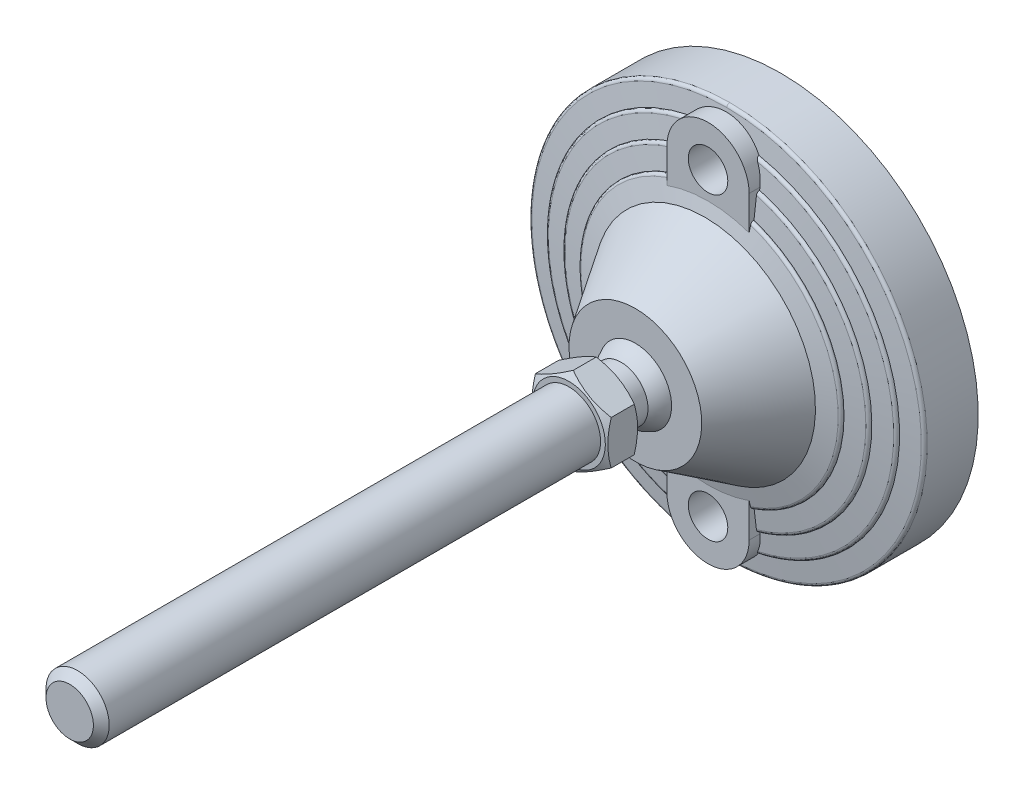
ISO-10303-21;
HEADER;
FILE_DESCRIPTION(('STEP AP214'),'2;1');
FILE_NAME('part.step','',(''),(''),'','','');
FILE_SCHEMA(('AUTOMOTIVE_DESIGN { 1 0 10303 214 1 1 1 1 }'));
ENDSEC;
DATA;
#1=APPLICATION_CONTEXT('core data for automotive mechanical design processes');
#2=APPLICATION_PROTOCOL_DEFINITION('international standard','automotive_design',2000,#1);
#3=PRODUCT_CONTEXT('',#1,'mechanical');
#4=PRODUCT('Part','Part','',(#3));
#5=PRODUCT_RELATED_PRODUCT_CATEGORY('part','',(#4));
#6=PRODUCT_DEFINITION_FORMATION('','',#4);
#7=PRODUCT_DEFINITION_CONTEXT('part definition',#1,'design');
#8=PRODUCT_DEFINITION('design','',#6,#7);
#9=PRODUCT_DEFINITION_SHAPE('','',#8);
#10=(LENGTH_UNIT() NAMED_UNIT(*) SI_UNIT(.MILLI.,.METRE.));
#11=(NAMED_UNIT(*) PLANE_ANGLE_UNIT() SI_UNIT($,.RADIAN.));
#12=(NAMED_UNIT(*) SI_UNIT($,.STERADIAN.) SOLID_ANGLE_UNIT());
#13=UNCERTAINTY_MEASURE_WITH_UNIT(LENGTH_MEASURE(1.E-05),#10,'distance_accuracy_value','');
#14=(GEOMETRIC_REPRESENTATION_CONTEXT(3) GLOBAL_UNCERTAINTY_ASSIGNED_CONTEXT((#13)) GLOBAL_UNIT_ASSIGNED_CONTEXT((#10,
#11,#12)) REPRESENTATION_CONTEXT('',''));
#15=CARTESIAN_POINT('',(0.,0.,0.));
#16=DIRECTION('',(0.,0.,1.));
#17=DIRECTION('',(1.,0.,0.));
#18=AXIS2_PLACEMENT_3D('',#15,#16,#17);
#19=CARTESIAN_POINT('',(-12.,14.022683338,57.));
#20=DIRECTION('',(0.,0.,1.));
#21=DIRECTION('',(0.,-1.,0.));
#22=AXIS2_PLACEMENT_3D('',#19,#20,#21);
#23=PLANE('',#22);
#24=CARTESIAN_POINT('',(0.,0.,57.));
#25=DIRECTION('',(0.,0.,-1.));
#26=DIRECTION('',(0.,1.,0.));
#27=AXIS2_PLACEMENT_3D('',#24,#25,#26);
#28=CIRCLE('',#27,11.5);
#29=CARTESIAN_POINT('',(0.,11.5,57.));
#30=VERTEX_POINT('',#29);
#31=EDGE_CURVE('E212',#30,#30,#28,.T.);
#32=ORIENTED_EDGE('',*,*,#31,.T.);
#33=EDGE_LOOP('',(#32));
#34=FACE_BOUND('',#33,.T.);
#35=CARTESIAN_POINT('',(0.,0.,57.));
#36=DIRECTION('',(0.,0.,-1.));
#37=DIRECTION('',(1.,0.,0.));
#38=AXIS2_PLACEMENT_3D('',#35,#36,#37);
#39=CIRCLE('',#38,8.5);
#40=CARTESIAN_POINT('',(8.49999999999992,0.,57.));
#41=VERTEX_POINT('',#40);
#42=EDGE_CURVE('E226',#41,#41,#39,.T.);
#43=ORIENTED_EDGE('',*,*,#42,.F.);
#44=EDGE_LOOP('',(#43));
#45=FACE_BOUND('',#44,.T.);
#46=ADVANCED_FACE('F14',(#34,#45),#23,.F.);
#47=CARTESIAN_POINT('',(0.,0.,57.));
#48=DIRECTION('',(0.,0.,-1.));
#49=DIRECTION('',(1.,0.,0.));
#50=AXIS2_PLACEMENT_3D('',#47,#48,#49);
#51=CYLINDRICAL_SURFACE('',#50,8.5);
#52=CARTESIAN_POINT('',(0.,0.,50.5));
#53=DIRECTION('',(0.,0.,-1.));
#54=DIRECTION('',(1.,0.,0.));
#55=AXIS2_PLACEMENT_3D('',#52,#53,#54);
#56=CIRCLE('',#55,8.5);
#57=CARTESIAN_POINT('',(8.49999999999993,0.,50.5));
#58=VERTEX_POINT('',#57);
#59=EDGE_CURVE('E1294',#58,#58,#56,.F.);
#60=ORIENTED_EDGE('',*,*,#59,.T.);
#61=EDGE_LOOP('',(#60));
#62=FACE_BOUND('',#61,.T.);
#63=ORIENTED_EDGE('',*,*,#42,.T.);
#64=EDGE_LOOP('',(#63));
#65=FACE_BOUND('',#64,.T.);
#66=ADVANCED_FACE('F1026',(#62,#65),#51,.T.);
#67=CARTESIAN_POINT('',(-8.63159921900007,8.622532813,50.5));
#68=DIRECTION('',(0.,0.,1.));
#69=DIRECTION('',(0.,-1.,0.));
#70=AXIS2_PLACEMENT_3D('',#67,#68,#69);
#71=PLANE('',#70);
#72=CARTESIAN_POINT('',(0.,0.,50.5));
#73=DIRECTION('',(0.,0.,-1.));
#74=DIRECTION('',(0.,1.,0.));
#75=AXIS2_PLACEMENT_3D('',#72,#73,#74);
#76=CIRCLE('',#75,8.49107182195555);
#77=CARTESIAN_POINT('',(0.,8.49107182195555,50.5));
#78=VERTEX_POINT('',#77);
#79=EDGE_CURVE('E1296',#78,#78,#76,.T.);
#80=ORIENTED_EDGE('',*,*,#79,.F.);
#81=EDGE_LOOP('',(#80));
#82=FACE_BOUND('',#81,.T.);
#83=ORIENTED_EDGE('',*,*,#59,.F.);
#84=EDGE_LOOP('',(#83));
#85=FACE_BOUND('',#84,.T.);
#86=ADVANCED_FACE('F1017',(#82,#85),#71,.F.);
#87=CARTESIAN_POINT('',(0.,0.,41.670266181));
#88=DIRECTION('',(0.,0.,-1.));
#89=DIRECTION('',(1.,0.,0.));
#90=AXIS2_PLACEMENT_3D('',#87,#88,#89);
#91=SPHERICAL_SURFACE('',#90,12.25);
#92=CARTESIAN_POINT('',(0.,0.,46.));
#93=DIRECTION('',(0.,0.,-1.));
#94=DIRECTION('',(0.,1.,0.));
#95=AXIS2_PLACEMENT_3D('',#92,#93,#94);
#96=CIRCLE('',#95,11.4593152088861);
#97=CARTESIAN_POINT('',(0.,11.4593152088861,46.));
#98=VERTEX_POINT('',#97);
#99=EDGE_CURVE('E1299',#98,#98,#96,.F.);
#100=ORIENTED_EDGE('',*,*,#99,.T.);
#101=EDGE_LOOP('',(#100));
#102=FACE_BOUND('',#101,.T.);
#103=ORIENTED_EDGE('',*,*,#79,.T.);
#104=EDGE_LOOP('',(#103));
#105=FACE_BOUND('',#104,.T.);
#106=ADVANCED_FACE('F1009',(#102,#105),#91,.T.);
#107=CARTESIAN_POINT('',(-21.325127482,-21.252,46.));
#108=DIRECTION('',(0.,0.,-1.));
#109=DIRECTION('',(0.,1.,0.));
#110=AXIS2_PLACEMENT_3D('',#107,#108,#109);
#111=PLANE('',#110);
#112=ORIENTED_EDGE('',*,*,#99,.F.);
#113=EDGE_LOOP('',(#112));
#114=FACE_BOUND('',#113,.T.);
#115=CARTESIAN_POINT('',(0.,0.,46.));
#116=DIRECTION('',(0.,0.,-1.));
#117=DIRECTION('',(0.,1.,0.));
#118=AXIS2_PLACEMENT_3D('',#115,#116,#117);
#119=CIRCLE('',#118,21.);
#120=CARTESIAN_POINT('',(0.,21.,46.));
#121=VERTEX_POINT('',#120);
#122=EDGE_CURVE('E721',#121,#121,#119,.T.);
#123=ORIENTED_EDGE('',*,*,#122,.F.);
#124=EDGE_LOOP('',(#123));
#125=FACE_BOUND('',#124,.T.);
#126=ADVANCED_FACE('F1000',(#114,#125),#111,.F.);
#127=CARTESIAN_POINT('',(0.,-47.5,0.));
#128=DIRECTION('',(0.,0.,1.));
#129=DIRECTION('',(0.,-1.,0.));
#130=AXIS2_PLACEMENT_3D('',#127,#128,#129);
#131=CYLINDRICAL_SURFACE('',#130,6.25);
#132=CARTESIAN_POINT('',(0.,-47.5,0.));
#133=DIRECTION('',(0.,0.,1.));
#134=DIRECTION('',(0.,-1.,0.));
#135=AXIS2_PLACEMENT_3D('',#132,#133,#134);
#136=CIRCLE('',#135,6.25);
#137=CARTESIAN_POINT('',(0.,-53.75,0.));
#138=VERTEX_POINT('',#137);
#139=EDGE_CURVE('E451',#138,#138,#136,.F.);
#140=ORIENTED_EDGE('',*,*,#139,.T.);
#141=EDGE_LOOP('',(#140));
#142=FACE_BOUND('',#141,.T.);
#143=CARTESIAN_POINT('',(0.,-47.5,23.));
#144=DIRECTION('',(0.,0.,1.));
#145=DIRECTION('',(0.,-1.,0.));
#146=AXIS2_PLACEMENT_3D('',#143,#144,#145);
#147=CIRCLE('',#146,6.25);
#148=CARTESIAN_POINT('',(0.,-53.75,23.));
#149=VERTEX_POINT('',#148);
#150=EDGE_CURVE('E720',#149,#149,#147,.T.);
#151=ORIENTED_EDGE('',*,*,#150,.T.);
#152=EDGE_LOOP('',(#151));
#153=FACE_BOUND('',#152,.T.);
#154=ADVANCED_FACE('F992',(#142,#153),#131,.F.);
#155=CARTESIAN_POINT('',(-63.467641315,63.25,0.));
#156=DIRECTION('',(0.,0.,1.));
#157=DIRECTION('',(0.,-1.,0.));
#158=AXIS2_PLACEMENT_3D('',#155,#156,#157);
#159=PLANE('',#158);
#160=ORIENTED_EDGE('',*,*,#139,.F.);
#161=EDGE_LOOP('',(#160));
#162=FACE_BOUND('',#161,.T.);
#163=CARTESIAN_POINT('',(0.,47.5,0.));
#164=DIRECTION('',(0.,0.,1.));
#165=DIRECTION('',(0.,-1.,0.));
#166=AXIS2_PLACEMENT_3D('',#163,#164,#165);
#167=CIRCLE('',#166,6.25);
#168=CARTESIAN_POINT('',(0.,41.25,0.));
#169=VERTEX_POINT('',#168);
#170=EDGE_CURVE('E239',#169,#169,#167,.T.);
#171=ORIENTED_EDGE('',*,*,#170,.T.);
#172=EDGE_LOOP('',(#171));
#173=FACE_BOUND('',#172,.T.);
#174=CARTESIAN_POINT('',(0.,0.,0.));
#175=DIRECTION('',(0.,0.,-1.));
#176=DIRECTION('',(0.,1.,0.));
#177=AXIS2_PLACEMENT_3D('',#174,#175,#176);
#178=CIRCLE('',#177,62.5);
#179=CARTESIAN_POINT('',(0.,62.5,0.));
#180=VERTEX_POINT('',#179);
#181=EDGE_CURVE('E414',#180,#180,#178,.F.);
#182=ORIENTED_EDGE('',*,*,#181,.F.);
#183=EDGE_LOOP('',(#182));
#184=FACE_BOUND('',#183,.T.);
#185=ADVANCED_FACE('F335',(#162,#173,#184),#159,.F.);
#186=CARTESIAN_POINT('',(12.406354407,39.602176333,21.568111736));
#187=CARTESIAN_POINT('',(59.707464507,24.78394183,21.5681117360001));
#188=CARTESIAN_POINT('',(59.707464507,-24.78394183,21.5681117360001));
#189=CARTESIAN_POINT('',(12.406354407,-39.602176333,21.568111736));
#190=CARTESIAN_POINT('',(12.4063544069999,39.602176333,22.044046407));
#191=CARTESIAN_POINT('',(59.707464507,24.78394183,22.0440464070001));
#192=CARTESIAN_POINT('',(59.707464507,-24.78394183,22.0440464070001));
#193=CARTESIAN_POINT('',(12.4063544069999,-39.602176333,22.044046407));
#194=CARTESIAN_POINT('',(12.31903347,39.323440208,22.419805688));
#195=CARTESIAN_POINT('',(59.287219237,24.609502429,22.4198056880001));
#196=CARTESIAN_POINT('',(59.287219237,-24.609502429,22.4198056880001));
#197=CARTESIAN_POINT('',(12.31903347,-39.323440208,22.419805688));
#198=CARTESIAN_POINT('',(12.18115046,38.883305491,22.53720891));
#199=CARTESIAN_POINT('',(58.623636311,24.334056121,22.5372089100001));
#200=CARTESIAN_POINT('',(58.623636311,-24.334056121,22.5372089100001));
#201=CARTESIAN_POINT('',(12.18115046,-38.883305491,22.53720891));
#202=(BOUNDED_SURFACE() B_SPLINE_SURFACE(3,3,((#186,#187,#188,#189),(#190,#191,#192,#193),(#194,
#195,#196,#197),(#198,#199,#200,#201)),.UNSPECIFIED.,.F.,.F.,
.F.) B_SPLINE_SURFACE_WITH_KNOTS((4,4),(4,4),(0.,1.),(0.,1.),
.UNSPECIFIED.) GEOMETRIC_REPRESENTATION_ITEM() RATIONAL_B_SPLINE_SURFACE(((1.,0.532632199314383,
0.532632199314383,1.),(0.859679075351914,0.457892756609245,0.457892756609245,0.859679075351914),
(0.859679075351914,0.457892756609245,0.457892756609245,0.859679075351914),(1.,0.532632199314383,
0.532632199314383,1.))) REPRESENTATION_ITEM('') SURFACE());
#203=CARTESIAN_POINT('',(0.,0.,22.53720891));
#204=DIRECTION('',(0.,0.,-1.));
#205=DIRECTION('',(0.,1.,0.));
#206=AXIS2_PLACEMENT_3D('',#203,#204,#205);
#207=CIRCLE('',#206,40.746679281);
#208=CARTESIAN_POINT('',(13.,-38.6172483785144,22.537208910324));
#209=VERTEX_POINT('',#208);
#210=CARTESIAN_POINT('',(13.,38.6172483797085,22.5372089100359));
#211=VERTEX_POINT('',#210);
#212=EDGE_CURVE('E452',#209,#211,#207,.F.);
#213=CARTESIAN_POINT('',(13.,-39.4112927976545,21.5681117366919));
#214=CARTESIAN_POINT('',(13.,-39.4112933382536,21.59521048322));
#215=CARTESIAN_POINT('',(13.,-39.4101321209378,21.6222958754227));
#216=CARTESIAN_POINT('',(13.,-39.405504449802,21.6762650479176));
#217=CARTESIAN_POINT('',(13.,-39.4020383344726,21.7031488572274));
#218=CARTESIAN_POINT('',(13.,-39.3882336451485,21.7831079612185));
#219=CARTESIAN_POINT('',(13.,-39.3744885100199,21.8356344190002));
#220=CARTESIAN_POINT('',(13.,-39.3384084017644,21.937608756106));
#221=CARTESIAN_POINT('',(13.,-39.3160736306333,21.987056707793));
#222=CARTESIAN_POINT('',(13.,-39.2635909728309,22.0816017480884));
#223=CARTESIAN_POINT('',(13.,-39.233444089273,22.1266993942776));
#224=CARTESIAN_POINT('',(13.,-39.1656058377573,22.2123360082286));
#225=CARTESIAN_POINT('',(13.,-39.1277714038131,22.2527614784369));
#226=CARTESIAN_POINT('',(13.,-39.0461074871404,22.327071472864));
#227=CARTESIAN_POINT('',(13.,-39.0022718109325,22.3609491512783));
#228=CARTESIAN_POINT('',(13.,-38.9043172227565,22.4250520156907));
#229=CARTESIAN_POINT('',(13.,-38.8495953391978,22.4543647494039));
#230=CARTESIAN_POINT('',(13.,-38.7644641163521,22.4909906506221));
#231=CARTESIAN_POINT('',(13.,-38.7355751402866,22.5019763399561));
#232=CARTESIAN_POINT('',(13.,-38.6769796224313,22.5214626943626));
#233=CARTESIAN_POINT('',(13.,-38.6472733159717,22.5299640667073));
#234=CARTESIAN_POINT('',(13.,-38.6172483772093,22.5372089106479));
#235=B_SPLINE_CURVE_WITH_KNOTS('',3,(#213,#214,#215,#216,#217,#218,#219,#220,#221,#222,#223,
#224,#225,#226,#227,#228,#229,#230,#231,#232,#233,#234),.UNSPECIFIED.,.F.,.F.,(4,2,2,2,2,2,2,2,
2,2,4),(0.,0.081245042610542,0.162478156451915,0.324519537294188,0.486557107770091,
0.648573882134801,0.813939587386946,0.979477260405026,1.16468654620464,1.25731455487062,
1.34991616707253),.UNSPECIFIED.);
#236=CARTESIAN_POINT('',(13.,-39.4112927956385,21.568111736));
#237=VERTEX_POINT('',#236);
#238=EDGE_CURVE('E321',#237,#209,#235,.T.);
#239=CARTESIAN_POINT('',(0.,0.,21.568111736));
#240=DIRECTION('',(0.,0.,-1.));
#241=DIRECTION('',(0.,1.,0.));
#242=AXIS2_PLACEMENT_3D('',#239,#240,#241);
#243=CIRCLE('',#242,41.5);
#244=CARTESIAN_POINT('',(13.,39.4112927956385,21.5681117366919));
#245=VERTEX_POINT('',#244);
#246=EDGE_CURVE('E449',#245,#237,#243,.T.);
#247=CARTESIAN_POINT('',(13.,38.6172483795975,22.5372089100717));
#248=CARTESIAN_POINT('',(13.,38.6757273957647,22.5231434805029));
#249=CARTESIAN_POINT('',(13.,38.7330575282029,22.5042077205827));
#250=CARTESIAN_POINT('',(13.,38.843898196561,22.4570874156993));
#251=CARTESIAN_POINT('',(13.,38.8974017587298,22.4288864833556));
#252=CARTESIAN_POINT('',(13.,38.9989209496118,22.3637346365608));
#253=CARTESIAN_POINT('',(13.,39.0469285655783,22.3267711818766));
#254=CARTESIAN_POINT('',(13.,39.1357078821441,22.2450475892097));
#255=CARTESIAN_POINT('',(13.,39.1764870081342,22.2002955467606));
#256=CARTESIAN_POINT('',(13.,39.2479885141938,22.1059931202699));
#257=CARTESIAN_POINT('',(13.,39.2790300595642,22.0566848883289));
#258=CARTESIAN_POINT('',(13.,39.3318958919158,21.9533393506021));
#259=CARTESIAN_POINT('',(13.,39.3537228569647,21.8993034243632));
#260=CARTESIAN_POINT('',(13.,39.3839717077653,21.7991363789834));
#261=CARTESIAN_POINT('',(13.,39.3941848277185,21.7535382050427));
#262=CARTESIAN_POINT('',(13.,39.4078594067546,21.6613400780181));
#263=CARTESIAN_POINT('',(13.,39.4113205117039,21.6147400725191));
#264=CARTESIAN_POINT('',(13.,39.4112927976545,21.5681117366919));
#265=B_SPLINE_CURVE_WITH_KNOTS('',3,(#247,#248,#249,#250,#251,#252,#253,#254,#255,#256,#257,
#258,#259,#260,#261,#262,#263,#264),.UNSPECIFIED.,.F.,.F.,(4,2,2,2,2,2,2,2,4),(0.,
0.180276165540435,0.360872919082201,0.54172970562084,0.722399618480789,0.896310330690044,
1.07017046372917,1.20986980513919,1.34957647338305),.UNSPECIFIED.);
#266=EDGE_CURVE('E238',#211,#245,#265,.T.);
#267=ORIENTED_EDGE('',*,*,#212,.F.);
#268=ORIENTED_EDGE('',*,*,#238,.F.);
#269=ORIENTED_EDGE('',*,*,#246,.F.);
#270=ORIENTED_EDGE('',*,*,#266,.F.);
#271=EDGE_LOOP('',(#267,#268,#269,#270));
#272=FACE_BOUND('',#271,.T.);
#273=ADVANCED_FACE('F919',(#272),#202,.T.);
#274=CARTESIAN_POINT('',(0.,0.,21.568111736));
#275=DIRECTION('',(0.,0.,-1.));
#276=DIRECTION('',(0.,1.,0.));
#277=AXIS2_PLACEMENT_3D('',#274,#275,#276);
#278=CYLINDRICAL_SURFACE('',#277,41.5);
#279=CARTESIAN_POINT('',(0.,0.,21.4545454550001));
#280=DIRECTION('',(0.,0.,-1.));
#281=DIRECTION('',(0.,1.,0.));
#282=AXIS2_PLACEMENT_3D('',#279,#280,#281);
#283=CIRCLE('',#282,41.5);
#284=CARTESIAN_POINT('',(13.,39.4112927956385,21.4545454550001));
#285=VERTEX_POINT('',#284);
#286=CARTESIAN_POINT('',(13.,-39.4112927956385,21.4545454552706));
#287=VERTEX_POINT('',#286);
#288=EDGE_CURVE('E447',#285,#287,#283,.T.);
#289=ORIENTED_EDGE('',*,*,#288,.F.);
#290=DIRECTION('',(0.,0.,-1.));
#291=VECTOR('',#290,1.);
#292=CARTESIAN_POINT('',(13.,39.4112927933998,21.2785712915));
#293=LINE('',#292,#291);
#294=EDGE_CURVE('E291',#245,#285,#293,.T.);
#295=ORIENTED_EDGE('',*,*,#294,.F.);
#296=ORIENTED_EDGE('',*,*,#246,.T.);
#297=DIRECTION('',(0.,0.,1.));
#298=VECTOR('',#297,1.);
#299=CARTESIAN_POINT('',(13.,-39.4112927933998,21.2785712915));
#300=LINE('',#299,#298);
#301=EDGE_CURVE('E319',#287,#237,#300,.T.);
#302=ORIENTED_EDGE('',*,*,#301,.F.);
#303=EDGE_LOOP('',(#289,#295,#296,#302));
#304=FACE_BOUND('',#303,.T.);
#305=ADVANCED_FACE('F303',(#304),#278,.T.);
#306=CARTESIAN_POINT('',(0.,0.,21.454545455));
#307=DIRECTION('',(0.,0.,-1.));
#308=DIRECTION('',(0.,1.,0.));
#309=AXIS2_PLACEMENT_3D('',#306,#307,#308);
#310=CONICAL_SURFACE('',#309,41.5,1.4442041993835);
#311=ORIENTED_EDGE('',*,*,#288,.T.);
#312=CARTESIAN_POINT('',(13.0000000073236,-45.8176832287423,20.674840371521));
#313=CARTESIAN_POINT('',(13.0000000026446,-45.2838642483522,20.7402005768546));
#314=CARTESIAN_POINT('',(13.000000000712,-44.7500350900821,20.8054777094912));
#315=CARTESIAN_POINT('',(12.999999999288,-43.6823542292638,20.935846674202));
#316=CARTESIAN_POINT('',(12.9999999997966,-43.1485025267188,21.0009385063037));
#317=CARTESIAN_POINT('',(13.0000000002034,-42.0807742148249,21.1309177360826));
#318=CARTESIAN_POINT('',(13.0000000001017,-41.5468976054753,21.195805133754));
#319=CARTESIAN_POINT('',(12.9999999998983,-40.4791166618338,21.3253520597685));
#320=CARTESIAN_POINT('',(12.9999999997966,-39.9452123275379,21.3900115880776));
#321=CARTESIAN_POINT('',(13.,-39.4112927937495,21.4545454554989));
#322=B_SPLINE_CURVE_WITH_KNOTS('',3,(#312,#313,#314,#315,#316,#317,#318,#319,#320,#321),
.UNSPECIFIED.,.F.,.F.,(4,2,2,2,4),(0.,1.61341623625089,3.22683223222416,4.84024827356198,
6.45366455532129),.UNSPECIFIED.);
#323=CARTESIAN_POINT('',(13.,-45.8176832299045,20.6748403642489));
#324=VERTEX_POINT('',#323);
#325=EDGE_CURVE('E311',#324,#287,#322,.T.);
#326=ORIENTED_EDGE('',*,*,#325,.F.);
#327=CARTESIAN_POINT('',(-7.48587025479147E-10,0.,20.674840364));
#328=DIRECTION('',(0.,0.,-1.));
#329=DIRECTION('',(0.,1.,0.));
#330=AXIS2_PLACEMENT_3D('',#327,#328,#329);
#331=CIRCLE('',#330,47.6262542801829);
#332=CARTESIAN_POINT('',(13.,45.8176832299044,20.6748403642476));
#333=VERTEX_POINT('',#332);
#334=EDGE_CURVE('E412',#333,#324,#331,.T.);
#335=ORIENTED_EDGE('',*,*,#334,.F.);
#336=CARTESIAN_POINT('',(13.,39.4112927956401,21.4545454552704));
#337=CARTESIAN_POINT('',(13.,39.9452123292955,21.3900115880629));
#338=CARTESIAN_POINT('',(13.,40.4791166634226,21.3253520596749));
#339=CARTESIAN_POINT('',(13.,41.5468976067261,21.195805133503));
#340=CARTESIAN_POINT('',(13.,42.0807742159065,21.1309177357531));
#341=CARTESIAN_POINT('',(13.,43.1485025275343,21.0009385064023));
#342=CARTESIAN_POINT('',(13.,43.6823542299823,20.9358466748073));
#343=CARTESIAN_POINT('',(13.,44.7500350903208,20.805477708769));
#344=CARTESIAN_POINT('',(13.,45.283864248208,20.7402005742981));
#345=CARTESIAN_POINT('',(13.,45.8176832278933,20.6748403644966));
#346=B_SPLINE_CURVE_WITH_KNOTS('',3,(#336,#337,#338,#339,#340,#341,#342,#343,#344,#345),
.UNSPECIFIED.,.F.,.F.,(4,2,2,2,4),(0.,1.61341628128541,3.22683232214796,4.84024831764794,
6.45366455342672),.UNSPECIFIED.);
#347=EDGE_CURVE('E283',#285,#333,#346,.T.);
#348=ORIENTED_EDGE('',*,*,#347,.F.);
#349=EDGE_LOOP('',(#311,#326,#335,#348));
#350=FACE_BOUND('',#349,.T.);
#351=ADVANCED_FACE('F298',(#350),#310,.T.);
#352=CARTESIAN_POINT('',(12.269850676,46.922284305,19.669623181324));
#353=CARTESIAN_POINT('',(72.5576318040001,31.157449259,19.669623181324));
#354=CARTESIAN_POINT('',(72.5576318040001,-31.157449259,19.669623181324));
#355=CARTESIAN_POINT('',(12.269850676,-46.922284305,19.669623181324));
#356=CARTESIAN_POINT('',(12.269850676,46.922284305,19.6740296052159));
#357=CARTESIAN_POINT('',(72.5576318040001,31.157449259,19.6740296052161));
#358=CARTESIAN_POINT('',(72.5576318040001,-31.157449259,19.6740296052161));
#359=CARTESIAN_POINT('',(12.269850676,-46.922284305,19.6740296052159));
#360=CARTESIAN_POINT('',(12.269850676,46.922284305,19.678436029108));
#361=CARTESIAN_POINT('',(72.5576318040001,31.157449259,19.6784360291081));
#362=CARTESIAN_POINT('',(72.5576318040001,-31.157449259,19.6784360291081));
#363=CARTESIAN_POINT('',(12.269850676,-46.922284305,19.678436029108));
#364=CARTESIAN_POINT('',(12.269850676,46.922284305,19.682842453));
#365=CARTESIAN_POINT('',(72.5576318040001,31.157449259,19.6828424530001));
#366=CARTESIAN_POINT('',(72.5576318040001,-31.157449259,19.6828424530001));
#367=CARTESIAN_POINT('',(12.269850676,-46.922284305,19.682842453));
#368=CARTESIAN_POINT('',(12.269850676,46.922284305,20.211436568));
#369=CARTESIAN_POINT('',(72.557631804,31.157449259,20.2114365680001));
#370=CARTESIAN_POINT('',(72.557631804,-31.157449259,20.2114365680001));
#371=CARTESIAN_POINT('',(12.269850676,-46.922284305,20.211436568));
#372=CARTESIAN_POINT('',(12.181461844,46.584268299,20.608103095));
#373=CARTESIAN_POINT('',(72.034945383,30.93299905,20.6081030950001));
#374=CARTESIAN_POINT('',(72.034945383,-30.93299905,20.6081030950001));
#375=CARTESIAN_POINT('',(12.181461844,-46.584268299,20.608103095));
#376=CARTESIAN_POINT('',(12.048804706,46.076961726,20.674840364));
#377=CARTESIAN_POINT('',(71.250478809,30.596136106,20.6748403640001));
#378=CARTESIAN_POINT('',(71.250478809,-30.596136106,20.6748403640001));
#379=CARTESIAN_POINT('',(12.048804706,-46.076961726,20.674840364));
#380=(BOUNDED_SURFACE() B_SPLINE_SURFACE(3,3,((#352,#353,#354,#355),(#356,#357,#358,#359),(#360,
#361,#362,#363),(#364,#365,#366,#367),(#368,#369,#370,#371),(#372,#373,#374,#375),(#376,#377,
#378,#379)),.UNSPECIFIED.,.F.,.F.,.F.) B_SPLINE_SURFACE_WITH_KNOTS((4,3,4),(4,4),(-0.01,0.,1.),
(0.,1.),.UNSPECIFIED.) GEOMETRIC_REPRESENTATION_ITEM() RATIONAL_B_SPLINE_SURFACE(((1.,
0.501991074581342,0.501991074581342,1.),(1.,0.501991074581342,0.501991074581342,1.),(1.,
0.501991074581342,0.501991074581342,1.),(1.,0.501991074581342,0.501991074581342,1.),
(0.833611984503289,0.418465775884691,0.418465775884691,0.833611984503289),(0.833611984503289,
0.418465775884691,0.418465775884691,0.833611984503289),(1.,0.501991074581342,0.501991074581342,1.))) REPRESENTATION_ITEM('') SURFACE());
#381=CARTESIAN_POINT('',(13.,-46.7252608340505,19.6777848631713));
#382=CARTESIAN_POINT('',(13.,-46.7253979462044,19.7054287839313));
#383=CARTESIAN_POINT('',(13.,-46.7243484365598,19.7330653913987));
#384=CARTESIAN_POINT('',(13.,-46.7198870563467,19.7881439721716));
#385=CARTESIAN_POINT('',(13.,-46.7164754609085,19.815585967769));
#386=CARTESIAN_POINT('',(13.,-46.7027375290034,19.8972169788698));
#387=CARTESIAN_POINT('',(13.,-46.6889086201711,19.9508576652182));
#388=CARTESIAN_POINT('',(13.,-46.6523707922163,20.0550506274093));
#389=CARTESIAN_POINT('',(13.,-46.6296523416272,20.1055995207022));
#390=CARTESIAN_POINT('',(13.,-46.5760978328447,20.2021956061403));
#391=CARTESIAN_POINT('',(13.,-46.5452617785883,20.2482428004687));
#392=CARTESIAN_POINT('',(13.,-46.4762858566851,20.3348542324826));
#393=CARTESIAN_POINT('',(13.,-46.4381108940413,20.3753904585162));
#394=CARTESIAN_POINT('',(13.,-46.3556866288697,20.4497572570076));
#395=CARTESIAN_POINT('',(13.,-46.311434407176,20.4835845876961));
#396=CARTESIAN_POINT('',(13.,-46.2164675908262,20.5448274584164));
#397=CARTESIAN_POINT('',(13.,-46.1655796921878,20.5719736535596));
#398=CARTESIAN_POINT('',(13.,-46.0601083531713,20.6176355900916));
#399=CARTESIAN_POINT('',(13.,-46.005528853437,20.6361603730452));
#400=CARTESIAN_POINT('',(13.,-45.9281089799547,20.6556819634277));
#401=CARTESIAN_POINT('',(13.,-45.9061721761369,20.6604842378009));
#402=CARTESIAN_POINT('',(13.,-45.8620822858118,20.6686997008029));
#403=CARTESIAN_POINT('',(13.,-45.8399296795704,20.6721154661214));
#404=CARTESIAN_POINT('',(13.,-45.817683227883,20.6748403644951));
#405=B_SPLINE_CURVE_WITH_KNOTS('',3,(#381,#382,#383,#384,#385,#386,#387,#388,#389,#390,#391,
#392,#393,#394,#395,#396,#397,#398,#399,#400,#401,#402,#403,#404),.UNSPECIFIED.,.F.,.F.,(4,2,2,
2,2,2,2,2,2,2,2,4),(0.,0.0828810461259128,0.165752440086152,0.331061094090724,0.496547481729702,
0.662033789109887,0.828332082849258,0.994710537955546,1.16697834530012,1.33906508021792,
1.40639957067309,1.47360834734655),.UNSPECIFIED.);
#406=CARTESIAN_POINT('',(13.0000000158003,-46.7252608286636,19.6777848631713));
#407=VERTEX_POINT('',#406);
#408=EDGE_CURVE('E320',#407,#324,#405,.T.);
#409=CARTESIAN_POINT('',(13.0000000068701,46.7252608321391,19.6727272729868));
#410=CARTESIAN_POINT('',(13.3212147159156,46.635891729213,19.6727272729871));
#411=CARTESIAN_POINT('',(13.6414983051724,46.5432129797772,19.6727272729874));
#412=CARTESIAN_POINT('',(14.2801231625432,46.3512597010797,19.672727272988));
#413=CARTESIAN_POINT('',(14.59846420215,46.2519844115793,19.6727272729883));
#414=CARTESIAN_POINT('',(15.5526106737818,45.9435979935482,19.6727272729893));
#415=CARTESIAN_POINT('',(16.1852411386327,45.724565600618,19.6727272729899));
#416=CARTESIAN_POINT('',(17.4409289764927,45.2604918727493,19.6727272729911));
#417=CARTESIAN_POINT('',(18.0639854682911,45.0154481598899,19.6727272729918));
#418=CARTESIAN_POINT('',(19.3000708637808,44.4995075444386,19.672727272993));
#419=CARTESIAN_POINT('',(19.913088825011,44.2285843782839,19.6727272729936));
#420=CARTESIAN_POINT('',(21.1274202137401,43.6615551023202,19.6727272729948));
#421=CARTESIAN_POINT('',(21.7287319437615,43.3654453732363,19.6727272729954));
#422=CARTESIAN_POINT('',(23.5288179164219,42.4321391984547,19.6727272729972));
#423=CARTESIAN_POINT('',(24.7079785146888,41.7565378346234,19.6727272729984));
#424=CARTESIAN_POINT('',(27.0057517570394,40.3086198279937,19.6727272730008));
#425=CARTESIAN_POINT('',(28.1243409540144,39.5362661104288,19.672727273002));
#426=CARTESIAN_POINT('',(30.2940548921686,37.8994558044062,19.6727272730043));
#427=CARTESIAN_POINT('',(31.3451007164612,37.0348945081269,19.6727272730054));
#428=CARTESIAN_POINT('',(33.3707378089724,35.2206260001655,19.6727272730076));
#429=CARTESIAN_POINT('',(34.3453363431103,34.2709268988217,19.6727272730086));
#430=CARTESIAN_POINT('',(36.2141318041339,32.2900336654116,19.6727272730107));
#431=CARTESIAN_POINT('',(37.1080775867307,31.2586025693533,19.6727272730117));
#432=CARTESIAN_POINT('',(38.8059105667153,29.1240638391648,19.6727272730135));
#433=CARTESIAN_POINT('',(39.609795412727,28.0209543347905,19.6727272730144));
#434=CARTESIAN_POINT('',(41.1215543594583,25.7512426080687,19.6727272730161));
#435=CARTESIAN_POINT('',(41.8294551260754,24.5846581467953,19.6727272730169));
#436=CARTESIAN_POINT('',(43.144473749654,22.196015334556,19.6727272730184));
#437=CARTESIAN_POINT('',(43.7515922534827,20.973957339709,19.6727272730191));
#438=CARTESIAN_POINT('',(44.8608053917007,18.482892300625,19.6727272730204));
#439=CARTESIAN_POINT('',(45.3628870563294,17.2138794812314,19.672727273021));
#440=CARTESIAN_POINT('',(46.2583633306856,14.6380667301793,19.672727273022));
#441=CARTESIAN_POINT('',(46.6517577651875,13.331266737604,19.6727272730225));
#442=CARTESIAN_POINT('',(47.3270705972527,10.6891374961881,19.6727272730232));
#443=CARTESIAN_POINT('',(47.6089860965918,9.3538075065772,19.6727272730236));
#444=CARTESIAN_POINT('',(48.0593220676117,6.6641453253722,19.6727272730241));
#445=CARTESIAN_POINT('',(48.2277425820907,5.30981314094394,19.6727272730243));
#446=CARTESIAN_POINT('',(48.4498861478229,2.59183878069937,19.6727272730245));
#447=CARTESIAN_POINT('',(48.5036145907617,1.22819704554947,19.6727272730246));
#448=CARTESIAN_POINT('',(48.4960080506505,-1.49876561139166,19.6727272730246));
#449=CARTESIAN_POINT('',(48.4346730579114,-2.86208653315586,19.6727272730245));
#450=CARTESIAN_POINT('',(48.1973677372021,-5.57880747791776,19.6727272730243));
#451=CARTESIAN_POINT('',(48.021389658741,-6.93220682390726,19.672727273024));
#452=CARTESIAN_POINT('',(47.5560413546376,-9.61936956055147,19.6727272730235));
#453=CARTESIAN_POINT('',(47.2666711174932,-10.9531329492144,19.6727272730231));
#454=CARTESIAN_POINT('',(46.5765756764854,-13.5916227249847,19.6727272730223));
#455=CARTESIAN_POINT('',(46.1758433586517,-14.8963472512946,19.6727272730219));
#456=CARTESIAN_POINT('',(45.2658742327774,-17.467402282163,19.6727272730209));
#457=CARTESIAN_POINT('',(44.7566374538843,-18.7337327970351,19.6727272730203));
#458=CARTESIAN_POINT('',(43.633416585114,-21.218718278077,19.672727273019));
#459=CARTESIAN_POINT('',(43.0194530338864,-22.4373825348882,19.6727272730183));
#460=CARTESIAN_POINT('',(41.6909757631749,-24.8187625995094,19.6727272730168));
#461=CARTESIAN_POINT('',(40.9764619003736,-25.9814783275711,19.6727272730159));
#462=CARTESIAN_POINT('',(39.7063025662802,-27.8655028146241,19.6727272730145));
#463=CARTESIAN_POINT('',(39.17707249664,-28.6047764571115,19.672727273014));
#464=CARTESIAN_POINT('',(38.077880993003,-30.0524665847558,19.6727272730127));
#465=CARTESIAN_POINT('',(37.5079195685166,-30.7608830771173,19.6727272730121));
#466=CARTESIAN_POINT('',(36.3291070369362,-32.1445499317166,19.6727272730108));
#467=CARTESIAN_POINT('',(35.7202564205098,-32.8198007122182,19.6727272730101));
#468=CARTESIAN_POINT('',(34.4653645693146,-34.1352484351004,19.6727272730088));
#469=CARTESIAN_POINT('',(33.8193109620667,-34.7754335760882,19.6727272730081));
#470=CARTESIAN_POINT('',(32.4922294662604,-36.0184899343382,19.6727272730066));
#471=CARTESIAN_POINT('',(31.8112009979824,-36.6213605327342,19.6727272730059));
#472=CARTESIAN_POINT('',(30.4163089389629,-37.7878929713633,19.6727272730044));
#473=CARTESIAN_POINT('',(29.7024437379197,-38.3515528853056,19.6727272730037));
#474=CARTESIAN_POINT('',(28.1769516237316,-39.4879139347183,19.6727272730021));
#475=CARTESIAN_POINT('',(27.3623770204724,-40.0566641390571,19.6727272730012));
#476=CARTESIAN_POINT('',(25.6997855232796,-41.1431320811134,19.6727272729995));
#477=CARTESIAN_POINT('',(24.8517655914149,-41.660845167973,19.6727272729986));
#478=CARTESIAN_POINT('',(23.1254909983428,-42.6432641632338,19.6727272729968));
#479=CARTESIAN_POINT('',(22.2472346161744,-43.1079670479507,19.6727272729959));
#480=CARTESIAN_POINT('',(20.4623876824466,-43.9832963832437,19.6727272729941));
#481=CARTESIAN_POINT('',(19.555753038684,-44.3938329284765,19.6727272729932));
#482=CARTESIAN_POINT('',(17.7189637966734,-45.1583612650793,19.6727272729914));
#483=CARTESIAN_POINT('',(16.7888095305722,-45.5123538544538,19.6727272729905));
#484=CARTESIAN_POINT('',(14.9085132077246,-46.1625049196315,19.6727272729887));
#485=CARTESIAN_POINT('',(13.9583713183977,-46.4586638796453,19.6727272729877));
#486=CARTESIAN_POINT('',(13.0000000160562,-46.7252608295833,19.6727272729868));
#487=B_SPLINE_CURVE_WITH_KNOTS('',3,(#409,#410,#411,#412,#413,#414,#415,#416,#417,#418,#419,
#420,#421,#422,#423,#424,#425,#426,#427,#428,#429,#430,#431,#432,#433,#434,#435,#436,#437,#438,
#439,#440,#441,#442,#443,#444,#445,#446,#447,#448,#449,#450,#451,#452,#453,#454,#455,#456,#457,
#458,#459,#460,#461,#462,#463,#464,#465,#466,#467,#468,#469,#470,#471,#472,#473,#474,#475,#476,
#477,#478,#479,#480,#481,#482,#483,#484,#485,#486),.UNSPECIFIED.,.F.,.F.,(4,2,2,2,2,2,2,2,2,2,2,
2,2,2,2,2,2,2,2,2,2,2,2,2,2,2,2,2,2,2,2,2,2,2,2,2,2,2,4),(0.,1.00020816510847,2.00053180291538,
4.00833027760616,6.01631246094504,8.02635452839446,10.0366859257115,14.1084282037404,
18.1817355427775,22.2597186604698,26.3373137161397,30.4271967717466,34.5171865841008,
38.6060377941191,42.6948627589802,46.7841923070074,50.8735284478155,54.9629708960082,
59.0524118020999,63.1416604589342,67.2309094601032,71.3204349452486,75.4099608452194,
79.4997480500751,83.5895341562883,87.6785191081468,91.76750988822,94.4937471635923,
97.2199838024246,99.9461860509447,102.673300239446,105.400459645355,108.127752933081,
111.106299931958,114.085118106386,117.064106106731,120.047978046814,123.031807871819,
126.015612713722),.UNSPECIFIED.);
#488=CARTESIAN_POINT('',(13.0000000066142,46.7252608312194,19.6777848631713));
#489=VERTEX_POINT('',#488);
#490=EDGE_CURVE('E396',#489,#407,#487,.T.);
#491=CARTESIAN_POINT('',(13.,45.8176832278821,20.6748403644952));
#492=CARTESIAN_POINT('',(13.,45.8768916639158,20.6676266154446));
#493=CARTESIAN_POINT('',(13.,45.9354849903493,20.655431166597));
#494=CARTESIAN_POINT('',(13.,46.0498761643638,20.6214764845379));
#495=CARTESIAN_POINT('',(13.,46.1056719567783,20.5997103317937));
#496=CARTESIAN_POINT('',(13.,46.2128716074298,20.5469963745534));
#497=CARTESIAN_POINT('',(13.,46.2642705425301,20.5160384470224));
#498=CARTESIAN_POINT('',(13.,46.336724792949,20.4633763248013));
#499=CARTESIAN_POINT('',(13.,46.3600988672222,20.4447881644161));
#500=CARTESIAN_POINT('',(13.,46.405165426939,20.405625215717));
#501=CARTESIAN_POINT('',(13.,46.4268560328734,20.3850482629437));
#502=CARTESIAN_POINT('',(13.,46.4880645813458,20.3216088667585));
#503=CARTESIAN_POINT('',(13.,46.5249454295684,20.2761439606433));
#504=CARTESIAN_POINT('',(13.,46.5901806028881,20.1794685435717));
#505=CARTESIAN_POINT('',(13.,46.6185381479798,20.1282602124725));
#506=CARTESIAN_POINT('',(13.,46.653488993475,20.049293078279));
#507=CARTESIAN_POINT('',(13.,46.6637514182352,20.0231112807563));
#508=CARTESIAN_POINT('',(13.,46.6819716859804,19.9699855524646));
#509=CARTESIAN_POINT('',(13.,46.6899313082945,19.9430422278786));
#510=CARTESIAN_POINT('',(13.,46.7102220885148,19.8614024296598));
#511=CARTESIAN_POINT('',(13.,46.7190275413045,19.8057552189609));
#512=CARTESIAN_POINT('',(13.,46.7237631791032,19.737878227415));
#513=CARTESIAN_POINT('',(13.,46.7243742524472,19.7258595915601));
#514=CARTESIAN_POINT('',(13.,46.7251497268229,19.7018236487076));
#515=CARTESIAN_POINT('',(13.,46.7253147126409,19.6898063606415));
#516=CARTESIAN_POINT('',(13.,46.7252608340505,19.6777848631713));
#517=B_SPLINE_CURVE_WITH_KNOTS('',3,(#491,#492,#493,#494,#495,#496,#497,#498,#499,#500,#501,
#502,#503,#504,#505,#506,#507,#508,#509,#510,#511,#512,#513,#514,#515,#516),.UNSPECIFIED.,.F.,
.F.,(4,2,2,2,2,2,2,2,2,2,2,2,4),(0.,0.178718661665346,0.357566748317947,0.536612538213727,
0.626107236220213,0.715700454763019,0.890396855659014,1.06502717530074,1.14929679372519,
1.23350112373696,1.40145319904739,1.43755286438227,1.4736051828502),.UNSPECIFIED.);
#518=EDGE_CURVE('E290',#333,#489,#517,.T.);
#519=ORIENTED_EDGE('',*,*,#334,.T.);
#520=ORIENTED_EDGE('',*,*,#408,.F.);
#521=ORIENTED_EDGE('',*,*,#490,.F.);
#522=ORIENTED_EDGE('',*,*,#518,.F.);
#523=EDGE_LOOP('',(#519,#520,#521,#522));
#524=FACE_BOUND('',#523,.T.);
#525=ADVANCED_FACE('F302',(#524),#380,.T.);
#526=CARTESIAN_POINT('',(0.,62.5,16.119206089));
#527=CARTESIAN_POINT('',(125.,62.5,16.1192060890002));
#528=CARTESIAN_POINT('',(125.,-62.5,16.1192060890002));
#529=CARTESIAN_POINT('',(0.,-62.5,16.119206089));
#530=CARTESIAN_POINT('',(0.,62.5000000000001,16.647800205));
#531=CARTESIAN_POINT('',(125.,62.5,16.6478002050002));
#532=CARTESIAN_POINT('',(125.,-62.5,16.6478002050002));
#533=CARTESIAN_POINT('',(0.,-62.5000000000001,16.647800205));
#534=CARTESIAN_POINT('',(0.,62.150618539,17.044466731));
#535=CARTESIAN_POINT('',(124.301237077,62.150618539,17.0444667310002));
#536=CARTESIAN_POINT('',(124.301237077,-62.150618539,17.0444667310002));
#537=CARTESIAN_POINT('',(0.,-62.150618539,17.044466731));
#538=CARTESIAN_POINT('',(0.,61.62625428,17.111204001));
#539=CARTESIAN_POINT('',(123.252508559,61.6262542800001,17.1112040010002));
#540=CARTESIAN_POINT('',(123.252508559,-61.6262542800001,17.1112040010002));
#541=CARTESIAN_POINT('',(0.,-61.62625428,17.111204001));
#542=(BOUNDED_SURFACE() B_SPLINE_SURFACE(3,3,((#526,#527,#528,#529),(#530,#531,#532,#533),(#534,
#535,#536,#537),(#538,#539,#540,#541)),.UNSPECIFIED.,.F.,.F.,
.F.) B_SPLINE_SURFACE_WITH_KNOTS((4,4),(4,4),(0.,1.),(0.,1.),
.UNSPECIFIED.) GEOMETRIC_REPRESENTATION_ITEM() RATIONAL_B_SPLINE_SURFACE(((1.,0.333333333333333,
0.333333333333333,1.),(0.833611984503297,0.277870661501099,0.277870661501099,0.833611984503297),
(0.833611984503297,0.277870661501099,0.277870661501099,0.833611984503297),(1.,0.333333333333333,
0.333333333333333,1.))) REPRESENTATION_ITEM('') SURFACE());
#543=CARTESIAN_POINT('',(0.,0.,16.119206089));
#544=DIRECTION('',(0.,0.,1.));
#545=DIRECTION('',(0.,-1.,0.));
#546=AXIS2_PLACEMENT_3D('',#543,#544,#545);
#547=CIRCLE('',#546,62.5);
#548=CARTESIAN_POINT('',(-9.61424558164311E-09,-62.5,16.119206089));
#549=VERTEX_POINT('',#548);
#550=CARTESIAN_POINT('',(-2.80607325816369E-09,62.5,16.119206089));
#551=VERTEX_POINT('',#550);
#552=EDGE_CURVE('E712',#549,#551,#547,.T.);
#553=CARTESIAN_POINT('',(0.,62.5,16.119206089));
#554=CARTESIAN_POINT('',(0.,62.5000000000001,16.647800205));
#555=CARTESIAN_POINT('',(0.,62.150618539,17.044466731));
#556=CARTESIAN_POINT('',(0.,61.62625428,17.111204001));
#557=(BOUNDED_CURVE() B_SPLINE_CURVE(3,(#553,#554,#555,#556),.UNSPECIFIED.,.F.,
.F.) B_SPLINE_CURVE_WITH_KNOTS((4,4),(0.,1.),
.UNSPECIFIED.) CURVE() GEOMETRIC_REPRESENTATION_ITEM() RATIONAL_B_SPLINE_CURVE((1.,
0.833611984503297,0.833611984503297,1.)) REPRESENTATION_ITEM(''));
#558=CARTESIAN_POINT('',(-8.30049121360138E-09,61.6262542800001,17.111204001));
#559=VERTEX_POINT('',#558);
#560=EDGE_CURVE('E433',#559,#551,#557,.F.);
#561=CARTESIAN_POINT('',(0.,0.,17.111204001));
#562=DIRECTION('',(0.,0.,-1.));
#563=DIRECTION('',(0.,1.,0.));
#564=AXIS2_PLACEMENT_3D('',#561,#562,#563);
#565=CIRCLE('',#564,61.62625428);
#566=CARTESIAN_POINT('',(-1.57997187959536E-08,-61.62625428,17.111204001));
#567=VERTEX_POINT('',#566);
#568=EDGE_CURVE('E724',#567,#559,#565,.F.);
#569=CARTESIAN_POINT('',(0.,-62.5,16.119206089));
#570=CARTESIAN_POINT('',(0.,-62.5000000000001,16.647800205));
#571=CARTESIAN_POINT('',(0.,-62.150618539,17.044466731));
#572=CARTESIAN_POINT('',(0.,-61.62625428,17.111204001));
#573=(BOUNDED_CURVE() B_SPLINE_CURVE(3,(#569,#570,#571,#572),.UNSPECIFIED.,.F.,
.F.) B_SPLINE_CURVE_WITH_KNOTS((4,4),(0.,1.),
.UNSPECIFIED.) CURVE() GEOMETRIC_REPRESENTATION_ITEM() RATIONAL_B_SPLINE_CURVE((1.,
0.833611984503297,0.833611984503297,1.)) REPRESENTATION_ITEM(''));
#574=EDGE_CURVE('E439',#549,#567,#573,.T.);
#575=ORIENTED_EDGE('',*,*,#552,.T.);
#576=ORIENTED_EDGE('',*,*,#560,.F.);
#577=ORIENTED_EDGE('',*,*,#568,.F.);
#578=ORIENTED_EDGE('',*,*,#574,.F.);
#579=EDGE_LOOP('',(#575,#576,#577,#578));
#580=FACE_BOUND('',#579,.T.);
#581=ADVANCED_FACE('F946',(#580),#542,.T.);
#582=CARTESIAN_POINT('',(0.,0.,16.119206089));
#583=DIRECTION('',(0.,0.,-1.));
#584=DIRECTION('',(0.,1.,0.));
#585=AXIS2_PLACEMENT_3D('',#582,#583,#584);
#586=CYLINDRICAL_SURFACE('',#585,62.5);
#587=ORIENTED_EDGE('',*,*,#552,.F.);
#588=CARTESIAN_POINT('',(0.,0.,16.119206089));
#589=DIRECTION('',(0.,0.,1.));
#590=DIRECTION('',(0.,-1.,0.));
#591=AXIS2_PLACEMENT_3D('',#588,#589,#590);
#592=CIRCLE('',#591,62.5);
#593=EDGE_CURVE('E431',#551,#549,#592,.T.);
#594=ORIENTED_EDGE('',*,*,#593,.F.);
#595=EDGE_LOOP('',(#587,#594));
#596=FACE_BOUND('',#595,.T.);
#597=ORIENTED_EDGE('',*,*,#181,.T.);
#598=EDGE_LOOP('',(#597));
#599=FACE_BOUND('',#598,.T.);
#600=ADVANCED_FACE('F333',(#596,#599),#586,.T.);
#601=CARTESIAN_POINT('',(13.,-47.5,19.557142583));
#602=DIRECTION('',(1.,0.,0.));
#603=DIRECTION('',(0.,1.,0.));
#604=AXIS2_PLACEMENT_3D('',#601,#602,#603);
#605=PLANE('',#604);
#606=ORIENTED_EDGE('',*,*,#301,.T.);
#607=ORIENTED_EDGE('',*,*,#238,.T.);
#608=CARTESIAN_POINT('',(12.9999999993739,-36.6937824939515,22.9999999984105));
#609=CARTESIAN_POINT('',(12.999999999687,-37.0144078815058,22.9230665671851));
#610=CARTESIAN_POINT('',(12.9999999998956,-37.3350093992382,22.8460339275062));
#611=CARTESIAN_POINT('',(13.0000000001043,-37.9761646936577,22.6917702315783));
#612=CARTESIAN_POINT('',(13.0000000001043,-38.2967184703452,22.6145391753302));
#613=CARTESIAN_POINT('',(13.,-38.6172483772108,22.5372089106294));
#614=B_SPLINE_CURVE_WITH_KNOTS('',3,(#608,#609,#610,#611,#612,#613),.UNSPECIFIED.,.F.,.F.,(4,2,
4),(0.,0.989178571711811,1.97835713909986),.UNSPECIFIED.);
#615=CARTESIAN_POINT('',(13.,-36.6937824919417,22.9999999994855));
#616=VERTEX_POINT('',#615);
#617=EDGE_CURVE('E340',#616,#209,#614,.T.);
#618=ORIENTED_EDGE('',*,*,#617,.F.);
#619=DIRECTION('',(0.,-1.,0.));
#620=VECTOR('',#619,1.);
#621=CARTESIAN_POINT('',(13.,-48.6192575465,23.));
#622=LINE('',#621,#620);
#623=CARTESIAN_POINT('',(13.,-47.5000000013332,23.));
#624=VERTEX_POINT('',#623);
#625=EDGE_CURVE('E421',#616,#624,#622,.T.);
#626=ORIENTED_EDGE('',*,*,#625,.T.);
#627=DIRECTION('',(0.,0.,1.));
#628=VECTOR('',#627,1.);
#629=CARTESIAN_POINT('',(13.,-47.5000000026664,20.1100363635));
#630=LINE('',#629,#628);
#631=CARTESIAN_POINT('',(13.,-47.4999998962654,19.5776765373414));
#632=VERTEX_POINT('',#631);
#633=EDGE_CURVE('E417',#632,#624,#630,.T.);
#634=ORIENTED_EDGE('',*,*,#633,.F.);
#635=CARTESIAN_POINT('',(13.,-46.7246498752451,19.6728021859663));
#636=CARTESIAN_POINT('',(13.,-46.8538759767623,19.6569570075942));
#637=CARTESIAN_POINT('',(13.,-46.9831015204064,19.6411072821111));
#638=CARTESIAN_POINT('',(13.,-47.2415514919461,19.6093987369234));
#639=CARTESIAN_POINT('',(13.,-47.3707759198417,19.5935399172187));
#640=CARTESIAN_POINT('',(13.,-47.4999997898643,19.577676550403));
#641=B_SPLINE_CURVE_WITH_KNOTS('',3,(#635,#636,#637,#638,#639,#640),.UNSPECIFIED.,.F.,.F.,(4,2,
4),(0.,0.390581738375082,0.78116347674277),.UNSPECIFIED.);
#642=EDGE_CURVE('E355',#407,#632,#641,.T.);
#643=ORIENTED_EDGE('',*,*,#642,.F.);
#644=ORIENTED_EDGE('',*,*,#408,.T.);
#645=ORIENTED_EDGE('',*,*,#325,.T.);
#646=EDGE_LOOP('',(#606,#607,#618,#626,#634,#643,#644,#645));
#647=FACE_BOUND('',#646,.T.);
#648=ADVANCED_FACE('F328',(#647),#605,.T.);
#649=CARTESIAN_POINT('',(0.,0.,46.));
#650=DIRECTION('',(0.,0.,-1.));
#651=DIRECTION('',(0.,1.,0.));
#652=AXIS2_PLACEMENT_3D('',#649,#650,#651);
#653=CONICAL_SURFACE('',#652,21.,0.566729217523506);
#654=ORIENTED_EDGE('',*,*,#122,.T.);
#655=EDGE_LOOP('',(#654));
#656=FACE_BOUND('',#655,.T.);
#657=CARTESIAN_POINT('',(0.,0.,24.));
#658=DIRECTION('',(0.,0.,-1.));
#659=DIRECTION('',(0.,1.,0.));
#660=AXIS2_PLACEMENT_3D('',#657,#658,#659);
#661=CIRCLE('',#660,35.);
#662=CARTESIAN_POINT('',(0.,35.,24.));
#663=VERTEX_POINT('',#662);
#664=EDGE_CURVE('E708',#663,#663,#661,.T.);
#665=ORIENTED_EDGE('',*,*,#664,.F.);
#666=EDGE_LOOP('',(#665));
#667=FACE_BOUND('',#666,.T.);
#668=ADVANCED_FACE('F332',(#656,#667),#653,.T.);
#669=CARTESIAN_POINT('',(-13.,-60.687838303,23.));
#670=DIRECTION('',(0.,0.,-1.));
#671=DIRECTION('',(0.,1.,0.));
#672=AXIS2_PLACEMENT_3D('',#669,#670,#671);
#673=PLANE('',#672);
#674=ORIENTED_EDGE('',*,*,#150,.F.);
#675=EDGE_LOOP('',(#674));
#676=FACE_BOUND('',#675,.T.);
#677=ORIENTED_EDGE('',*,*,#625,.F.);
#678=CARTESIAN_POINT('',(0.,0.,22.9999999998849));
#679=DIRECTION('',(0.,0.,-1.));
#680=DIRECTION('',(0.,1.,0.));
#681=AXIS2_PLACEMENT_3D('',#678,#679,#680);
#682=CIRCLE('',#681,38.9285714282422);
#683=CARTESIAN_POINT('',(-13.,-36.6937824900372,22.9999999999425));
#684=VERTEX_POINT('',#683);
#685=EDGE_CURVE('E793',#684,#616,#682,.F.);
#686=ORIENTED_EDGE('',*,*,#685,.F.);
#687=DIRECTION('',(0.,1.,0.));
#688=VECTOR('',#687,1.);
#689=CARTESIAN_POINT('',(-13.,-42.064472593,23.));
#690=LINE('',#689,#688);
#691=CARTESIAN_POINT('',(-13.,-47.5,23.));
#692=VERTEX_POINT('',#691);
#693=EDGE_CURVE('E711',#692,#684,#690,.T.);
#694=ORIENTED_EDGE('',*,*,#693,.F.);
#695=CARTESIAN_POINT('',(0.,-47.5,23.));
#696=DIRECTION('',(0.,0.,-1.));
#697=DIRECTION('',(0.,1.,0.));
#698=AXIS2_PLACEMENT_3D('',#695,#696,#697);
#699=CIRCLE('',#698,13.);
#700=EDGE_CURVE('E424',#624,#692,#699,.T.);
#701=ORIENTED_EDGE('',*,*,#700,.F.);
#702=EDGE_LOOP('',(#677,#686,#694,#701));
#703=FACE_BOUND('',#702,.T.);
#704=ADVANCED_FACE('F256',(#676,#703),#673,.F.);
#705=CARTESIAN_POINT('',(0.,47.5,0.));
#706=DIRECTION('',(0.,0.,1.));
#707=DIRECTION('',(0.,-1.,0.));
#708=AXIS2_PLACEMENT_3D('',#705,#706,#707);
#709=CYLINDRICAL_SURFACE('',#708,6.25);
#710=ORIENTED_EDGE('',*,*,#170,.F.);
#711=EDGE_LOOP('',(#710));
#712=FACE_BOUND('',#711,.T.);
#713=CARTESIAN_POINT('',(0.,47.5,23.));
#714=DIRECTION('',(0.,0.,1.));
#715=DIRECTION('',(0.,-1.,0.));
#716=AXIS2_PLACEMENT_3D('',#713,#714,#715);
#717=CIRCLE('',#716,6.25);
#718=CARTESIAN_POINT('',(0.,41.25,23.));
#719=VERTEX_POINT('',#718);
#720=EDGE_CURVE('E694',#719,#719,#717,.T.);
#721=ORIENTED_EDGE('',*,*,#720,.T.);
#722=EDGE_LOOP('',(#721));
#723=FACE_BOUND('',#722,.T.);
#724=ADVANCED_FACE('F254',(#712,#723),#709,.F.);
#725=CARTESIAN_POINT('',(13.,36.628945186,19.557142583));
#726=DIRECTION('',(1.,0.,0.));
#727=DIRECTION('',(0.,1.,0.));
#728=AXIS2_PLACEMENT_3D('',#725,#726,#727);
#729=PLANE('',#728);
#730=DIRECTION('',(0.,0.,-1.));
#731=VECTOR('',#730,1.);
#732=CARTESIAN_POINT('',(13.,47.4999999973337,20.1100363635));
#733=LINE('',#732,#731);
#734=CARTESIAN_POINT('',(13.,47.4999999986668,23.));
#735=VERTEX_POINT('',#734);
#736=CARTESIAN_POINT('',(13.,47.4999999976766,19.5776765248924));
#737=VERTEX_POINT('',#736);
#738=EDGE_CURVE('E692',#735,#737,#733,.T.);
#739=ORIENTED_EDGE('',*,*,#738,.F.);
#740=DIRECTION('',(0.,-1.,0.));
#741=VECTOR('',#740,1.);
#742=CARTESIAN_POINT('',(13.,48.5968912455,23.));
#743=LINE('',#742,#741);
#744=CARTESIAN_POINT('',(13.,36.6937824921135,22.9999999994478));
#745=VERTEX_POINT('',#744);
#746=EDGE_CURVE('E731',#735,#745,#743,.T.);
#747=ORIENTED_EDGE('',*,*,#746,.T.);
#748=CARTESIAN_POINT('',(13.,36.6937824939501,22.9999999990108));
#749=CARTESIAN_POINT('',(13.,37.6335857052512,22.774510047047));
#750=CARTESIAN_POINT('',(13.,38.6172483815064,22.5372089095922));
#751=B_SPLINE_CURVE_WITH_KNOTS('',2,(#748,#749,#750),.UNSPECIFIED.,.F.,.F.,(3,3),(0.,1.),.UNSPECIFIED.);
#752=EDGE_CURVE('E233',#745,#211,#751,.T.);
#753=ORIENTED_EDGE('',*,*,#752,.T.);
#754=ORIENTED_EDGE('',*,*,#266,.T.);
#755=ORIENTED_EDGE('',*,*,#294,.T.);
#756=ORIENTED_EDGE('',*,*,#347,.T.);
#757=ORIENTED_EDGE('',*,*,#518,.T.);
#758=CARTESIAN_POINT('',(13.,47.4999999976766,19.5776765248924));
#759=CARTESIAN_POINT('',(13.,47.3707760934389,19.5935398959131));
#760=CARTESIAN_POINT('',(13.,47.2415516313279,19.6093987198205));
#761=CARTESIAN_POINT('',(13.,46.9831015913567,19.6411072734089));
#762=CARTESIAN_POINT('',(13.,46.8538760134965,19.6569570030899));
#763=CARTESIAN_POINT('',(13.,46.724649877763,19.6728021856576));
#764=B_SPLINE_CURVE_WITH_KNOTS('',3,(#758,#759,#760,#761,#762,#763),.UNSPECIFIED.,.F.,.F.,(4,2,
4),(0.,0.390581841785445,0.781163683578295),.UNSPECIFIED.);
#765=EDGE_CURVE('E398',#737,#489,#764,.T.);
#766=ORIENTED_EDGE('',*,*,#765,.F.);
#767=EDGE_LOOP('',(#739,#747,#753,#754,#755,#756,#757,#766));
#768=FACE_BOUND('',#767,.T.);
#769=ADVANCED_FACE('F243',(#768),#729,.T.);
#770=CARTESIAN_POINT('',(0.,0.,19.672727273));
#771=DIRECTION('',(0.,0.,-1.));
#772=DIRECTION('',(0.,1.,0.));
#773=AXIS2_PLACEMENT_3D('',#770,#771,#772);
#774=CONICAL_SURFACE('',#773,48.5,1.44420419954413);
#775=ORIENTED_EDGE('',*,*,#765,.T.);
#776=ORIENTED_EDGE('',*,*,#490,.T.);
#777=ORIENTED_EDGE('',*,*,#642,.T.);
#778=CARTESIAN_POINT('',(11.5932568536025,-53.3818700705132,18.8930221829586));
#779=CARTESIAN_POINT('',(11.761301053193,-53.0507456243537,18.9296661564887));
#780=CARTESIAN_POINT('',(11.9150335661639,-52.7124850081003,18.9673922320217));
#781=CARTESIAN_POINT('',(12.1930253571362,-52.0241209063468,19.0448334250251));
#782=CARTESIAN_POINT('',(12.317272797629,-51.6740127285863,19.0845493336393));
#783=CARTESIAN_POINT('',(12.5332133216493,-50.971468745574,19.1649849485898));
#784=CARTESIAN_POINT('',(12.6254861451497,-50.6192069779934,19.2056706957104));
#785=CARTESIAN_POINT('',(12.7801065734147,-49.908528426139,19.2885418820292));
#786=CARTESIAN_POINT('',(12.8424702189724,-49.5501150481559,19.3307265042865));
#787=CARTESIAN_POINT('',(12.9262918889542,-48.9107514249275,19.4067383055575));
#788=CARTESIAN_POINT('',(12.9538012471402,-48.6305476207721,19.4403063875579));
#789=CARTESIAN_POINT('',(12.9907296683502,-48.0668978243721,19.5083749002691));
#790=CARTESIAN_POINT('',(13.0000099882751,-47.7834433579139,19.542880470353));
#791=CARTESIAN_POINT('',(13.,-47.4999997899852,19.5776765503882));
#792=B_SPLINE_CURVE_WITH_KNOTS('',3,(#778,#779,#780,#781,#782,#783,#784,#785,#786,#787,#788,
#789,#790,#791),.UNSPECIFIED.,.F.,.F.,(4,2,2,2,2,2,4),(0.,1.11904065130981,2.23852981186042,
3.33650467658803,4.43389001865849,5.28395886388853,6.14047297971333),.UNSPECIFIED.);
#793=CARTESIAN_POINT('',(11.5932568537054,-53.3818700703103,18.8930221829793));
#794=VERTEX_POINT('',#793);
#795=EDGE_CURVE('E381',#794,#632,#792,.T.);
#796=ORIENTED_EDGE('',*,*,#795,.F.);
#797=CARTESIAN_POINT('',(-6.438012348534E-11,0.,18.893022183));
#798=DIRECTION('',(0.,0.,-1.));
#799=DIRECTION('',(0.,1.,0.));
#800=AXIS2_PLACEMENT_3D('',#797,#798,#799);
#801=CIRCLE('',#800,54.6262542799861);
#802=CARTESIAN_POINT('',(11.5932568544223,53.3818700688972,18.8930221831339));
#803=VERTEX_POINT('',#802);
#804=EDGE_CURVE('E402',#803,#794,#801,.T.);
#805=ORIENTED_EDGE('',*,*,#804,.F.);
#806=CARTESIAN_POINT('',(13.,47.4999999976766,19.5776765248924));
#807=CARTESIAN_POINT('',(13.0000412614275,47.8703415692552,19.5322107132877));
#808=CARTESIAN_POINT('',(12.9841765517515,48.240746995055,19.4872383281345));
#809=CARTESIAN_POINT('',(12.920880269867,48.9791698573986,19.3985010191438));
#810=CARTESIAN_POINT('',(12.8734342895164,49.3471861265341,19.354736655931));
#811=CARTESIAN_POINT('',(12.748436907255,50.0709315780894,19.2695070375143));
#812=CARTESIAN_POINT('',(12.6714831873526,50.4267608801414,19.228013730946));
#813=CARTESIAN_POINT('',(12.4879990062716,51.1307124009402,19.1466643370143));
#814=CARTESIAN_POINT('',(12.3814849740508,51.478838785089,19.106807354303));
#815=CARTESIAN_POINT('',(12.1668531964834,52.0877128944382,19.0376853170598));
#816=CARTESIAN_POINT('',(12.0645073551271,52.3504706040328,19.0080576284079));
#817=CARTESIAN_POINT('',(11.8420691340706,52.8708603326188,18.9497450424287));
#818=CARTESIAN_POINT('',(11.7218478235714,53.1284382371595,18.9210690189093));
#819=CARTESIAN_POINT('',(11.5932568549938,53.3818700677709,18.8930221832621));
#820=B_SPLINE_CURVE_WITH_KNOTS('',3,(#806,#807,#808,#809,#810,#811,#812,#813,#814,#815,#816,
#817,#818,#819),.UNSPECIFIED.,.F.,.F.,(4,2,2,2,2,2,4),(0.,1.11903694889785,2.23858477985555,
3.33656129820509,4.43392880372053,5.28397257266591,6.14047502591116),.UNSPECIFIED.);
#821=EDGE_CURVE('E372',#737,#803,#820,.T.);
#822=ORIENTED_EDGE('',*,*,#821,.F.);
#823=EDGE_LOOP('',(#775,#776,#777,#796,#805,#822));
#824=FACE_BOUND('',#823,.T.);
#825=ADVANCED_FACE('F253',(#824),#774,.T.);
#826=CARTESIAN_POINT('',(10.12472555,54.568671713,17.887804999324));
#827=CARTESIAN_POINT('',(88.74549149,39.98129671,17.8878049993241));
#828=CARTESIAN_POINT('',(88.74549149,-39.98129671,17.8878049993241));
#829=CARTESIAN_POINT('',(10.12472555,-54.568671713,17.887804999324));
#830=CARTESIAN_POINT('',(10.12472555,54.568671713,17.892211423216));
#831=CARTESIAN_POINT('',(88.74549149,39.98129671,17.8922114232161));
#832=CARTESIAN_POINT('',(88.74549149,-39.98129671,17.8922114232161));
#833=CARTESIAN_POINT('',(10.12472555,-54.568671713,17.892211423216));
#834=CARTESIAN_POINT('',(10.12472555,54.568671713,17.896617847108));
#835=CARTESIAN_POINT('',(88.74549149,39.98129671,17.8966178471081));
#836=CARTESIAN_POINT('',(88.74549149,-39.98129671,17.8966178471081));
#837=CARTESIAN_POINT('',(10.12472555,-54.568671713,17.896617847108));
#838=CARTESIAN_POINT('',(10.12472555,54.568671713,17.901024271));
#839=CARTESIAN_POINT('',(88.74549149,39.98129671,17.9010242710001));
#840=CARTESIAN_POINT('',(88.74549149,-39.98129671,17.9010242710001));
#841=CARTESIAN_POINT('',(10.12472555,-54.568671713,17.901024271));
#842=CARTESIAN_POINT('',(10.12472555,54.568671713,18.429618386));
#843=CARTESIAN_POINT('',(88.74549149,39.98129671,18.4296183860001));
#844=CARTESIAN_POINT('',(88.74549149,-39.98129671,18.4296183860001));
#845=CARTESIAN_POINT('',(10.12472555,-54.568671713,18.429618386));
#846=CARTESIAN_POINT('',(10.060988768,54.2251531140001,18.826284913));
#847=CARTESIAN_POINT('',(88.186824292,39.729607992,18.8262849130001));
#848=CARTESIAN_POINT('',(88.186824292,-39.729607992,18.8262849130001));
#849=CARTESIAN_POINT('',(10.060988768,-54.2251531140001,18.826284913));
#850=CARTESIAN_POINT('',(9.96533031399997,53.709588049,18.893022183));
#851=CARTESIAN_POINT('',(87.348356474,39.3518645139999,18.8930221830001));
#852=CARTESIAN_POINT('',(87.348356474,-39.3518645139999,18.8930221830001));
#853=CARTESIAN_POINT('',(9.96533031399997,-53.709588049,18.893022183));
#854=(BOUNDED_SURFACE() B_SPLINE_SURFACE(3,3,((#826,#827,#828,#829),(#830,#831,#832,#833),(#834,
#835,#836,#837),(#838,#839,#840,#841),(#842,#843,#844,#845),(#846,#847,#848,#849),(#850,#851,
#852,#853)),.UNSPECIFIED.,.F.,.F.,.F.) B_SPLINE_SURFACE_WITH_KNOTS((4,3,4),(4,4),(-0.01,0.,1.),
(0.,1.),.UNSPECIFIED.) GEOMETRIC_REPRESENTATION_ITEM() RATIONAL_B_SPLINE_SURFACE(((1.,
0.454951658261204,0.454951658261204,1.),(1.,0.454951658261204,0.454951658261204,1.),(1.,
0.454951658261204,0.454951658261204,1.),(1.,0.454951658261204,0.454951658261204,1.),
(0.833611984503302,0.37925315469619,0.37925315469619,0.833611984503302),(0.833611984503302,
0.37925315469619,0.37925315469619,0.833611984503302),(1.,0.454951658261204,0.454951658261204,1.))) REPRESENTATION_ITEM('') SURFACE());
#855=CARTESIAN_POINT('',(0.,0.,17.890909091));
#856=DIRECTION('',(0.,0.,-1.));
#857=DIRECTION('',(0.,1.,0.));
#858=AXIS2_PLACEMENT_3D('',#855,#856,#857);
#859=CIRCLE('',#858,55.5);
#860=CARTESIAN_POINT('',(11.0210073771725,54.3947368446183,17.8959666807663));
#861=VERTEX_POINT('',#860);
#862=CARTESIAN_POINT('',(11.02100737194,-54.3947368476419,17.8959666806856));
#863=VERTEX_POINT('',#862);
#864=EDGE_CURVE('E759',#861,#863,#859,.T.);
#865=CARTESIAN_POINT('',(11.5932568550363,53.381870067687,18.8930221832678));
#866=CARTESIAN_POINT('',(11.5742588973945,53.4193168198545,18.8888715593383));
#867=CARTESIAN_POINT('',(11.5551583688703,53.4565124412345,18.8831357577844));
#868=CARTESIAN_POINT('',(11.5168510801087,53.5302460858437,18.8684898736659));
#869=CARTESIAN_POINT('',(11.4976442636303,53.5667837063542,18.8595779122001));
#870=CARTESIAN_POINT('',(11.4398026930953,53.675569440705,18.827948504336));
#871=CARTESIAN_POINT('',(11.4011915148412,53.7465090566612,18.8003901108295));
#872=CARTESIAN_POINT('',(11.3310664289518,53.8727053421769,18.7372637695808));
#873=CARTESIAN_POINT('',(11.2993422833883,53.9287360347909,18.7034638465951));
#874=CARTESIAN_POINT('',(11.2382417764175,54.0349557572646,18.6261176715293));
#875=CARTESIAN_POINT('',(11.2088591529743,54.0851605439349,18.5825986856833));
#876=CARTESIAN_POINT('',(11.1609968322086,54.1658664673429,18.497795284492));
#877=CARTESIAN_POINT('',(11.1416342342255,54.1981465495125,18.4587049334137));
#878=CARTESIAN_POINT('',(11.106123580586,54.2568626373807,18.3750125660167));
#879=CARTESIAN_POINT('',(11.0899722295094,54.2833046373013,18.3304162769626));
#880=CARTESIAN_POINT('',(11.0645457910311,54.3246839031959,18.2447155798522));
#881=CARTESIAN_POINT('',(11.0545578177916,54.3408324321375,18.204409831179));
#882=CARTESIAN_POINT('',(11.0382174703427,54.3671681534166,18.1212219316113));
#883=CARTESIAN_POINT('',(11.0318575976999,54.3773676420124,18.0783452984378));
#884=CARTESIAN_POINT('',(11.0253158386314,54.3878463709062,18.0119053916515));
#885=CARTESIAN_POINT('',(11.0236343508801,54.3905364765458,17.9888429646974));
#886=CARTESIAN_POINT('',(11.0214382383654,54.3940481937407,17.9425113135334));
#887=CARTESIAN_POINT('',(11.0209241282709,54.3948689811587,17.9192420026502));
#888=CARTESIAN_POINT('',(11.0210073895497,54.394736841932,17.8959666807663));
#889=B_SPLINE_CURVE_WITH_KNOTS('',3,(#865,#866,#867,#868,#869,#870,#871,#872,#873,#874,#875,
#876,#877,#878,#879,#880,#881,#882,#883,#884,#885,#886,#887,#888),.UNSPECIFIED.,.F.,.F.,(4,2,2,
2,2,2,2,2,2,2,2,4),(0.,0.126511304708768,0.253097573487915,0.507880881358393,0.72528839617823,
0.94209348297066,1.10433476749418,1.26640868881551,1.39953909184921,1.53239333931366,
1.60213777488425,1.67191295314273),.UNSPECIFIED.);
#890=EDGE_CURVE('E686',#803,#861,#889,.T.);
#891=CARTESIAN_POINT('',(11.0210073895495,-54.394736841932,17.8959666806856));
#892=CARTESIAN_POINT('',(11.0209229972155,-54.3948706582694,17.9190661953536));
#893=CARTESIAN_POINT('',(11.0214299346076,-54.3940613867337,17.9421693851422));
#894=CARTESIAN_POINT('',(11.0235945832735,-54.3906001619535,17.9881652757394));
#895=CARTESIAN_POINT('',(11.0252513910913,-54.3879496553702,18.0110581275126));
#896=CARTESIAN_POINT('',(11.0296648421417,-54.3808799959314,18.0562576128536));
#897=CARTESIAN_POINT('',(11.0324119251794,-54.3764762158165,18.0785675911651));
#898=CARTESIAN_POINT('',(11.0389383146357,-54.365994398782,18.1226321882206));
#899=CARTESIAN_POINT('',(11.0427177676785,-54.3599161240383,18.1443867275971));
#900=CARTESIAN_POINT('',(11.0554767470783,-54.3393489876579,18.208522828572));
#901=CARTESIAN_POINT('',(11.0658887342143,-54.3225090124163,18.2498921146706));
#902=CARTESIAN_POINT('',(11.0898158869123,-54.2835467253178,18.3291278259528));
#903=CARTESIAN_POINT('',(11.1033381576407,-54.261412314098,18.3669859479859));
#904=CARTESIAN_POINT('',(11.138459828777,-54.2034507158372,18.4526827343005));
#905=CARTESIAN_POINT('',(11.1611616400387,-54.1656369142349,18.4987283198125));
#906=CARTESIAN_POINT('',(11.2095892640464,-54.083872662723,18.5831368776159));
#907=CARTESIAN_POINT('',(11.2353209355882,-54.0399102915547,18.621484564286));
#908=CARTESIAN_POINT('',(11.2968188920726,-53.9332517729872,18.7012510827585));
#909=CARTESIAN_POINT('',(11.3332423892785,-53.8689452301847,18.7400048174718));
#910=CARTESIAN_POINT('',(11.407424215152,-53.7351050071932,18.8050561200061));
#911=CARTESIAN_POINT('',(11.4451825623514,-53.6655712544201,18.8313535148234));
#912=CARTESIAN_POINT('',(11.5014324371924,-53.5595886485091,18.8613792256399));
#913=CARTESIAN_POINT('',(11.5199102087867,-53.5243893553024,18.8697736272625));
#914=CARTESIAN_POINT('',(11.5567095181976,-53.4534911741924,18.8836000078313));
#915=CARTESIAN_POINT('',(11.5750313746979,-53.4177944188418,18.8890420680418));
#916=CARTESIAN_POINT('',(11.5932568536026,-53.3818700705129,18.8930221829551));
#917=B_SPLINE_CURVE_WITH_KNOTS('',3,(#891,#892,#893,#894,#895,#896,#897,#898,#899,#900,#901,
#902,#903,#904,#905,#906,#907,#908,#909,#910,#911,#912,#913,#914,#915,#916),.UNSPECIFIED.,.F.,
.F.,(4,2,2,2,2,2,2,2,2,2,2,2,4),(0.,0.0692678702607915,0.138481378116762,0.207100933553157,
0.275730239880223,0.412641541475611,0.54986876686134,0.740100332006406,0.930705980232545,
1.17976894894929,1.42883537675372,1.55063397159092,1.67201400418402),.UNSPECIFIED.);
#918=EDGE_CURVE('E429',#863,#794,#917,.T.);
#919=ORIENTED_EDGE('',*,*,#864,.F.);
#920=ORIENTED_EDGE('',*,*,#890,.F.);
#921=ORIENTED_EDGE('',*,*,#804,.T.);
#922=ORIENTED_EDGE('',*,*,#918,.F.);
#923=EDGE_LOOP('',(#919,#920,#921,#922));
#924=FACE_BOUND('',#923,.T.);
#925=ADVANCED_FACE('F360',(#924),#854,.T.);
#926=CARTESIAN_POINT('',(0.,-62.5,16.119206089));
#927=CARTESIAN_POINT('',(-125.,-62.5,16.1192060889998));
#928=CARTESIAN_POINT('',(-125.,62.5,16.1192060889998));
#929=CARTESIAN_POINT('',(0.,62.5,16.119206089));
#930=CARTESIAN_POINT('',(0.,-62.5000000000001,16.647800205));
#931=CARTESIAN_POINT('',(-125.,-62.5,16.6478002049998));
#932=CARTESIAN_POINT('',(-125.,62.5,16.6478002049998));
#933=CARTESIAN_POINT('',(0.,62.5000000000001,16.647800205));
#934=CARTESIAN_POINT('',(0.,-62.150618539,17.044466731));
#935=CARTESIAN_POINT('',(-124.301237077,-62.150618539,17.0444667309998));
#936=CARTESIAN_POINT('',(-124.301237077,62.150618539,17.0444667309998));
#937=CARTESIAN_POINT('',(0.,62.150618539,17.044466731));
#938=CARTESIAN_POINT('',(0.,-61.62625428,17.111204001));
#939=CARTESIAN_POINT('',(-123.252508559,-61.6262542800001,17.1112040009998));
#940=CARTESIAN_POINT('',(-123.252508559,61.6262542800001,17.1112040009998));
#941=CARTESIAN_POINT('',(0.,61.62625428,17.111204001));
#942=(BOUNDED_SURFACE() B_SPLINE_SURFACE(3,3,((#926,#927,#928,#929),(#930,#931,#932,#933),(#934,
#935,#936,#937),(#938,#939,#940,#941)),.UNSPECIFIED.,.F.,.F.,
.F.) B_SPLINE_SURFACE_WITH_KNOTS((4,4),(4,4),(0.,1.),(0.,1.),
.UNSPECIFIED.) GEOMETRIC_REPRESENTATION_ITEM() RATIONAL_B_SPLINE_SURFACE(((1.,0.333333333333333,
0.333333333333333,1.),(0.833611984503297,0.277870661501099,0.277870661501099,0.833611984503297),
(0.833611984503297,0.277870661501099,0.277870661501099,0.833611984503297),(1.,0.333333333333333,
0.333333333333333,1.))) REPRESENTATION_ITEM('') SURFACE());
#943=CARTESIAN_POINT('',(0.,0.,17.111204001));
#944=DIRECTION('',(0.,0.,-1.));
#945=DIRECTION('',(0.,1.,0.));
#946=AXIS2_PLACEMENT_3D('',#943,#944,#945);
#947=CIRCLE('',#946,61.62625428);
#948=EDGE_CURVE('E691',#559,#567,#947,.F.);
#949=ORIENTED_EDGE('',*,*,#560,.T.);
#950=ORIENTED_EDGE('',*,*,#593,.T.);
#951=ORIENTED_EDGE('',*,*,#574,.T.);
#952=ORIENTED_EDGE('',*,*,#948,.F.);
#953=EDGE_LOOP('',(#949,#950,#951,#952));
#954=FACE_BOUND('',#953,.T.);
#955=ADVANCED_FACE('F661',(#954),#942,.T.);
#956=CARTESIAN_POINT('',(0.,-47.5,23.));
#957=DIRECTION('',(0.,0.,-1.));
#958=DIRECTION('',(0.,1.,0.));
#959=AXIS2_PLACEMENT_3D('',#956,#957,#958);
#960=CYLINDRICAL_SURFACE('',#959,13.);
#961=CARTESIAN_POINT('',(11.0212529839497,-54.3943442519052,17.8909518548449));
#962=CARTESIAN_POINT('',(10.8279142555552,-54.7034885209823,17.8572775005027));
#963=CARTESIAN_POINT('',(10.6214505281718,-55.0045428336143,17.8247251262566));
#964=CARTESIAN_POINT('',(10.1838418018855,-55.5883982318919,17.761993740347));
#965=CARTESIAN_POINT('',(9.95269731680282,-55.8711996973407,17.7318146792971));
#966=CARTESIAN_POINT('',(9.4674093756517,-56.4163523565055,17.6739724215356));
#967=CARTESIAN_POINT('',(9.21327751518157,-56.6787137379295,17.6463079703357));
#968=CARTESIAN_POINT('',(8.68370436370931,-57.1812448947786,17.5935909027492));
#969=CARTESIAN_POINT('',(8.40826348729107,-57.4214151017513,17.5685382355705));
#970=CARTESIAN_POINT('',(7.83782458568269,-57.8779598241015,17.5211307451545));
#971=CARTESIAN_POINT('',(7.54281473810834,-58.0943197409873,17.4987775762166));
#972=CARTESIAN_POINT('',(6.93547493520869,-58.5014930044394,17.4568757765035));
#973=CARTESIAN_POINT('',(6.62314503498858,-58.6923064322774,17.4373271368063));
#974=CARTESIAN_POINT('',(5.98347109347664,-59.0469378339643,17.4011162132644));
#975=CARTESIAN_POINT('',(5.65613123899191,-59.2107632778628,17.384453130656));
#976=CARTESIAN_POINT('',(4.98869237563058,-59.5102765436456,17.3540716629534));
#977=CARTESIAN_POINT('',(4.6485934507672,-59.645964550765,17.3403532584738));
#978=CARTESIAN_POINT('',(3.95859762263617,-59.8880172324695,17.3159327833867));
#979=CARTESIAN_POINT('',(3.60871655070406,-59.9944265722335,17.3052261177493));
#980=CARTESIAN_POINT('',(2.90115937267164,-60.1774131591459,17.2868421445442));
#981=CARTESIAN_POINT('',(2.54348325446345,-60.2539903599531,17.2791648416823));
#982=CARTESIAN_POINT('',(1.82281990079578,-60.376760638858,17.2668675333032));
#983=CARTESIAN_POINT('',(1.45983150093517,-60.4229469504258,17.2622482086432));
#984=CARTESIAN_POINT('',(0.731228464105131,-60.4845665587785,17.2560871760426));
#985=CARTESIAN_POINT('',(0.365613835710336,-60.4999999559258,17.2545454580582));
#986=CARTESIAN_POINT('',(-0.364119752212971,-60.5000000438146,17.2545454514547));
#987=CARTESIAN_POINT('',(-0.72823871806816,-60.484692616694,17.2560745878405));
#988=CARTESIAN_POINT('',(-1.45388119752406,-60.4235754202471,17.2621853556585));
#989=CARTESIAN_POINT('',(-1.81540471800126,-60.377765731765,17.2667669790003));
#990=CARTESIAN_POINT('',(-2.53319266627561,-60.2559952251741,17.278963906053));
#991=CARTESIAN_POINT('',(-2.88945838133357,-60.1800419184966,17.2865784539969));
#992=CARTESIAN_POINT('',(-3.59429038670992,-59.9985402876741,17.3048124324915));
#993=CARTESIAN_POINT('',(-3.94285668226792,-59.8929919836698,17.3154318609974));
#994=CARTESIAN_POINT('',(-4.62977653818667,-59.6530863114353,17.3396338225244));
#995=CARTESIAN_POINT('',(-4.96813131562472,-59.5187323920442,17.3532160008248));
#996=CARTESIAN_POINT('',(-5.63227981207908,-59.2221876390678,17.3832923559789));
#997=CARTESIAN_POINT('',(-5.95807349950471,-59.059996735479,17.3997865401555));
#998=CARTESIAN_POINT('',(-6.59489843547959,-58.7089052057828,17.4356288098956));
#999=CARTESIAN_POINT('',(-6.90592525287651,-58.5199966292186,17.45497774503));
#1000=CARTESIAN_POINT('',(-7.51093018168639,-58.116876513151,17.4964507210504));
#1001=CARTESIAN_POINT('',(-7.80490813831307,-57.9026647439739,17.5185747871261));
#1002=CARTESIAN_POINT('',(-8.37802701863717,-57.4470929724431,17.5658633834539));
#1003=CARTESIAN_POINT('',(-8.65687938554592,-57.2053740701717,17.5910685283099));
#1004=CARTESIAN_POINT('',(-9.19291505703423,-56.6992507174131,17.6441454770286));
#1005=CARTESIAN_POINT('',(-9.45009760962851,-56.4348454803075,17.6720173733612));
#1006=CARTESIAN_POINT('',(-9.94109957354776,-55.8851277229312,17.7303301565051));
#1007=CARTESIAN_POINT('',(-10.1749040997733,-55.5998020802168,17.7607726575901));
#1008=CARTESIAN_POINT('',(-10.6173529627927,-55.0105165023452,17.8240792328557));
#1009=CARTESIAN_POINT('',(-10.8259970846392,-54.7065564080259,17.8569433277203));
#1010=CARTESIAN_POINT('',(-11.0212529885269,-54.3943442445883,17.8909518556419));
#1011=B_SPLINE_CURVE_WITH_KNOTS('',3,(#961,#962,#963,#964,#965,#966,#967,#968,#969,#970,#971,
#972,#973,#974,#975,#976,#977,#978,#979,#980,#981,#982,#983,#984,#985,#986,#987,#988,#989,#990,
#991,#992,#993,#994,#995,#996,#997,#998,#999,#1000,#1001,#1002,#1003,#1004,#1005,#1006,#1007,
#1008,#1009,#1010),.UNSPECIFIED.,.F.,.F.,(4,2,2,2,2,2,2,2,2,2,2,2,2,2,2,2,2,2,2,2,2,2,2,2,4),
(0.,1.09819800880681,2.19637315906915,3.2939974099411,4.39160031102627,5.48987246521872,
6.5881411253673,7.68610528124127,8.78406220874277,9.88033477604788,10.9766090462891,
12.0731273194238,13.1696420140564,14.261675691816,15.3537064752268,16.445465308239,
17.5372233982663,18.6288508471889,19.7204810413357,20.8124367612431,21.9044023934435,
23.0127408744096,24.1211178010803,25.2301960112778,26.3392836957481),.UNSPECIFIED.);
#1012=CARTESIAN_POINT('',(-11.0210073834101,-54.3947368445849,17.8959666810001));
#1013=VERTEX_POINT('',#1012);
#1014=EDGE_CURVE('E685',#863,#1013,#1011,.T.);
#1015=ORIENTED_EDGE('',*,*,#1014,.F.);
#1016=ORIENTED_EDGE('',*,*,#918,.T.);
#1017=ORIENTED_EDGE('',*,*,#795,.T.);
#1018=ORIENTED_EDGE('',*,*,#633,.T.);
#1019=ORIENTED_EDGE('',*,*,#700,.T.);
#1020=DIRECTION('',(0.,0.,1.));
#1021=VECTOR('',#1020,1.);
#1022=CARTESIAN_POINT('',(-13.,-47.5,21.2785712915));
#1023=LINE('',#1022,#1021);
#1024=CARTESIAN_POINT('',(-13.,-47.500000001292,19.5776765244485));
#1025=VERTEX_POINT('',#1024);
#1026=EDGE_CURVE('E726',#1025,#692,#1023,.T.);
#1027=ORIENTED_EDGE('',*,*,#1026,.F.);
#1028=CARTESIAN_POINT('',(-11.5932568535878,-53.3818700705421,18.8930221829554));
#1029=CARTESIAN_POINT('',(-11.7613010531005,-53.0507456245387,18.9296661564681));
#1030=CARTESIAN_POINT('',(-11.915033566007,-52.7124850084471,18.9673922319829));
#1031=CARTESIAN_POINT('',(-12.1930253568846,-52.0241209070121,19.0448334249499));
#1032=CARTESIAN_POINT('',(-12.3172727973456,-51.6740127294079,19.0845493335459));
#1033=CARTESIAN_POINT('',(-12.5332133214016,-50.9714687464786,19.1649849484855));
#1034=CARTESIAN_POINT('',(-12.6254861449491,-50.6192069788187,19.2056706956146));
#1035=CARTESIAN_POINT('',(-12.7801065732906,-49.908528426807,19.2885418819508));
#1036=CARTESIAN_POINT('',(-12.8424702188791,-49.5501150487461,19.3307265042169));
#1037=CARTESIAN_POINT('',(-12.9262918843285,-48.9107514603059,19.4067383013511));
#1038=CARTESIAN_POINT('',(-12.9538012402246,-48.6305476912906,19.4403063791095));
#1039=CARTESIAN_POINT('',(-12.9907296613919,-48.0668979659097,19.508374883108));
#1040=CARTESIAN_POINT('',(-13.0000099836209,-47.7834435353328,19.5428804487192));
#1041=CARTESIAN_POINT('',(-13.,-47.5000000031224,19.5776765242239));
#1042=B_SPLINE_CURVE_WITH_KNOTS('',3,(#1028,#1029,#1030,#1031,#1032,#1033,#1034,#1035,#1036,
#1037,#1038,#1039,#1040,#1041),.UNSPECIFIED.,.F.,.F.,(4,2,2,2,2,2,4),(0.,1.11904065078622,
2.23852981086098,3.33650467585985,4.43389001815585,5.28395875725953,6.14047276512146),.UNSPECIFIED.);
#1043=CARTESIAN_POINT('',(-11.5932568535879,-53.381870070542,18.8930221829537));
#1044=VERTEX_POINT('',#1043);
#1045=EDGE_CURVE('E672',#1044,#1025,#1042,.T.);
#1046=ORIENTED_EDGE('',*,*,#1045,.F.);
#1047=CARTESIAN_POINT('',(-11.0210073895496,-54.394736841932,17.8959666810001));
#1048=CARTESIAN_POINT('',(-11.0209229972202,-54.394870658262,17.9190661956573));
#1049=CARTESIAN_POINT('',(-11.0214299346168,-54.3940613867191,17.9421693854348));
#1050=CARTESIAN_POINT('',(-11.0235945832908,-54.3906001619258,17.9881652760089));
#1051=CARTESIAN_POINT('',(-11.0252513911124,-54.3879496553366,18.0110581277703));
#1052=CARTESIAN_POINT('',(-11.0296648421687,-54.3808799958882,18.0562576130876));
#1053=CARTESIAN_POINT('',(-11.0324119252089,-54.3764762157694,18.0785675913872));
#1054=CARTESIAN_POINT('',(-11.0389383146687,-54.3659943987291,18.1226321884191));
#1055=CARTESIAN_POINT('',(-11.0427177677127,-54.3599161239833,18.1443867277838));
#1056=CARTESIAN_POINT('',(-11.0554767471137,-54.3393489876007,18.2085228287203));
#1057=CARTESIAN_POINT('',(-11.0658887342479,-54.3225090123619,18.2498921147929));
#1058=CARTESIAN_POINT('',(-11.0898158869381,-54.2835467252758,18.3291278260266));
#1059=CARTESIAN_POINT('',(-11.1033381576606,-54.2614123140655,18.3669859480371));
#1060=CARTESIAN_POINT('',(-11.1384598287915,-54.2034507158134,18.4526827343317));
#1061=CARTESIAN_POINT('',(-11.1611616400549,-54.1656369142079,18.4987283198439));
#1062=CARTESIAN_POINT('',(-11.2095892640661,-54.0838726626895,18.5831368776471));
#1063=CARTESIAN_POINT('',(-11.2353209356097,-54.0399102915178,18.6214845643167));
#1064=CARTESIAN_POINT('',(-11.2968188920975,-53.9332517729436,18.7012510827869));
#1065=CARTESIAN_POINT('',(-11.3332423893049,-53.8689452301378,18.7400048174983));
#1066=CARTESIAN_POINT('',(-11.4074242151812,-53.7351050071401,18.8050561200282));
#1067=CARTESIAN_POINT('',(-11.4451825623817,-53.665571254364,18.831353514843));
#1068=CARTESIAN_POINT('',(-11.501432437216,-53.5595886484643,18.8613792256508));
#1069=CARTESIAN_POINT('',(-11.5199102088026,-53.524389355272,18.8697736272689));
#1070=CARTESIAN_POINT('',(-11.5567095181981,-53.4534911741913,18.883600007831));
#1071=CARTESIAN_POINT('',(-11.5750313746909,-53.4177944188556,18.8890420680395));
#1072=CARTESIAN_POINT('',(-11.593256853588,-53.3818700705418,18.8930221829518));
#1073=B_SPLINE_CURVE_WITH_KNOTS('',3,(#1047,#1048,#1049,#1050,#1051,#1052,#1053,#1054,#1055,
#1056,#1057,#1058,#1059,#1060,#1061,#1062,#1063,#1064,#1065,#1066,#1067,#1068,#1069,#1070,#1071,
#1072),.UNSPECIFIED.,.F.,.F.,(4,2,2,2,2,2,2,2,2,2,2,2,4),(0.,0.0692678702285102,
0.138481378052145,0.207100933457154,0.275730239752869,0.4126415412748,0.549868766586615,
0.740100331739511,0.930705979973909,1.17976894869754,1.42883537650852,1.55063397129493,
1.67201400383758),.UNSPECIFIED.);
#1074=EDGE_CURVE('E655',#1013,#1044,#1073,.T.);
#1075=ORIENTED_EDGE('',*,*,#1074,.F.);
#1076=EDGE_LOOP('',(#1015,#1016,#1017,#1018,#1019,#1027,#1046,#1075));
#1077=FACE_BOUND('',#1076,.T.);
#1078=ADVANCED_FACE('F427',(#1077),#960,.T.);
#1079=CARTESIAN_POINT('',(-13.,-36.628945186,19.557142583));
#1080=DIRECTION('',(-1.,0.,0.));
#1081=DIRECTION('',(0.,-1.,0.));
#1082=AXIS2_PLACEMENT_3D('',#1079,#1080,#1081);
#1083=PLANE('',#1082);
#1084=ORIENTED_EDGE('',*,*,#1026,.T.);
#1085=ORIENTED_EDGE('',*,*,#693,.T.);
#1086=CARTESIAN_POINT('',(-13.0000000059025,-38.6172483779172,22.5372089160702));
#1087=CARTESIAN_POINT('',(-13.0000000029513,-38.2967184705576,22.6145391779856));
#1088=CARTESIAN_POINT('',(-13.0000000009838,-37.9761646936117,22.6917702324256));
#1089=CARTESIAN_POINT('',(-12.9999999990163,-37.3350093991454,22.8460339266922));
#1090=CARTESIAN_POINT('',(-12.9999999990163,-37.0144078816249,22.9230665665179));
#1091=CARTESIAN_POINT('',(-13.,-36.6937824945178,22.9999999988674));
#1092=B_SPLINE_CURVE_WITH_KNOTS('',3,(#1086,#1087,#1088,#1089,#1090,#1091),.UNSPECIFIED.,.F.,
.F.,(4,2,4),(0.,0.989178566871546,1.97835713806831),.UNSPECIFIED.);
#1093=CARTESIAN_POINT('',(-13.,-38.6172483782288,22.5372089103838));
#1094=VERTEX_POINT('',#1093);
#1095=EDGE_CURVE('E710',#1094,#684,#1092,.T.);
#1096=ORIENTED_EDGE('',*,*,#1095,.F.);
#1097=CARTESIAN_POINT('',(-13.,-39.4112927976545,21.5681117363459));
#1098=CARTESIAN_POINT('',(-13.,-39.4112933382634,21.5952104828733));
#1099=CARTESIAN_POINT('',(-13.,-39.4101321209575,21.6222958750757));
#1100=CARTESIAN_POINT('',(-13.,-39.4055044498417,21.6762650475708));
#1101=CARTESIAN_POINT('',(-13.,-39.4020383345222,21.7031488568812));
#1102=CARTESIAN_POINT('',(-13.,-39.3882336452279,21.7831079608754));
#1103=CARTESIAN_POINT('',(-13.,-39.3744885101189,21.8356344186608));
#1104=CARTESIAN_POINT('',(-13.,-39.3384084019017,21.9376087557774));
#1105=CARTESIAN_POINT('',(-13.,-39.3160736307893,21.9870567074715));
#1106=CARTESIAN_POINT('',(-13.,-39.2635909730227,22.0816017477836));
#1107=CARTESIAN_POINT('',(-13.,-39.2334440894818,22.1266993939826));
#1108=CARTESIAN_POINT('',(-13.,-39.1656058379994,22.2123360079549));
#1109=CARTESIAN_POINT('',(-13.,-39.1277714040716,22.2527614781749));
#1110=CARTESIAN_POINT('',(-13.,-39.0461074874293,22.327071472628));
#1111=CARTESIAN_POINT('',(-13.,-39.0022718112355,22.3609491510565));
#1112=CARTESIAN_POINT('',(-13.,-38.9043172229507,22.4250520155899));
#1113=CARTESIAN_POINT('',(-13.,-38.8495953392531,22.4543647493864));
#1114=CARTESIAN_POINT('',(-13.,-38.7644641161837,22.4909906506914));
#1115=CARTESIAN_POINT('',(-13.,-38.7355751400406,22.5019763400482));
#1116=CARTESIAN_POINT('',(-13.,-38.676979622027,22.5214626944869));
#1117=CARTESIAN_POINT('',(-13.,-38.6472733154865,22.5299640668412));
#1118=CARTESIAN_POINT('',(-13.,-38.6172483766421,22.5372089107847));
#1119=B_SPLINE_CURVE_WITH_KNOTS('',3,(#1097,#1098,#1099,#1100,#1101,#1102,#1103,#1104,#1105,
#1106,#1107,#1108,#1109,#1110,#1111,#1112,#1113,#1114,#1115,#1116,#1117,#1118),.UNSPECIFIED.,
.F.,.F.,(4,2,2,2,2,2,2,2,2,2,4),(0.,0.0812450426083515,0.162478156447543,0.324519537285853,
0.486557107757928,0.648573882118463,0.813939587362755,0.979477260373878,1.16468654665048,
1.25731455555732,1.34991616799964),.UNSPECIFIED.);
#1120=CARTESIAN_POINT('',(-13.000000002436,-39.4112927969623,21.5681117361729));
#1121=VERTEX_POINT('',#1120);
#1122=EDGE_CURVE('E730',#1121,#1094,#1119,.T.);
#1123=ORIENTED_EDGE('',*,*,#1122,.F.);
#1124=DIRECTION('',(0.,0.,1.));
#1125=VECTOR('',#1124,1.);
#1126=CARTESIAN_POINT('',(-13.000000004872,-39.4112927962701,21.5113285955));
#1127=LINE('',#1126,#1125);
#1128=CARTESIAN_POINT('',(-13.000000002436,-39.4112927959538,21.4545454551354));
#1129=VERTEX_POINT('',#1128);
#1130=EDGE_CURVE('E704',#1129,#1121,#1127,.T.);
#1131=ORIENTED_EDGE('',*,*,#1130,.F.);
#1132=CARTESIAN_POINT('',(-13.0000000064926,-45.8176832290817,20.6748403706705));
#1133=CARTESIAN_POINT('',(-13.0000000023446,-45.2838642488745,20.7402005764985));
#1134=CARTESIAN_POINT('',(-13.0000000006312,-44.7500350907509,20.8054777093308));
#1135=CARTESIAN_POINT('',(-12.9999999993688,-43.6823542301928,20.9358466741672));
#1136=CARTESIAN_POINT('',(-12.9999999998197,-43.1485025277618,21.000938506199));
#1137=CARTESIAN_POINT('',(-13.0000000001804,-42.080774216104,21.1309177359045));
#1138=CARTESIAN_POINT('',(-13.0000000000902,-41.5468976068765,21.1958051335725));
#1139=CARTESIAN_POINT('',(-12.9999999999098,-40.4791166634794,21.3253520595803));
#1140=CARTESIAN_POINT('',(-12.9999999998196,-39.9452123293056,21.3900115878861));
#1141=CARTESIAN_POINT('',(-13.,-39.4112927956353,21.454545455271));
#1142=B_SPLINE_CURVE_WITH_KNOTS('',3,(#1132,#1133,#1134,#1135,#1136,#1137,#1138,#1139,#1140,
#1141),.UNSPECIFIED.,.F.,.F.,(4,2,2,2,4),(0.,1.6134162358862,3.22683223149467,4.84024827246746,
6.45366455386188),.UNSPECIFIED.);
#1143=CARTESIAN_POINT('',(-13.0000000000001,-45.8176832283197,20.674840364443));
#1144=VERTEX_POINT('',#1143);
#1145=EDGE_CURVE('E750',#1144,#1129,#1142,.T.);
#1146=ORIENTED_EDGE('',*,*,#1145,.F.);
#1147=CARTESIAN_POINT('',(-13.,-46.7252608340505,19.6777848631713));
#1148=CARTESIAN_POINT('',(-13.,-46.7253979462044,19.7054287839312));
#1149=CARTESIAN_POINT('',(-13.,-46.7243484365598,19.7330653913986));
#1150=CARTESIAN_POINT('',(-13.,-46.7198870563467,19.7881439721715));
#1151=CARTESIAN_POINT('',(-13.,-46.7164754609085,19.8155859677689));
#1152=CARTESIAN_POINT('',(-13.,-46.7027375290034,19.8972169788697));
#1153=CARTESIAN_POINT('',(-13.,-46.6889086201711,19.9508576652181));
#1154=CARTESIAN_POINT('',(-13.,-46.6523707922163,20.0550506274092));
#1155=CARTESIAN_POINT('',(-13.,-46.6296523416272,20.1055995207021));
#1156=CARTESIAN_POINT('',(-13.,-46.5760978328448,20.2021956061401));
#1157=CARTESIAN_POINT('',(-13.,-46.5452617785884,20.2482428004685));
#1158=CARTESIAN_POINT('',(-13.,-46.4762858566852,20.3348542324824));
#1159=CARTESIAN_POINT('',(-13.,-46.4381108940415,20.375390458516));
#1160=CARTESIAN_POINT('',(-13.,-46.3556866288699,20.4497572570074));
#1161=CARTESIAN_POINT('',(-13.,-46.3114344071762,20.4835845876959));
#1162=CARTESIAN_POINT('',(-13.,-46.2164675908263,20.5448274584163));
#1163=CARTESIAN_POINT('',(-13.,-46.1655796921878,20.5719736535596));
#1164=CARTESIAN_POINT('',(-13.,-46.0601083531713,20.6176355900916));
#1165=CARTESIAN_POINT('',(-13.,-46.005528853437,20.6361603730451));
#1166=CARTESIAN_POINT('',(-13.,-45.9281089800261,20.6556819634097));
#1167=CARTESIAN_POINT('',(-13.,-45.9061721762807,20.6604842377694));
#1168=CARTESIAN_POINT('',(-13.,-45.8620822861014,20.6686997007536));
#1169=CARTESIAN_POINT('',(-13.0000000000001,-45.8399296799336,20.6721154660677));
#1170=CARTESIAN_POINT('',(-13.0000000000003,-45.81768322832,20.6748403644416));
#1171=B_SPLINE_CURVE_WITH_KNOTS('',3,(#1147,#1148,#1149,#1150,#1151,#1152,#1153,#1154,#1155,
#1156,#1157,#1158,#1159,#1160,#1161,#1162,#1163,#1164,#1165,#1166,#1167,#1168,#1169,#1170),
.UNSPECIFIED.,.F.,.F.,(4,2,2,2,2,2,2,2,2,2,2,4),(0.,0.0828810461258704,0.165752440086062,
0.331061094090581,0.496547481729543,0.662033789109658,0.828332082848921,0.994710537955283,
1.16697834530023,1.3390650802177,1.40639957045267,1.47360834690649),.UNSPECIFIED.);
#1172=CARTESIAN_POINT('',(-13.0000000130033,-46.7252608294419,19.6777848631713));
#1173=VERTEX_POINT('',#1172);
#1174=EDGE_CURVE('E754',#1173,#1144,#1171,.T.);
#1175=ORIENTED_EDGE('',*,*,#1174,.F.);
#1176=CARTESIAN_POINT('',(-12.999999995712,-47.5000000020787,19.5776765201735));
#1177=CARTESIAN_POINT('',(-12.999999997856,-47.3707760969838,19.5935398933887));
#1178=CARTESIAN_POINT('',(-12.9999999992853,-47.2415516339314,19.6093987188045));
#1179=CARTESIAN_POINT('',(-13.0000000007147,-46.9831015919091,19.6411072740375));
#1180=CARTESIAN_POINT('',(-13.0000000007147,-46.8538760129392,19.6569570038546));
#1181=CARTESIAN_POINT('',(-13.,-46.7246498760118,19.6728021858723));
#1182=B_SPLINE_CURVE_WITH_KNOTS('',3,(#1176,#1177,#1178,#1179,#1180,#1181),.UNSPECIFIED.,.F.,
.F.,(4,2,4),(0.,0.390581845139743,0.781163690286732),.UNSPECIFIED.);
#1183=EDGE_CURVE('E839',#1025,#1173,#1182,.T.);
#1184=ORIENTED_EDGE('',*,*,#1183,.F.);
#1185=EDGE_LOOP('',(#1084,#1085,#1096,#1123,#1131,#1146,#1175,#1184));
#1186=FACE_BOUND('',#1185,.T.);
#1187=ADVANCED_FACE('F258',(#1186),#1083,.T.);
#1188=CARTESIAN_POINT('',(0.,0.,24.));
#1189=DIRECTION('',(0.,0.,-1.));
#1190=DIRECTION('',(0.,1.,0.));
#1191=AXIS2_PLACEMENT_3D('',#1188,#1189,#1190);
#1192=CONICAL_SURFACE('',#1191,35.,1.32154418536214);
#1193=ORIENTED_EDGE('',*,*,#664,.T.);
#1194=EDGE_LOOP('',(#1193));
#1195=FACE_BOUND('',#1194,.T.);
#1196=ORIENTED_EDGE('',*,*,#1095,.T.);
#1197=ORIENTED_EDGE('',*,*,#685,.T.);
#1198=ORIENTED_EDGE('',*,*,#617,.T.);
#1199=ORIENTED_EDGE('',*,*,#212,.T.);
#1200=ORIENTED_EDGE('',*,*,#752,.F.);
#1201=CARTESIAN_POINT('',(0.,0.,22.9999999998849));
#1202=DIRECTION('',(0.,0.,-1.));
#1203=DIRECTION('',(0.,1.,0.));
#1204=AXIS2_PLACEMENT_3D('',#1201,#1202,#1203);
#1205=CIRCLE('',#1204,38.9285714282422);
#1206=CARTESIAN_POINT('',(-13.,36.6937824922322,22.9999999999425));
#1207=VERTEX_POINT('',#1206);
#1208=EDGE_CURVE('E697',#745,#1207,#1205,.F.);
#1209=ORIENTED_EDGE('',*,*,#1208,.T.);
#1210=CARTESIAN_POINT('',(-13.,38.6172483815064,22.5372089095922));
#1211=CARTESIAN_POINT('',(-13.,37.6335856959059,22.774510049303));
#1212=CARTESIAN_POINT('',(-13.,36.6937824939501,22.9999999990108));
#1213=B_SPLINE_CURVE_WITH_KNOTS('',2,(#1210,#1211,#1212),.UNSPECIFIED.,.F.,.F.,(3,3),(0.,1.),.UNSPECIFIED.);
#1214=CARTESIAN_POINT('',(-13.,38.6172483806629,22.5372089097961));
#1215=VERTEX_POINT('',#1214);
#1216=EDGE_CURVE('E240',#1215,#1207,#1213,.T.);
#1217=ORIENTED_EDGE('',*,*,#1216,.F.);
#1218=CARTESIAN_POINT('',(0.,0.,22.53720891));
#1219=DIRECTION('',(0.,0.,-1.));
#1220=DIRECTION('',(0.,1.,0.));
#1221=AXIS2_PLACEMENT_3D('',#1218,#1219,#1220);
#1222=CIRCLE('',#1221,40.746679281);
#1223=EDGE_CURVE('E706',#1094,#1215,#1222,.T.);
#1224=ORIENTED_EDGE('',*,*,#1223,.F.);
#1225=EDGE_LOOP('',(#1196,#1197,#1198,#1199,#1200,#1209,#1217,#1224));
#1226=FACE_BOUND('',#1225,.T.);
#1227=ADVANCED_FACE('F664',(#1195,#1226),#1192,.T.);
#1228=CARTESIAN_POINT('',(-12.269850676,-46.922284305,19.669623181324));
#1229=CARTESIAN_POINT('',(-72.5576318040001,-31.157449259,19.6696231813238));
#1230=CARTESIAN_POINT('',(-72.5576318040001,31.157449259,19.6696231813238));
#1231=CARTESIAN_POINT('',(-12.269850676,46.922284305,19.669623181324));
#1232=CARTESIAN_POINT('',(-12.269850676,-46.922284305,19.6740296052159));
#1233=CARTESIAN_POINT('',(-72.5576318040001,-31.157449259,19.6740296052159));
#1234=CARTESIAN_POINT('',(-72.5576318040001,31.157449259,19.6740296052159));
#1235=CARTESIAN_POINT('',(-12.269850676,46.922284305,19.6740296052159));
#1236=CARTESIAN_POINT('',(-12.269850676,-46.922284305,19.678436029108));
#1237=CARTESIAN_POINT('',(-72.5576318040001,-31.157449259,19.6784360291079));
#1238=CARTESIAN_POINT('',(-72.5576318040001,31.157449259,19.6784360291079));
#1239=CARTESIAN_POINT('',(-12.269850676,46.922284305,19.678436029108));
#1240=CARTESIAN_POINT('',(-12.269850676,-46.922284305,19.682842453));
#1241=CARTESIAN_POINT('',(-72.5576318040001,-31.157449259,19.6828424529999));
#1242=CARTESIAN_POINT('',(-72.5576318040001,31.157449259,19.6828424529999));
#1243=CARTESIAN_POINT('',(-12.269850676,46.922284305,19.682842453));
#1244=CARTESIAN_POINT('',(-12.269850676,-46.922284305,20.211436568));
#1245=CARTESIAN_POINT('',(-72.5576318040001,-31.157449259,20.2114365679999));
#1246=CARTESIAN_POINT('',(-72.5576318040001,31.157449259,20.2114365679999));
#1247=CARTESIAN_POINT('',(-12.269850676,46.922284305,20.211436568));
#1248=CARTESIAN_POINT('',(-12.181461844,-46.584268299,20.608103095));
#1249=CARTESIAN_POINT('',(-72.0349453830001,-30.93299905,20.6081030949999));
#1250=CARTESIAN_POINT('',(-72.0349453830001,30.93299905,20.6081030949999));
#1251=CARTESIAN_POINT('',(-12.181461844,46.584268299,20.608103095));
#1252=CARTESIAN_POINT('',(-12.048804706,-46.076961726,20.674840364));
#1253=CARTESIAN_POINT('',(-71.250478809,-30.596136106,20.6748403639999));
#1254=CARTESIAN_POINT('',(-71.250478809,30.596136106,20.6748403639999));
#1255=CARTESIAN_POINT('',(-12.048804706,46.076961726,20.674840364));
#1256=(BOUNDED_SURFACE() B_SPLINE_SURFACE(3,3,((#1228,#1229,#1230,#1231),(#1232,#1233,#1234,
#1235),(#1236,#1237,#1238,#1239),(#1240,#1241,#1242,#1243),(#1244,#1245,#1246,#1247),(#1248,
#1249,#1250,#1251),(#1252,#1253,#1254,#1255)),.UNSPECIFIED.,.F.,.F.,
.F.) B_SPLINE_SURFACE_WITH_KNOTS((4,3,4),(4,4),(-0.01,0.,1.),(0.,1.),
.UNSPECIFIED.) GEOMETRIC_REPRESENTATION_ITEM() RATIONAL_B_SPLINE_SURFACE(((1.,0.501991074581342,
0.501991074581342,1.),(1.,0.501991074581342,0.501991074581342,1.),(1.,0.501991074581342,
0.501991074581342,1.),(1.,0.501991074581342,0.501991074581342,1.),(0.833611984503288,
0.41846577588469,0.41846577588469,0.833611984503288),(0.833611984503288,0.41846577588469,
0.41846577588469,0.833611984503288),(1.,0.501991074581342,0.501991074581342,1.))) REPRESENTATION_ITEM('') SURFACE());
#1257=CARTESIAN_POINT('',(0.,0.,19.672727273));
#1258=DIRECTION('',(0.,0.,-1.));
#1259=DIRECTION('',(0.,1.,0.));
#1260=AXIS2_PLACEMENT_3D('',#1257,#1258,#1259);
#1261=CIRCLE('',#1260,48.5);
#1262=CARTESIAN_POINT('',(-13.0000000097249,46.7252608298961,19.6777848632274));
#1263=VERTEX_POINT('',#1262);
#1264=EDGE_CURVE('E836',#1173,#1263,#1261,.T.);
#1265=CARTESIAN_POINT('',(0.,0.,20.674840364));
#1266=DIRECTION('',(0.,0.,-1.));
#1267=DIRECTION('',(0.,1.,0.));
#1268=AXIS2_PLACEMENT_3D('',#1265,#1266,#1267);
#1269=CIRCLE('',#1268,47.62625428);
#1270=CARTESIAN_POINT('',(-13.,45.8176832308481,20.6748403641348));
#1271=VERTEX_POINT('',#1270);
#1272=EDGE_CURVE('E751',#1271,#1144,#1269,.F.);
#1273=CARTESIAN_POINT('',(-13.,46.7252608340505,19.6777848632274));
#1274=CARTESIAN_POINT('',(-13.,46.725397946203,19.7054287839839));
#1275=CARTESIAN_POINT('',(-13.,46.7243484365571,19.7330653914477));
#1276=CARTESIAN_POINT('',(-13.,46.7198870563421,19.7881439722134));
#1277=CARTESIAN_POINT('',(-13.,46.7164754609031,19.8155859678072));
#1278=CARTESIAN_POINT('',(-13.,46.7027375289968,19.8972169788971));
#1279=CARTESIAN_POINT('',(-13.,46.6889086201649,19.9508576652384));
#1280=CARTESIAN_POINT('',(-13.,46.6523707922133,20.0550506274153));
#1281=CARTESIAN_POINT('',(-13.,46.6296523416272,20.1055995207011));
#1282=CARTESIAN_POINT('',(-13.,46.5760978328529,20.2021956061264));
#1283=CARTESIAN_POINT('',(-13.,46.5452617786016,20.2482428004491));
#1284=CARTESIAN_POINT('',(-13.,46.4762858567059,20.3348542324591));
#1285=CARTESIAN_POINT('',(-13.,46.4381108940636,20.3753904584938));
#1286=CARTESIAN_POINT('',(-13.,46.3556866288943,20.4497572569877));
#1287=CARTESIAN_POINT('',(-13.,46.3114344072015,20.4835845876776));
#1288=CARTESIAN_POINT('',(-13.,46.2164675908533,20.5448274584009));
#1289=CARTESIAN_POINT('',(-13.,46.1655796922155,20.5719736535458));
#1290=CARTESIAN_POINT('',(-13.,46.0601083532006,20.6176355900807));
#1291=CARTESIAN_POINT('',(-13.,46.0055288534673,20.6361603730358));
#1292=CARTESIAN_POINT('',(-13.,45.9281089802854,20.655681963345));
#1293=CARTESIAN_POINT('',(-13.,45.9061721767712,20.6604842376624));
#1294=CARTESIAN_POINT('',(-13.,45.8620822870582,20.6686997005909));
#1295=CARTESIAN_POINT('',(-13.0000000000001,45.8399296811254,20.6721154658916));
#1296=CARTESIAN_POINT('',(-13.0000000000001,45.8176832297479,20.6748403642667));
#1297=B_SPLINE_CURVE_WITH_KNOTS('',3,(#1273,#1274,#1275,#1276,#1277,#1278,#1279,#1280,#1281,
#1282,#1283,#1284,#1285,#1286,#1287,#1288,#1289,#1290,#1291,#1292,#1293,#1294,#1295,#1296),
.UNSPECIFIED.,.F.,.F.,(4,2,2,2,2,2,2,2,2,2,2,4),(0.,0.0828810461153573,0.165752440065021,
0.331061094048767,0.496547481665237,0.66203378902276,0.828332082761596,0.994710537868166,
1.1669783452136,1.33906508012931,1.40639956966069,1.4736083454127),.UNSPECIFIED.);
#1298=EDGE_CURVE('E826',#1263,#1271,#1297,.T.);
#1299=ORIENTED_EDGE('',*,*,#1264,.F.);
#1300=ORIENTED_EDGE('',*,*,#1174,.T.);
#1301=ORIENTED_EDGE('',*,*,#1272,.F.);
#1302=ORIENTED_EDGE('',*,*,#1298,.F.);
#1303=EDGE_LOOP('',(#1299,#1300,#1301,#1302));
#1304=FACE_BOUND('',#1303,.T.);
#1305=ADVANCED_FACE('F802',(#1304),#1256,.T.);
#1306=CARTESIAN_POINT('',(0.,0.,21.454545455));
#1307=DIRECTION('',(0.,0.,-1.));
#1308=DIRECTION('',(0.,1.,0.));
#1309=AXIS2_PLACEMENT_3D('',#1306,#1307,#1308);
#1310=CONICAL_SURFACE('',#1309,41.5,1.4442041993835);
#1311=CARTESIAN_POINT('',(0.,0.,21.454545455));
#1312=DIRECTION('',(0.,0.,-1.));
#1313=DIRECTION('',(0.,1.,0.));
#1314=AXIS2_PLACEMENT_3D('',#1311,#1312,#1313);
#1315=CIRCLE('',#1314,41.5);
#1316=CARTESIAN_POINT('',(-13.,39.4112927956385,21.4545454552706));
#1317=VERTEX_POINT('',#1316);
#1318=EDGE_CURVE('E707',#1317,#1129,#1315,.F.);
#1319=ORIENTED_EDGE('',*,*,#1318,.F.);
#1320=CARTESIAN_POINT('',(-13.0000000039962,45.8176832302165,20.6748403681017));
#1321=CARTESIAN_POINT('',(-13.0000000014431,45.2838642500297,20.7402005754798));
#1322=CARTESIAN_POINT('',(-13.0000000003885,44.7500350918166,20.8054777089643));
#1323=CARTESIAN_POINT('',(-12.9999999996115,43.6823542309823,20.9358466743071));
#1324=CARTESIAN_POINT('',(-12.999999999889,43.1485025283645,21.0009385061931));
#1325=CARTESIAN_POINT('',(-13.000000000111,42.0807742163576,21.1309177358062));
#1326=CARTESIAN_POINT('',(-13.0000000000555,41.5468976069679,21.1958051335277));
#1327=CARTESIAN_POINT('',(-12.9999999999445,40.479116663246,21.3253520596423));
#1328=CARTESIAN_POINT('',(-12.999999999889,39.9452123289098,21.3900115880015));
#1329=CARTESIAN_POINT('',(-13.,39.4112927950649,21.4545454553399));
#1330=B_SPLINE_CURVE_WITH_KNOTS('',3,(#1320,#1321,#1322,#1323,#1324,#1325,#1326,#1327,#1328,
#1329),.UNSPECIFIED.,.F.,.F.,(4,2,2,2,4),(0.,1.61341623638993,3.22683223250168,4.84024827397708,
6.45366455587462),.UNSPECIFIED.);
#1331=EDGE_CURVE('E738',#1271,#1317,#1330,.T.);
#1332=ORIENTED_EDGE('',*,*,#1331,.F.);
#1333=ORIENTED_EDGE('',*,*,#1272,.T.);
#1334=ORIENTED_EDGE('',*,*,#1145,.T.);
#1335=EDGE_LOOP('',(#1319,#1332,#1333,#1334));
#1336=FACE_BOUND('',#1335,.T.);
#1337=ADVANCED_FACE('F808',(#1336),#1310,.T.);
#1338=CARTESIAN_POINT('',(0.,0.,21.568111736));
#1339=DIRECTION('',(0.,0.,-1.));
#1340=DIRECTION('',(0.,1.,0.));
#1341=AXIS2_PLACEMENT_3D('',#1338,#1339,#1340);
#1342=CYLINDRICAL_SURFACE('',#1341,41.5);
#1343=ORIENTED_EDGE('',*,*,#1318,.T.);
#1344=ORIENTED_EDGE('',*,*,#1130,.T.);
#1345=CARTESIAN_POINT('',(-2.87039063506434E-10,0.,21.568111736));
#1346=DIRECTION('',(0.,0.,1.));
#1347=DIRECTION('',(-1.,0.,0.));
#1348=AXIS2_PLACEMENT_3D('',#1345,#1346,#1347);
#1349=CIRCLE('',#1348,41.4999999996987);
#1350=CARTESIAN_POINT('',(-13.,39.4112927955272,21.5681117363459));
#1351=VERTEX_POINT('',#1350);
#1352=EDGE_CURVE('E727',#1351,#1121,#1349,.T.);
#1353=ORIENTED_EDGE('',*,*,#1352,.F.);
#1354=DIRECTION('',(0.,0.,1.));
#1355=VECTOR('',#1354,1.);
#1356=CARTESIAN_POINT('',(-13.,39.4112927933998,21.2785712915));
#1357=LINE('',#1356,#1355);
#1358=EDGE_CURVE('E734',#1317,#1351,#1357,.T.);
#1359=ORIENTED_EDGE('',*,*,#1358,.F.);
#1360=EDGE_LOOP('',(#1343,#1344,#1353,#1359));
#1361=FACE_BOUND('',#1360,.T.);
#1362=ADVANCED_FACE('F883',(#1361),#1342,.T.);
#1363=CARTESIAN_POINT('',(-12.406354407,-39.602176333,21.568111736));
#1364=CARTESIAN_POINT('',(-59.707464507,-24.78394183,21.5681117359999));
#1365=CARTESIAN_POINT('',(-59.707464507,24.78394183,21.5681117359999));
#1366=CARTESIAN_POINT('',(-12.406354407,39.602176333,21.568111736));
#1367=CARTESIAN_POINT('',(-12.406354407,-39.602176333,22.044046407));
#1368=CARTESIAN_POINT('',(-59.707464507,-24.78394183,22.0440464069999));
#1369=CARTESIAN_POINT('',(-59.707464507,24.78394183,22.0440464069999));
#1370=CARTESIAN_POINT('',(-12.406354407,39.602176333,22.044046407));
#1371=CARTESIAN_POINT('',(-12.31903347,-39.323440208,22.419805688));
#1372=CARTESIAN_POINT('',(-59.287219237,-24.609502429,22.4198056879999));
#1373=CARTESIAN_POINT('',(-59.287219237,24.609502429,22.4198056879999));
#1374=CARTESIAN_POINT('',(-12.31903347,39.323440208,22.419805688));
#1375=CARTESIAN_POINT('',(-12.18115046,-38.883305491,22.53720891));
#1376=CARTESIAN_POINT('',(-58.623636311,-24.334056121,22.5372089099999));
#1377=CARTESIAN_POINT('',(-58.623636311,24.334056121,22.5372089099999));
#1378=CARTESIAN_POINT('',(-12.18115046,38.883305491,22.53720891));
#1379=(BOUNDED_SURFACE() B_SPLINE_SURFACE(3,3,((#1363,#1364,#1365,#1366),(#1367,#1368,#1369,
#1370),(#1371,#1372,#1373,#1374),(#1375,#1376,#1377,#1378)),.UNSPECIFIED.,.F.,.F.,
.F.) B_SPLINE_SURFACE_WITH_KNOTS((4,4),(4,4),(0.,1.),(0.,1.),
.UNSPECIFIED.) GEOMETRIC_REPRESENTATION_ITEM() RATIONAL_B_SPLINE_SURFACE(((1.,0.532632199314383,
0.532632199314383,1.),(0.859679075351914,0.457892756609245,0.457892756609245,0.859679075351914),
(0.859679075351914,0.457892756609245,0.457892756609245,0.859679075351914),(1.,0.532632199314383,
0.532632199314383,1.))) REPRESENTATION_ITEM('') SURFACE());
#1380=CARTESIAN_POINT('',(-13.,39.4112927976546,21.5681117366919));
#1381=CARTESIAN_POINT('',(-13.,39.4112933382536,21.59521048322));
#1382=CARTESIAN_POINT('',(-13.,39.4101321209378,21.6222958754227));
#1383=CARTESIAN_POINT('',(-13.,39.405504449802,21.6762650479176));
#1384=CARTESIAN_POINT('',(-13.,39.4020383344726,21.7031488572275));
#1385=CARTESIAN_POINT('',(-13.,39.3882336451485,21.7831079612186));
#1386=CARTESIAN_POINT('',(-13.,39.3744885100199,21.8356344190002));
#1387=CARTESIAN_POINT('',(-13.,39.3384084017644,21.9376087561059));
#1388=CARTESIAN_POINT('',(-13.,39.3160736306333,21.987056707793));
#1389=CARTESIAN_POINT('',(-13.,39.263590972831,22.0816017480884));
#1390=CARTESIAN_POINT('',(-13.,39.233444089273,22.1266993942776));
#1391=CARTESIAN_POINT('',(-13.,39.1656058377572,22.2123360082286));
#1392=CARTESIAN_POINT('',(-13.,39.1277714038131,22.252761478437));
#1393=CARTESIAN_POINT('',(-13.,39.0461074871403,22.3270714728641));
#1394=CARTESIAN_POINT('',(-13.,39.0022718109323,22.3609491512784));
#1395=CARTESIAN_POINT('',(-13.,38.9043172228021,22.4250520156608));
#1396=CARTESIAN_POINT('',(-13.,38.8495953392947,22.4543647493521));
#1397=CARTESIAN_POINT('',(-13.,38.76446411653,22.4909906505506));
#1398=CARTESIAN_POINT('',(-13.,38.7355751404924,22.5019763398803));
#1399=CARTESIAN_POINT('',(-13.,38.6769796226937,22.5214626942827));
#1400=CARTESIAN_POINT('',(-13.,38.6472733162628,22.5299640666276));
#1401=CARTESIAN_POINT('',(-13.,38.6172483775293,22.5372089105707));
#1402=B_SPLINE_CURVE_WITH_KNOTS('',3,(#1380,#1381,#1382,#1383,#1384,#1385,#1386,#1387,#1388,
#1389,#1390,#1391,#1392,#1393,#1394,#1395,#1396,#1397,#1398,#1399,#1400,#1401),.UNSPECIFIED.,
.F.,.F.,(4,2,2,2,2,2,2,2,2,2,4),(0.,0.0812450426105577,0.162478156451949,0.324519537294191,
0.486557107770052,0.648573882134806,0.813939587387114,0.97947726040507,1.16468654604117,
1.25731455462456,1.34991616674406),.UNSPECIFIED.);
#1403=EDGE_CURVE('E737',#1351,#1215,#1402,.T.);
#1404=ORIENTED_EDGE('',*,*,#1352,.T.);
#1405=ORIENTED_EDGE('',*,*,#1122,.T.);
#1406=ORIENTED_EDGE('',*,*,#1223,.T.);
#1407=ORIENTED_EDGE('',*,*,#1403,.F.);
#1408=EDGE_LOOP('',(#1404,#1405,#1406,#1407));
#1409=FACE_BOUND('',#1408,.T.);
#1410=ADVANCED_FACE('F877',(#1409),#1379,.T.);
#1411=CARTESIAN_POINT('',(-13.,36.550945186,23.));
#1412=DIRECTION('',(0.,0.,-1.));
#1413=DIRECTION('',(0.,1.,0.));
#1414=AXIS2_PLACEMENT_3D('',#1411,#1412,#1413);
#1415=PLANE('',#1414);
#1416=ORIENTED_EDGE('',*,*,#720,.F.);
#1417=EDGE_LOOP('',(#1416));
#1418=FACE_BOUND('',#1417,.T.);
#1419=ORIENTED_EDGE('',*,*,#1208,.F.);
#1420=ORIENTED_EDGE('',*,*,#746,.F.);
#1421=CARTESIAN_POINT('',(0.,47.5,23.));
#1422=DIRECTION('',(0.,0.,-1.));
#1423=DIRECTION('',(0.,1.,0.));
#1424=AXIS2_PLACEMENT_3D('',#1421,#1422,#1423);
#1425=CIRCLE('',#1424,13.);
#1426=CARTESIAN_POINT('',(-13.,47.4999999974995,23.));
#1427=VERTEX_POINT('',#1426);
#1428=EDGE_CURVE('E865',#1427,#735,#1425,.T.);
#1429=ORIENTED_EDGE('',*,*,#1428,.F.);
#1430=DIRECTION('',(0.,1.,0.));
#1431=VECTOR('',#1430,1.);
#1432=CARTESIAN_POINT('',(-13.,42.064472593,23.));
#1433=LINE('',#1432,#1431);
#1434=EDGE_CURVE('E739',#1207,#1427,#1433,.T.);
#1435=ORIENTED_EDGE('',*,*,#1434,.F.);
#1436=EDGE_LOOP('',(#1419,#1420,#1429,#1435));
#1437=FACE_BOUND('',#1436,.T.);
#1438=ADVANCED_FACE('F882',(#1418,#1437),#1415,.F.);
#1439=CARTESIAN_POINT('',(0.,0.,17.890909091));
#1440=DIRECTION('',(0.,0.,-1.));
#1441=DIRECTION('',(0.,1.,0.));
#1442=AXIS2_PLACEMENT_3D('',#1439,#1440,#1441);
#1443=CONICAL_SURFACE('',#1442,55.5,1.44420419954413);
#1444=ORIENTED_EDGE('',*,*,#864,.T.);
#1445=ORIENTED_EDGE('',*,*,#1014,.T.);
#1446=CARTESIAN_POINT('',(0.,0.,17.890909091));
#1447=DIRECTION('',(0.,0.,-1.));
#1448=DIRECTION('',(0.,1.,0.));
#1449=AXIS2_PLACEMENT_3D('',#1446,#1447,#1448);
#1450=CIRCLE('',#1449,55.5);
#1451=CARTESIAN_POINT('',(-11.0210073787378,54.3947368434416,17.8959666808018));
#1452=VERTEX_POINT('',#1451);
#1453=EDGE_CURVE('E657',#1452,#1013,#1450,.F.);
#1454=ORIENTED_EDGE('',*,*,#1453,.F.);
#1455=CARTESIAN_POINT('',(11.021252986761,54.3943442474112,17.8909518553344));
#1456=CARTESIAN_POINT('',(10.8279142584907,54.7034885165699,17.857277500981));
#1457=CARTESIAN_POINT('',(10.621450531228,55.0045428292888,17.8247251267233));
#1458=CARTESIAN_POINT('',(10.1838418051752,55.5883982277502,17.76199374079));
#1459=CARTESIAN_POINT('',(9.95269732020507,55.8711996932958,17.7318146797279));
#1460=CARTESIAN_POINT('',(9.4674093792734,56.41635235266,17.6739724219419));
#1461=CARTESIAN_POINT('',(9.21327751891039,56.6787137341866,17.6463079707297));
#1462=CARTESIAN_POINT('',(8.68370436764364,57.1812448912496,17.593590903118));
#1463=CARTESIAN_POINT('',(8.4082634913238,57.4214150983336,17.5685382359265));
#1464=CARTESIAN_POINT('',(7.83782458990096,57.8779598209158,17.5211307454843));
#1465=CARTESIAN_POINT('',(7.54281474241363,58.0943197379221,17.4987775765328));
#1466=CARTESIAN_POINT('',(6.93547493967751,58.5014930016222,17.4568757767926));
#1467=CARTESIAN_POINT('',(6.6231450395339,58.6923064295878,17.4373271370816));
#1468=CARTESIAN_POINT('',(5.98347109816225,59.0469378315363,17.4011162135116));
#1469=CARTESIAN_POINT('',(5.65613124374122,59.2107632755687,17.3844531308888));
#1470=CARTESIAN_POINT('',(4.98869238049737,59.5102765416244,17.3540716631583));
#1471=CARTESIAN_POINT('',(4.64859345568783,59.6459645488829,17.340353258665));
#1472=CARTESIAN_POINT('',(3.95859762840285,59.8880172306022,17.3159327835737));
#1473=CARTESIAN_POINT('',(3.60871655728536,59.9944265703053,17.3052261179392));
#1474=CARTESIAN_POINT('',(2.90115938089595,60.1774131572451,17.286842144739));
#1475=CARTESIAN_POINT('',(2.54348326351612,60.2539903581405,17.2791648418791));
#1476=CARTESIAN_POINT('',(1.82281991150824,60.3767606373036,17.2668675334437));
#1477=CARTESIAN_POINT('',(1.45983151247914,60.4229469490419,17.2622482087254));
#1478=CARTESIAN_POINT('',(0.731228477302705,60.48456655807,17.2560871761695));
#1479=CARTESIAN_POINT('',(0.365613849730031,60.4999999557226,17.2545454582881));
#1480=CARTESIAN_POINT('',(-0.364119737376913,60.5000000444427,17.2545454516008));
#1481=CARTESIAN_POINT('',(-0.72823870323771,60.4846926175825,17.2560745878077));
#1482=CARTESIAN_POINT('',(-1.45388118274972,60.4235754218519,17.262185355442));
#1483=CARTESIAN_POINT('',(-1.81540470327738,60.3777657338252,17.2667669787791));
#1484=CARTESIAN_POINT('',(-2.53319265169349,60.2559952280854,17.2789639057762));
#1485=CARTESIAN_POINT('',(-2.88945836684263,60.180041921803,17.2865784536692));
#1486=CARTESIAN_POINT('',(-3.59429037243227,59.998540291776,17.304812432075));
#1487=CARTESIAN_POINT('',(-3.94285666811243,59.8929919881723,17.3154318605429));
#1488=CARTESIAN_POINT('',(-4.62977652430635,59.6530863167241,17.3396338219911));
#1489=CARTESIAN_POINT('',(-4.96813130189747,59.5187323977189,17.3532160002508));
#1490=CARTESIAN_POINT('',(-5.63227979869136,59.2221876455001,17.383292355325));
#1491=CARTESIAN_POINT('',(-5.9580734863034,59.059996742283,17.3997865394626));
#1492=CARTESIAN_POINT('',(-6.5948984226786,58.7089052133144,17.435628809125));
#1493=CARTESIAN_POINT('',(-6.90592524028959,58.5199966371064,17.4549777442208));
#1494=CARTESIAN_POINT('',(-7.51093016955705,58.1168765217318,17.4964507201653));
#1495=CARTESIAN_POINT('',(-7.80490812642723,57.9026647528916,17.5185747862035));
#1496=CARTESIAN_POINT('',(-8.3780270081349,57.4470929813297,17.5658633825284));
#1497=CARTESIAN_POINT('',(-8.65687937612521,57.2053740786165,17.5910685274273));
#1498=CARTESIAN_POINT('',(-9.19291504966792,56.6992507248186,17.6441454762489));
#1499=CARTESIAN_POINT('',(-9.45009760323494,56.4348454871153,17.6720173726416));
#1500=CARTESIAN_POINT('',(-9.94109956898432,55.8851277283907,17.7303301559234));
#1501=CARTESIAN_POINT('',(-10.1749040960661,55.5998020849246,17.7607726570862));
#1502=CARTESIAN_POINT('',(-10.6173529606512,55.0105165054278,17.8240792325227));
#1503=CARTESIAN_POINT('',(-10.8259970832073,54.7065564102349,17.8569433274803));
#1504=CARTESIAN_POINT('',(-11.0212529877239,54.394344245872,17.8909518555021));
#1505=B_SPLINE_CURVE_WITH_KNOTS('',3,(#1455,#1456,#1457,#1458,#1459,#1460,#1461,#1462,#1463,
#1464,#1465,#1466,#1467,#1468,#1469,#1470,#1471,#1472,#1473,#1474,#1475,#1476,#1477,#1478,#1479,
#1480,#1481,#1482,#1483,#1484,#1485,#1486,#1487,#1488,#1489,#1490,#1491,#1492,#1493,#1494,#1495,
#1496,#1497,#1498,#1499,#1500,#1501,#1502,#1503,#1504),.UNSPECIFIED.,.F.,.F.,(4,2,2,2,2,2,2,2,2,
2,2,2,2,2,2,2,2,2,2,2,2,2,2,2,4),(0.,1.09819800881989,2.19637315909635,3.29399740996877,
4.39160031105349,5.48987246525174,6.588141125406,7.68610528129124,8.78406220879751,
9.88033477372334,10.9766090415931,12.0731273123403,13.169642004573,14.2616756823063,
15.3537064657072,16.4454652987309,17.5372233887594,18.6288508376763,19.7204810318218,
20.8124367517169,21.9044023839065,23.0127408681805,24.1211177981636,25.2301960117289,
26.3392836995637),.UNSPECIFIED.);
#1506=EDGE_CURVE('E626',#861,#1452,#1505,.T.);
#1507=ORIENTED_EDGE('',*,*,#1506,.F.);
#1508=EDGE_LOOP('',(#1444,#1445,#1454,#1507));
#1509=FACE_BOUND('',#1508,.T.);
#1510=ORIENTED_EDGE('',*,*,#948,.T.);
#1511=ORIENTED_EDGE('',*,*,#568,.T.);
#1512=EDGE_LOOP('',(#1510,#1511));
#1513=FACE_BOUND('',#1512,.T.);
#1514=ADVANCED_FACE('F637',(#1509,#1513),#1443,.T.);
#1515=CARTESIAN_POINT('',(-10.12472555,-54.568671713,17.887804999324));
#1516=CARTESIAN_POINT('',(-88.74549149,-39.98129671,17.8878049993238));
#1517=CARTESIAN_POINT('',(-88.74549149,39.98129671,17.8878049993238));
#1518=CARTESIAN_POINT('',(-10.12472555,54.568671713,17.887804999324));
#1519=CARTESIAN_POINT('',(-10.12472555,-54.568671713,17.892211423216));
#1520=CARTESIAN_POINT('',(-88.74549149,-39.98129671,17.8922114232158));
#1521=CARTESIAN_POINT('',(-88.74549149,39.98129671,17.8922114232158));
#1522=CARTESIAN_POINT('',(-10.12472555,54.568671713,17.892211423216));
#1523=CARTESIAN_POINT('',(-10.12472555,-54.568671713,17.896617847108));
#1524=CARTESIAN_POINT('',(-88.74549149,-39.98129671,17.8966178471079));
#1525=CARTESIAN_POINT('',(-88.74549149,39.98129671,17.8966178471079));
#1526=CARTESIAN_POINT('',(-10.12472555,54.568671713,17.896617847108));
#1527=CARTESIAN_POINT('',(-10.12472555,-54.568671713,17.901024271));
#1528=CARTESIAN_POINT('',(-88.74549149,-39.98129671,17.9010242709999));
#1529=CARTESIAN_POINT('',(-88.74549149,39.98129671,17.9010242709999));
#1530=CARTESIAN_POINT('',(-10.12472555,54.568671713,17.901024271));
#1531=CARTESIAN_POINT('',(-10.12472555,-54.568671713,18.429618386));
#1532=CARTESIAN_POINT('',(-88.74549149,-39.98129671,18.4296183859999));
#1533=CARTESIAN_POINT('',(-88.74549149,39.98129671,18.4296183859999));
#1534=CARTESIAN_POINT('',(-10.12472555,54.568671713,18.429618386));
#1535=CARTESIAN_POINT('',(-10.060988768,-54.2251531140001,18.826284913));
#1536=CARTESIAN_POINT('',(-88.186824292,-39.729607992,18.8262849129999));
#1537=CARTESIAN_POINT('',(-88.186824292,39.729607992,18.8262849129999));
#1538=CARTESIAN_POINT('',(-10.060988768,54.2251531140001,18.826284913));
#1539=CARTESIAN_POINT('',(-9.96533031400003,-53.709588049,18.893022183));
#1540=CARTESIAN_POINT('',(-87.348356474,-39.3518645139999,18.8930221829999));
#1541=CARTESIAN_POINT('',(-87.348356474,39.3518645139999,18.8930221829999));
#1542=CARTESIAN_POINT('',(-9.96533031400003,53.709588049,18.893022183));
#1543=(BOUNDED_SURFACE() B_SPLINE_SURFACE(3,3,((#1515,#1516,#1517,#1518),(#1519,#1520,#1521,
#1522),(#1523,#1524,#1525,#1526),(#1527,#1528,#1529,#1530),(#1531,#1532,#1533,#1534),(#1535,
#1536,#1537,#1538),(#1539,#1540,#1541,#1542)),.UNSPECIFIED.,.F.,.F.,
.F.) B_SPLINE_SURFACE_WITH_KNOTS((4,3,4),(4,4),(-0.01,0.,1.),(0.,1.),
.UNSPECIFIED.) GEOMETRIC_REPRESENTATION_ITEM() RATIONAL_B_SPLINE_SURFACE(((1.,0.454951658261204,
0.454951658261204,1.),(1.,0.454951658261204,0.454951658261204,1.),(1.,0.454951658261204,
0.454951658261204,1.),(1.,0.454951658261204,0.454951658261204,1.),(0.833611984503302,
0.37925315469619,0.37925315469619,0.833611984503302),(0.833611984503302,0.37925315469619,
0.37925315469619,0.833611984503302),(1.,0.454951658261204,0.454951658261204,1.))) REPRESENTATION_ITEM('') SURFACE());
#1544=CARTESIAN_POINT('',(0.,0.,18.8930221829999));
#1545=DIRECTION('',(0.,0.,-1.));
#1546=DIRECTION('',(0.,1.,0.));
#1547=AXIS2_PLACEMENT_3D('',#1544,#1545,#1546);
#1548=CIRCLE('',#1547,54.62625428);
#1549=CARTESIAN_POINT('',(-11.593256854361,53.3818700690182,18.893022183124));
#1550=VERTEX_POINT('',#1549);
#1551=EDGE_CURVE('E743',#1550,#1044,#1548,.F.);
#1552=CARTESIAN_POINT('',(-11.0210073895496,54.394736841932,17.8959666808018));
#1553=CARTESIAN_POINT('',(-11.0209229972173,54.3948706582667,17.919066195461));
#1554=CARTESIAN_POINT('',(-11.0214299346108,54.3940613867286,17.9421693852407));
#1555=CARTESIAN_POINT('',(-11.0235945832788,54.3906001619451,17.9881652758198));
#1556=CARTESIAN_POINT('',(-11.0252513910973,54.3879496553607,18.011058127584));
#1557=CARTESIAN_POINT('',(-11.0296648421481,54.3808799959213,18.0562576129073));
#1558=CARTESIAN_POINT('',(-11.0324119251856,54.3764762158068,18.0785675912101));
#1559=CARTESIAN_POINT('',(-11.0389383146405,54.3659943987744,18.1226321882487));
#1560=CARTESIAN_POINT('',(-11.0427177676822,54.3599161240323,18.1443867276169));
#1561=CARTESIAN_POINT('',(-11.0554767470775,54.3393489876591,18.2085228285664));
#1562=CARTESIAN_POINT('',(-11.065888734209,54.322509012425,18.2498921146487));
#1563=CARTESIAN_POINT('',(-11.0898158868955,54.2835467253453,18.3291278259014));
#1564=CARTESIAN_POINT('',(-11.1033381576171,54.2614123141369,18.3669859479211));
#1565=CARTESIAN_POINT('',(-11.1384598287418,54.2034507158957,18.4526827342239));
#1566=CARTESIAN_POINT('',(-11.1611616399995,54.1656369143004,18.4987283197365));
#1567=CARTESIAN_POINT('',(-11.2095892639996,54.0838726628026,18.5831368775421));
#1568=CARTESIAN_POINT('',(-11.2353209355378,54.0399102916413,18.6214845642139));
#1569=CARTESIAN_POINT('',(-11.2968188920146,53.9332517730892,18.7012510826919));
#1570=CARTESIAN_POINT('',(-11.3332423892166,53.8689452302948,18.7400048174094));
#1571=CARTESIAN_POINT('',(-11.4074242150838,53.7351050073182,18.8050561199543));
#1572=CARTESIAN_POINT('',(-11.4451825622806,53.6655712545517,18.8313535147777));
#1573=CARTESIAN_POINT('',(-11.5014324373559,53.5595886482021,18.8613792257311));
#1574=CARTESIAN_POINT('',(-11.5199102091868,53.5243893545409,18.8697736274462));
#1575=CARTESIAN_POINT('',(-11.5567095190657,53.4534911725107,18.8836000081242));
#1576=CARTESIAN_POINT('',(-11.5750313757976,53.4177944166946,18.8890420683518));
#1577=CARTESIAN_POINT('',(-11.5932568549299,53.3818700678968,18.8930221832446));
#1578=B_SPLINE_CURVE_WITH_KNOTS('',3,(#1552,#1553,#1554,#1555,#1556,#1557,#1558,#1559,#1560,
#1561,#1562,#1563,#1564,#1565,#1566,#1567,#1568,#1569,#1570,#1571,#1572,#1573,#1574,#1575,#1576,
#1577),.UNSPECIFIED.,.F.,.F.,(4,2,2,2,2,2,2,2,2,2,2,2,4),(0.,0.0692678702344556,
0.138481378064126,0.207100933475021,0.275730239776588,0.412641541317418,0.549868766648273,
0.740100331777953,0.930705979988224,1.17976894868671,1.42883537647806,1.5506339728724,
1.67201400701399),.UNSPECIFIED.);
#1579=EDGE_CURVE('E624',#1452,#1550,#1578,.T.);
#1580=ORIENTED_EDGE('',*,*,#1551,.F.);
#1581=ORIENTED_EDGE('',*,*,#1579,.F.);
#1582=ORIENTED_EDGE('',*,*,#1453,.T.);
#1583=ORIENTED_EDGE('',*,*,#1074,.T.);
#1584=EDGE_LOOP('',(#1580,#1581,#1582,#1583));
#1585=FACE_BOUND('',#1584,.T.);
#1586=ADVANCED_FACE('F632',(#1585),#1543,.T.);
#1587=CARTESIAN_POINT('',(0.,0.,19.672727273));
#1588=DIRECTION('',(0.,0.,-1.));
#1589=DIRECTION('',(0.,1.,0.));
#1590=AXIS2_PLACEMENT_3D('',#1587,#1588,#1589);
#1591=CONICAL_SURFACE('',#1590,48.5,1.44420419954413);
#1592=CARTESIAN_POINT('',(-13.0000000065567,47.4999997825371,19.5776765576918));
#1593=CARTESIAN_POINT('',(-13.0000000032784,47.3707759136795,19.5935399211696));
#1594=CARTESIAN_POINT('',(-13.0000000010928,47.2415514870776,19.6093987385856));
#1595=CARTESIAN_POINT('',(-12.9999999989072,46.9831015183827,19.6411072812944));
#1596=CARTESIAN_POINT('',(-12.9999999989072,46.8538759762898,19.6569570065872));
#1597=CARTESIAN_POINT('',(-13.,46.7246498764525,19.6728021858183));
#1598=B_SPLINE_CURVE_WITH_KNOTS('',3,(#1592,#1593,#1594,#1595,#1596,#1597),.UNSPECIFIED.,.F.,
.F.,(4,2,4),(0.,0.390581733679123,0.781163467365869),.UNSPECIFIED.);
#1599=CARTESIAN_POINT('',(-13.,47.4999998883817,19.5776765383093));
#1600=VERTEX_POINT('',#1599);
#1601=EDGE_CURVE('E742',#1600,#1263,#1598,.T.);
#1602=ORIENTED_EDGE('',*,*,#1601,.F.);
#1603=CARTESIAN_POINT('',(-11.5932568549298,53.3818700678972,18.8930221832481));
#1604=CARTESIAN_POINT('',(-11.7613010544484,53.0507456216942,18.9296661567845));
#1605=CARTESIAN_POINT('',(-11.9150335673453,52.7124850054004,18.9673922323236));
#1606=CARTESIAN_POINT('',(-12.1930253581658,52.0241209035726,19.0448334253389));
#1607=CARTESIAN_POINT('',(-12.3172727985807,51.6740127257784,19.0845493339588));
#1608=CARTESIAN_POINT('',(-12.533213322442,50.9714687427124,19.1649849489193));
#1609=CARTESIAN_POINT('',(-12.6254861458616,50.619206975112,19.2056706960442));
#1610=CARTESIAN_POINT('',(-12.780106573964,49.9085284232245,19.2885418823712));
#1611=CARTESIAN_POINT('',(-12.8424702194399,49.5501150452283,19.3307265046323));
#1612=CARTESIAN_POINT('',(-12.9262918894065,48.9107514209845,19.406738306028));
#1613=CARTESIAN_POINT('',(-12.9538012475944,48.6305476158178,19.4403063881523));
#1614=CARTESIAN_POINT('',(-12.9907296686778,48.0668978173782,19.5083749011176));
#1615=CARTESIAN_POINT('',(-13.0000099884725,47.7834433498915,19.5428804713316));
#1616=CARTESIAN_POINT('',(-13.,47.4999997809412,19.5776765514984));
#1617=B_SPLINE_CURVE_WITH_KNOTS('',3,(#1603,#1604,#1605,#1606,#1607,#1608,#1609,#1610,#1611,
#1612,#1613,#1614,#1615,#1616),.UNSPECIFIED.,.F.,.F.,(4,2,2,2,2,2,4),(0.,1.11904065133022,
2.23852981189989,3.33650467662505,4.43389001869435,5.28395886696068,6.14047298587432),.UNSPECIFIED.);
#1618=EDGE_CURVE('E618',#1550,#1600,#1617,.T.);
#1619=ORIENTED_EDGE('',*,*,#1618,.F.);
#1620=ORIENTED_EDGE('',*,*,#1551,.T.);
#1621=ORIENTED_EDGE('',*,*,#1045,.T.);
#1622=ORIENTED_EDGE('',*,*,#1183,.T.);
#1623=ORIENTED_EDGE('',*,*,#1264,.T.);
#1624=EDGE_LOOP('',(#1602,#1619,#1620,#1621,#1622,#1623));
#1625=FACE_BOUND('',#1624,.T.);
#1626=ADVANCED_FACE('F590',(#1625),#1591,.T.);
#1627=CARTESIAN_POINT('',(-13.,47.5,19.557142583));
#1628=DIRECTION('',(-1.,0.,0.));
#1629=DIRECTION('',(0.,-1.,0.));
#1630=AXIS2_PLACEMENT_3D('',#1627,#1628,#1629);
#1631=PLANE('',#1630);
#1632=ORIENTED_EDGE('',*,*,#1358,.T.);
#1633=ORIENTED_EDGE('',*,*,#1403,.T.);
#1634=ORIENTED_EDGE('',*,*,#1216,.T.);
#1635=ORIENTED_EDGE('',*,*,#1434,.T.);
#1636=DIRECTION('',(0.,0.,1.));
#1637=VECTOR('',#1636,1.);
#1638=CARTESIAN_POINT('',(-13.,47.499999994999,20.1100363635));
#1639=LINE('',#1638,#1637);
#1640=EDGE_CURVE('E29',#1600,#1427,#1639,.T.);
#1641=ORIENTED_EDGE('',*,*,#1640,.F.);
#1642=ORIENTED_EDGE('',*,*,#1601,.T.);
#1643=ORIENTED_EDGE('',*,*,#1298,.T.);
#1644=ORIENTED_EDGE('',*,*,#1331,.T.);
#1645=EDGE_LOOP('',(#1632,#1633,#1634,#1635,#1641,#1642,#1643,#1644));
#1646=FACE_BOUND('',#1645,.T.);
#1647=ADVANCED_FACE('F16',(#1646),#1631,.T.);
#1648=CARTESIAN_POINT('',(0.,47.5,23.));
#1649=DIRECTION('',(0.,0.,-1.));
#1650=DIRECTION('',(0.,1.,0.));
#1651=AXIS2_PLACEMENT_3D('',#1648,#1649,#1650);
#1652=CYLINDRICAL_SURFACE('',#1651,13.);
#1653=ORIENTED_EDGE('',*,*,#1618,.T.);
#1654=ORIENTED_EDGE('',*,*,#1640,.T.);
#1655=ORIENTED_EDGE('',*,*,#1428,.T.);
#1656=ORIENTED_EDGE('',*,*,#738,.T.);
#1657=ORIENTED_EDGE('',*,*,#821,.T.);
#1658=ORIENTED_EDGE('',*,*,#890,.T.);
#1659=ORIENTED_EDGE('',*,*,#1506,.T.);
#1660=ORIENTED_EDGE('',*,*,#1579,.T.);
#1661=EDGE_LOOP('',(#1653,#1654,#1655,#1656,#1657,#1658,#1659,#1660));
#1662=FACE_BOUND('',#1661,.T.);
#1663=ADVANCED_FACE('F581',(#1662),#1652,.T.);
#1664=CARTESIAN_POINT('',(0.,0.,60.0418792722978));
#1665=DIRECTION('',(0.,0.,1.));
#1666=DIRECTION('',(0.,-1.,0.));
#1667=AXIS2_PLACEMENT_3D('',#1664,#1665,#1666);
#1668=CONICAL_SURFACE('',#1667,16.7686894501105,1.0471975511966);
#1669=CARTESIAN_POINT('',(12.0002,-6.92808775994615,58.3605385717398));
#1670=CARTESIAN_POINT('',(11.7364142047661,-7.08038455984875,58.2726247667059));
#1671=CARTESIAN_POINT('',(11.4716448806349,-7.233249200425,58.1887011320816));
#1672=CARTESIAN_POINT('',(10.9399829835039,-7.54020433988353,58.0299413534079));
#1673=CARTESIAN_POINT('',(10.673089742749,-7.69429522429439,57.9551081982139));
#1674=CARTESIAN_POINT('',(9.868109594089,-8.15905072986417,57.7456926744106));
#1675=CARTESIAN_POINT('',(9.32684492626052,-8.47155003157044,57.6265783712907));
#1676=CARTESIAN_POINT('',(8.51686717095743,-8.9391909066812,57.4869061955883));
#1677=CARTESIAN_POINT('',(8.2505738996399,-9.09293539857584,57.4471189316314));
#1678=CARTESIAN_POINT('',(7.71675440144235,-9.40113622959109,57.3803985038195));
#1679=CARTESIAN_POINT('',(7.44922815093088,-9.55559258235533,57.3534655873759));
#1680=CARTESIAN_POINT('',(6.91372963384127,-9.86476279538,57.3131437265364));
#1681=CARTESIAN_POINT('',(6.64575827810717,-10.0194761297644,57.2997386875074));
#1682=CARTESIAN_POINT('',(6.10956726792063,-10.329046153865,57.2867582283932));
#1683=CARTESIAN_POINT('',(5.84134762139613,-10.4839028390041,57.2871823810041));
#1684=CARTESIAN_POINT('',(5.33991062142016,-10.7734076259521,57.3008951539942));
#1685=CARTESIAN_POINT('',(5.1066575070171,-10.9080763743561,57.3125111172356));
#1686=CARTESIAN_POINT('',(4.64068775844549,-11.1771041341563,57.3459831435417));
#1687=CARTESIAN_POINT('',(4.40797116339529,-11.3114631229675,57.3678399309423));
#1688=CARTESIAN_POINT('',(3.94320092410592,-11.5797983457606,57.4214125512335));
#1689=CARTESIAN_POINT('',(3.71114798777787,-11.7137741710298,57.4531365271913));
#1690=CARTESIAN_POINT('',(3.24813003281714,-11.981097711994,57.5258869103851));
#1691=CARTESIAN_POINT('',(3.01716508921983,-12.1144453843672,57.5669139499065));
#1692=CARTESIAN_POINT('',(2.31605804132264,-12.5192297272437,57.7049867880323));
#1693=CARTESIAN_POINT('',(1.84794625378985,-12.7894941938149,57.8158000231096));
#1694=CARTESIAN_POINT('',(0.918702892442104,-13.3259930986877,58.0673009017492));
#1695=CARTESIAN_POINT('',(0.457559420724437,-13.5922344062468,58.207929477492));
#1696=CARTESIAN_POINT('',(-0.000200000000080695,-13.8565219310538,58.3605385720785));
#1697=B_SPLINE_CURVE_WITH_KNOTS('',3,(#1669,#1670,#1671,#1672,#1673,#1674,#1675,#1676,#1677,
#1678,#1679,#1680,#1681,#1682,#1683,#1684,#1685,#1686,#1687,#1688,#1689,#1690,#1691,#1692,#1693,
#1694,#1695,#1696),.UNSPECIFIED.,.F.,.F.,(4,2,2,2,2,2,2,2,2,2,2,2,2,4),(0.,0.951004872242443,
1.90232158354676,3.80900466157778,4.73894551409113,5.66890426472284,6.59775529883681,
7.52657763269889,8.33514643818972,9.1437724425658,9.95306755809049,10.7624176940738,
12.4167102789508,14.067755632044),.UNSPECIFIED.);
#1698=CARTESIAN_POINT('',(12.,-6.92820323,58.3604719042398));
#1699=VERTEX_POINT('',#1698);
#1700=CARTESIAN_POINT('',(0.,-13.856406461,58.3604719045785));
#1701=VERTEX_POINT('',#1700);
#1702=EDGE_CURVE('E36',#1699,#1701,#1697,.T.);
#1703=ORIENTED_EDGE('',*,*,#1702,.T.);
#1704=CARTESIAN_POINT('',(0.000199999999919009,-13.8565219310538,58.3605385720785));
#1705=CARTESIAN_POINT('',(-0.263585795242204,-13.7042251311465,58.2726247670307));
#1706=CARTESIAN_POINT('',(-0.528355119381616,-13.5513604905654,58.1887011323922));
#1707=CARTESIAN_POINT('',(-1.0600170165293,-13.2444053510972,58.0299413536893));
#1708=CARTESIAN_POINT('',(-1.32691025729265,-13.0903144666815,57.9551081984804));
#1709=CARTESIAN_POINT('',(-2.13189040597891,-12.6255589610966,57.7456926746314));
#1710=CARTESIAN_POINT('',(-2.67315507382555,-12.3130596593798,57.6265783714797));
#1711=CARTESIAN_POINT('',(-3.48313282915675,-11.8454187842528,57.4869061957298));
#1712=CARTESIAN_POINT('',(-3.74942610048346,-11.6916742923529,57.4471189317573));
#1713=CARTESIAN_POINT('',(-4.28324559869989,-11.3834734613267,57.3803985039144));
#1714=CARTESIAN_POINT('',(-4.55077184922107,-11.2290171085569,57.3534655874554));
#1715=CARTESIAN_POINT('',(-5.08627036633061,-10.9198468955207,57.3131437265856));
#1716=CARTESIAN_POINT('',(-5.35424172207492,-10.7651335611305,57.2997386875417));
#1717=CARTESIAN_POINT('',(-5.89043273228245,-10.4555635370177,57.2867582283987));
#1718=CARTESIAN_POINT('',(-6.15865237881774,-10.3007068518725,57.2871823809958));
#1719=CARTESIAN_POINT('',(-6.66008937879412,-10.0112020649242,57.3008951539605));
#1720=CARTESIAN_POINT('',(-6.89334249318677,-9.87653331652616,57.3125111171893));
#1721=CARTESIAN_POINT('',(-7.359312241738,-9.60750555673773,57.3459831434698));
#1722=CARTESIAN_POINT('',(-7.59202883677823,-9.47314656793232,57.3678399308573));
#1723=CARTESIAN_POINT('',(-8.05679907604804,-9.20481134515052,57.421412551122));
#1724=CARTESIAN_POINT('',(-8.2888520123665,-9.0708355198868,57.4531365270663));
#1725=CARTESIAN_POINT('',(-8.75186996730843,-8.80351197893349,57.5258869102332));
#1726=CARTESIAN_POINT('',(-8.98283491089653,-8.67016430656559,57.5669139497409));
#1727=CARTESIAN_POINT('',(-9.68394195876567,-8.26537996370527,57.7049867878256));
#1728=CARTESIAN_POINT('',(-10.1520537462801,-7.9951154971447,57.8158000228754));
#1729=CARTESIAN_POINT('',(-11.0812971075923,-7.45861659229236,58.0673009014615));
#1730=CARTESIAN_POINT('',(-11.5424405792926,-7.19237528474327,58.2079294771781));
#1731=CARTESIAN_POINT('',(-12.0002,-6.92808775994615,58.3605385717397));
#1732=B_SPLINE_CURVE_WITH_KNOTS('',3,(#1704,#1705,#1706,#1707,#1708,#1709,#1710,#1711,#1712,
#1713,#1714,#1715,#1716,#1717,#1718,#1719,#1720,#1721,#1722,#1723,#1724,#1725,#1726,#1727,#1728,
#1729,#1730,#1731),.UNSPECIFIED.,.F.,.F.,(4,2,2,2,2,2,2,2,2,2,2,2,2,4),(0.,0.951004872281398,
1.90232158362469,3.80900466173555,4.73894551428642,5.66890426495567,6.59775529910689,
7.52657763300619,8.33514643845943,9.14377244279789,9.95306755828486,10.7624176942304,
12.4167102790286,14.0677556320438),.UNSPECIFIED.);
#1733=CARTESIAN_POINT('',(-12.,-6.92820323,58.3604719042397));
#1734=VERTEX_POINT('',#1733);
#1735=EDGE_CURVE('E203',#1701,#1734,#1732,.T.);
#1736=ORIENTED_EDGE('',*,*,#1735,.T.);
#1737=CARTESIAN_POINT('',(-12.,18.5684951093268,63.1248626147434));
#1738=CARTESIAN_POINT('',(-12.,18.3066165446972,62.9978793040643));
#1739=CARTESIAN_POINT('',(-12.,18.0444295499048,62.8715323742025));
#1740=CARTESIAN_POINT('',(-12.,17.5193743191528,62.6202554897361));
#1741=CARTESIAN_POINT('',(-12.,17.2565060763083,62.4953255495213));
#1742=CARTESIAN_POINT('',(-12.,16.4667123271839,62.1228443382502));
#1743=CARTESIAN_POINT('',(-12.,15.938675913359,61.8776396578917));
#1744=CARTESIAN_POINT('',(-12.,14.8761620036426,61.3936495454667));
#1745=CARTESIAN_POINT('',(-12.,14.341665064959,61.1549066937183));
#1746=CARTESIAN_POINT('',(-12.,13.2684059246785,60.6872430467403));
#1747=CARTESIAN_POINT('',(-12.,12.7296439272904,60.4583217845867));
#1748=CARTESIAN_POINT('',(-12.,11.6297760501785,60.0058165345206));
#1749=CARTESIAN_POINT('',(-12.,11.0685043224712,59.7826335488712));
#1750=CARTESIAN_POINT('',(-12.,9.9393750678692,59.3532588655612));
#1751=CARTESIAN_POINT('',(-12.,9.37151680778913,59.1470690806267));
#1752=CARTESIAN_POINT('',(-12.,8.22940603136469,58.75712707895));
#1753=CARTESIAN_POINT('',(-12.,7.65516927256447,58.5733290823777));
#1754=CARTESIAN_POINT('',(-12.,6.4984042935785,58.2340856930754));
#1755=CARTESIAN_POINT('',(-12.,5.91587876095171,58.0786313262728));
#1756=CARTESIAN_POINT('',(-12.,5.03738194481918,57.8727767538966));
#1757=CARTESIAN_POINT('',(-12.,4.74456098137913,57.808849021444));
#1758=CARTESIAN_POINT('',(-12.,4.15692604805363,57.690868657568));
#1759=CARTESIAN_POINT('',(-12.,3.86211211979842,57.636815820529));
#1760=CARTESIAN_POINT('',(-12.,3.27069731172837,57.5395418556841));
#1761=CARTESIAN_POINT('',(-12.,2.97409645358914,57.4963205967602));
#1762=CARTESIAN_POINT('',(-12.,2.37942582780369,57.4215735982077));
#1763=CARTESIAN_POINT('',(-12.,2.08135611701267,57.3900474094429));
#1764=CARTESIAN_POINT('',(-12.,1.48803807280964,57.3397098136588));
#1765=CARTESIAN_POINT('',(-12.,1.19280338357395,57.3207385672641));
#1766=CARTESIAN_POINT('',(-12.,0.601797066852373,57.2952953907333));
#1767=CARTESIAN_POINT('',(-12.,0.306025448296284,57.2888232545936));
#1768=CARTESIAN_POINT('',(-12.,-0.285527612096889,57.2885320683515));
#1769=CARTESIAN_POINT('',(-12.,-0.58130905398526,57.2947131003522));
#1770=CARTESIAN_POINT('',(-12.,-1.17234946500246,57.3195782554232));
#1771=CARTESIAN_POINT('',(-12.,-1.46760840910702,57.3382629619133));
#1772=CARTESIAN_POINT('',(-12.,-2.17845893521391,57.3979046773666));
#1773=CARTESIAN_POINT('',(-12.,-2.59355569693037,57.4448636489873));
#1774=CARTESIAN_POINT('',(-12.,-3.42064364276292,57.5609275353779));
#1775=CARTESIAN_POINT('',(-12.,-3.83263439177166,57.6300354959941));
#1776=CARTESIAN_POINT('',(-12.,-4.65312571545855,57.7879389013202));
#1777=CARTESIAN_POINT('',(-12.,-5.06162328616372,57.8767498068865));
#1778=CARTESIAN_POINT('',(-12.,-5.87450860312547,58.0713515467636));
#1779=CARTESIAN_POINT('',(-12.,-6.27889641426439,58.1771421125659));
#1780=CARTESIAN_POINT('',(-12.,-7.09245025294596,58.4056306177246));
#1781=CARTESIAN_POINT('',(-12.,-7.50152553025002,58.5286494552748));
#1782=CARTESIAN_POINT('',(-12.,-8.31564563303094,58.7873026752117));
#1783=CARTESIAN_POINT('',(-12.,-8.72069043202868,58.9229371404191));
#1784=CARTESIAN_POINT('',(-12.,-9.52695164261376,59.2046762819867));
#1785=CARTESIAN_POINT('',(-12.,-9.9281692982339,59.3507774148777));
#1786=CARTESIAN_POINT('',(-12.,-10.7272860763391,59.651740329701));
#1787=CARTESIAN_POINT('',(-12.,-11.125185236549,59.8066020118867));
#1788=CARTESIAN_POINT('',(-12.,-12.0596625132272,60.1802583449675));
#1789=CARTESIAN_POINT('',(-12.,-12.5950080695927,60.4021307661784));
#1790=CARTESIAN_POINT('',(-12.,-13.661190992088,60.8564856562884));
#1791=CARTESIAN_POINT('',(-12.,-14.1920280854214,61.0889687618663));
#1792=CARTESIAN_POINT('',(-12.,-15.2500287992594,61.562431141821));
#1793=CARTESIAN_POINT('',(-12.,-15.7771915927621,61.8034122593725));
#1794=CARTESIAN_POINT('',(-12.,-16.82833835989,62.2921658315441));
#1795=CARTESIAN_POINT('',(-12.,-17.3523223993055,62.5399381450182));
#1796=CARTESIAN_POINT('',(-12.,-18.3981978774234,63.0412798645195));
#1797=CARTESIAN_POINT('',(-12.,-18.9200864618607,63.2948552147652));
#1798=CARTESIAN_POINT('',(-12.,-19.9616264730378,63.8065586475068));
#1799=CARTESIAN_POINT('',(-12.,-20.4812778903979,64.0646867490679));
#1800=CARTESIAN_POINT('',(-12.,-21.5186205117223,64.5846862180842));
#1801=CARTESIAN_POINT('',(-12.,-22.036311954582,64.8465571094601));
#1802=CARTESIAN_POINT('',(-12.,-23.0700821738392,65.3734646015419));
#1803=CARTESIAN_POINT('',(-12.,-23.5861609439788,65.638501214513));
#1804=CARTESIAN_POINT('',(-12.,-25.0466026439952,66.3932952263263));
#1805=CARTESIAN_POINT('',(-12.,-25.9893408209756,66.8861962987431));
#1806=CARTESIAN_POINT('',(-12.,-27.8713196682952,67.8786933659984));
#1807=CARTESIAN_POINT('',(-12.,-28.8105602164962,68.3782895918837));
#1808=CARTESIAN_POINT('',(-12.,-30.6839987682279,69.3813841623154));
#1809=CARTESIAN_POINT('',(-12.,-31.6182034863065,69.8848699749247));
#1810=CARTESIAN_POINT('',(-12.,-33.0178588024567,70.6430842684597));
#1811=CARTESIAN_POINT('',(-12.,-33.4841229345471,70.8963132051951));
#1812=CARTESIAN_POINT('',(-12.,-34.4161626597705,71.4036669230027));
#1813=CARTESIAN_POINT('',(-12.,-34.8819382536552,71.6577917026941));
#1814=CARTESIAN_POINT('',(-12.,-35.3474971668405,71.9123129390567));
#1815=B_SPLINE_CURVE_WITH_KNOTS('',3,(#1737,#1738,#1739,#1740,#1741,#1742,#1743,#1744,#1745,
#1746,#1747,#1748,#1749,#1750,#1751,#1752,#1753,#1754,#1755,#1756,#1757,#1758,#1759,#1760,#1761,
#1762,#1763,#1764,#1765,#1766,#1767,#1768,#1769,#1770,#1771,#1772,#1773,#1774,#1775,#1776,#1777,
#1778,#1779,#1780,#1781,#1782,#1783,#1784,#1785,#1786,#1787,#1788,#1789,#1790,#1791,#1792,#1793,
#1794,#1795,#1796,#1797,#1798,#1799,#1800,#1801,#1802,#1803,#1804,#1805,#1806,#1807,#1808,#1809,
#1810,#1811,#1812,#1813,#1814),.UNSPECIFIED.,.F.,.F.,(4,2,2,2,2,2,2,2,2,2,2,2,2,2,2,2,2,2,2,2,2,
2,2,2,2,2,2,2,2,2,2,2,2,2,2,2,2,2,4),(0.,0.873122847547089,1.74625455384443,3.49277852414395,
5.24888097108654,7.00489983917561,8.8167409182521,10.6287856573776,12.4370611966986,
14.2447632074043,15.1437775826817,16.0427732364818,16.941758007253,17.8407082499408,
18.7279815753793,19.6152402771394,20.5025047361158,21.3898105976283,22.6423501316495,
23.8950619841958,25.1487603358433,26.402438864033,27.6837125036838,28.9649945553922,
30.2458448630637,31.5266805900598,33.2650308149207,35.0034854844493,36.7423195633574,
38.4811175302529,40.2217842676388,41.9624582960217,43.702912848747,45.4433741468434,
48.6347846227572,51.8263055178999,55.0100208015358,56.6017939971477,58.1935647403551),.UNSPECIFIED.);
#1816=CARTESIAN_POINT('',(-12.,6.92820323,58.3604719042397));
#1817=VERTEX_POINT('',#1816);
#1818=EDGE_CURVE('E207',#1734,#1817,#1815,.F.);
#1819=ORIENTED_EDGE('',*,*,#1818,.T.);
#1820=CARTESIAN_POINT('',(-12.0002,6.92808775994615,58.3605385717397));
#1821=CARTESIAN_POINT('',(-11.7364142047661,7.08038455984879,58.2726247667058));
#1822=CARTESIAN_POINT('',(-11.471644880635,7.23324920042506,58.1887011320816));
#1823=CARTESIAN_POINT('',(-10.939982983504,7.5402043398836,58.0299413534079));
#1824=CARTESIAN_POINT('',(-10.6730897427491,7.69429522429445,57.9551081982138));
#1825=CARTESIAN_POINT('',(-9.86810959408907,8.15905072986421,57.7456926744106));
#1826=CARTESIAN_POINT('',(-9.32684492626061,8.47155003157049,57.6265783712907));
#1827=CARTESIAN_POINT('',(-8.51686717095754,8.93919090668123,57.4869061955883));
#1828=CARTESIAN_POINT('',(-8.25057389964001,9.09293539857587,57.4471189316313));
#1829=CARTESIAN_POINT('',(-7.71675440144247,9.40113622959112,57.3803985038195));
#1830=CARTESIAN_POINT('',(-7.44922815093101,9.55559258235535,57.3534655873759));
#1831=CARTESIAN_POINT('',(-6.9137296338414,9.86476279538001,57.3131437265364));
#1832=CARTESIAN_POINT('',(-6.64575827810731,10.0194761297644,57.2997386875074));
#1833=CARTESIAN_POINT('',(-6.10956726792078,10.329046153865,57.2867582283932));
#1834=CARTESIAN_POINT('',(-5.84134762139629,10.4839028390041,57.2871823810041));
#1835=CARTESIAN_POINT('',(-5.33991062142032,10.7734076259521,57.3008951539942));
#1836=CARTESIAN_POINT('',(-5.10665750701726,10.9080763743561,57.3125111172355));
#1837=CARTESIAN_POINT('',(-4.64068775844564,11.1771041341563,57.3459831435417));
#1838=CARTESIAN_POINT('',(-4.40797116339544,11.3114631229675,57.3678399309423));
#1839=CARTESIAN_POINT('',(-3.94320092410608,11.5797983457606,57.4214125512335));
#1840=CARTESIAN_POINT('',(-3.71114798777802,11.7137741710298,57.4531365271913));
#1841=CARTESIAN_POINT('',(-3.2481300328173,11.981097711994,57.5258869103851));
#1842=CARTESIAN_POINT('',(-3.01716508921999,12.1144453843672,57.5669139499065));
#1843=CARTESIAN_POINT('',(-2.3160580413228,12.5192297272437,57.7049867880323));
#1844=CARTESIAN_POINT('',(-1.84794625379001,12.7894941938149,57.8158000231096));
#1845=CARTESIAN_POINT('',(-0.918702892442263,13.3259930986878,58.0673009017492));
#1846=CARTESIAN_POINT('',(-0.457559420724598,13.5922344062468,58.207929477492));
#1847=CARTESIAN_POINT('',(0.000199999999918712,13.8565219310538,58.3605385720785));
#1848=B_SPLINE_CURVE_WITH_KNOTS('',3,(#1820,#1821,#1822,#1823,#1824,#1825,#1826,#1827,#1828,
#1829,#1830,#1831,#1832,#1833,#1834,#1835,#1836,#1837,#1838,#1839,#1840,#1841,#1842,#1843,#1844,
#1845,#1846,#1847),.UNSPECIFIED.,.F.,.F.,(4,2,2,2,2,2,2,2,2,2,2,2,2,4),(0.,0.951004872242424,
1.90232158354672,3.8090046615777,4.73894551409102,5.66890426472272,6.59775529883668,
7.52657763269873,8.33514643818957,9.14377244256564,9.95306755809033,10.7624176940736,
12.4167102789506,14.0677556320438),.UNSPECIFIED.);
#1849=CARTESIAN_POINT('',(0.,13.856406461,58.3604719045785));
#1850=VERTEX_POINT('',#1849);
#1851=EDGE_CURVE('E221',#1817,#1850,#1848,.T.);
#1852=ORIENTED_EDGE('',*,*,#1851,.T.);
#1853=CARTESIAN_POINT('',(-0.000200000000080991,13.8565219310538,58.3605385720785));
#1854=CARTESIAN_POINT('',(0.26358579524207,13.7042251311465,58.2726247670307));
#1855=CARTESIAN_POINT('',(0.528355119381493,13.5513604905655,58.1887011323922));
#1856=CARTESIAN_POINT('',(1.06001701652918,13.2444053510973,58.0299413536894));
#1857=CARTESIAN_POINT('',(1.32691025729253,13.0903144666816,57.9551081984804));
#1858=CARTESIAN_POINT('',(2.13189040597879,12.6255589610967,57.7456926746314));
#1859=CARTESIAN_POINT('',(2.67315507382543,12.3130596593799,57.6265783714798));
#1860=CARTESIAN_POINT('',(3.48313282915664,11.8454187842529,57.4869061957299));
#1861=CARTESIAN_POINT('',(3.74942610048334,11.691674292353,57.4471189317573));
#1862=CARTESIAN_POINT('',(4.28324559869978,11.3834734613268,57.3803985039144));
#1863=CARTESIAN_POINT('',(4.55077184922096,11.229017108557,57.3534655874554));
#1864=CARTESIAN_POINT('',(5.0862703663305,10.9198468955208,57.3131437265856));
#1865=CARTESIAN_POINT('',(5.35424172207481,10.7651335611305,57.2997386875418));
#1866=CARTESIAN_POINT('',(5.89043273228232,10.4555635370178,57.2867582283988));
#1867=CARTESIAN_POINT('',(6.15865237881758,10.3007068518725,57.2871823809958));
#1868=CARTESIAN_POINT('',(6.66008937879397,10.0112020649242,57.3008951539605));
#1869=CARTESIAN_POINT('',(6.89334249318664,9.87653331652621,57.3125111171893));
#1870=CARTESIAN_POINT('',(7.3593122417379,9.60750555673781,57.3459831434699));
#1871=CARTESIAN_POINT('',(7.59202883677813,9.47314656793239,57.3678399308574));
#1872=CARTESIAN_POINT('',(8.05679907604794,9.20481134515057,57.421412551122));
#1873=CARTESIAN_POINT('',(8.28885201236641,9.07083551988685,57.4531365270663));
#1874=CARTESIAN_POINT('',(8.75186996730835,8.80351197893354,57.5258869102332));
#1875=CARTESIAN_POINT('',(8.98283491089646,8.67016430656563,57.566913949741));
#1876=CARTESIAN_POINT('',(9.68394195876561,8.2653799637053,57.7049867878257));
#1877=CARTESIAN_POINT('',(10.1520537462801,7.99511549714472,57.8158000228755));
#1878=CARTESIAN_POINT('',(11.0812971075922,7.45861659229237,58.0673009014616));
#1879=CARTESIAN_POINT('',(11.5424405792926,7.19237528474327,58.2079294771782));
#1880=CARTESIAN_POINT('',(12.0002,6.92808775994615,58.3605385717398));
#1881=B_SPLINE_CURVE_WITH_KNOTS('',3,(#1853,#1854,#1855,#1856,#1857,#1858,#1859,#1860,#1861,
#1862,#1863,#1864,#1865,#1866,#1867,#1868,#1869,#1870,#1871,#1872,#1873,#1874,#1875,#1876,#1877,
#1878,#1879,#1880),.UNSPECIFIED.,.F.,.F.,(4,2,2,2,2,2,2,2,2,2,2,2,2,4),(0.,0.95100487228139,
1.90232158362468,3.80900466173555,4.73894551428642,5.66890426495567,6.59775529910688,
7.52657763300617,8.33514643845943,9.1437724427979,9.9530675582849,10.7624176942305,
12.4167102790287,14.067755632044),.UNSPECIFIED.);
#1882=CARTESIAN_POINT('',(12.,6.92820323,58.3604719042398));
#1883=VERTEX_POINT('',#1882);
#1884=EDGE_CURVE('E546',#1850,#1883,#1881,.T.);
#1885=ORIENTED_EDGE('',*,*,#1884,.T.);
#1886=CARTESIAN_POINT('',(12.,18.5684951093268,63.1248626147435));
#1887=CARTESIAN_POINT('',(12.,18.3066165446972,62.9978793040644));
#1888=CARTESIAN_POINT('',(12.,18.0444295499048,62.8715323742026));
#1889=CARTESIAN_POINT('',(12.,17.5193743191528,62.6202554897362));
#1890=CARTESIAN_POINT('',(12.,17.2565060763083,62.4953255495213));
#1891=CARTESIAN_POINT('',(12.,16.4667123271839,62.1228443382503));
#1892=CARTESIAN_POINT('',(12.,15.938675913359,61.8776396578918));
#1893=CARTESIAN_POINT('',(12.,14.8761620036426,61.3936495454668));
#1894=CARTESIAN_POINT('',(12.,14.341665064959,61.1549066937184));
#1895=CARTESIAN_POINT('',(12.,13.2684059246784,60.6872430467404));
#1896=CARTESIAN_POINT('',(12.,12.7296439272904,60.4583217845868));
#1897=CARTESIAN_POINT('',(12.,11.6297760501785,60.0058165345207));
#1898=CARTESIAN_POINT('',(12.,11.0685043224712,59.7826335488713));
#1899=CARTESIAN_POINT('',(12.,9.93937506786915,59.3532588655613));
#1900=CARTESIAN_POINT('',(12.,9.37151680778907,59.1470690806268));
#1901=CARTESIAN_POINT('',(12.,8.22940603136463,58.7571270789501));
#1902=CARTESIAN_POINT('',(12.,7.65516927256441,58.5733290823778));
#1903=CARTESIAN_POINT('',(12.,6.49840429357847,58.2340856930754));
#1904=CARTESIAN_POINT('',(12.,5.91587876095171,58.0786313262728));
#1905=CARTESIAN_POINT('',(12.,5.03738194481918,57.8727767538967));
#1906=CARTESIAN_POINT('',(12.,4.74456098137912,57.8088490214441));
#1907=CARTESIAN_POINT('',(12.,4.15692604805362,57.6908686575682));
#1908=CARTESIAN_POINT('',(12.,3.86211211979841,57.6368158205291));
#1909=CARTESIAN_POINT('',(12.,3.27069731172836,57.5395418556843));
#1910=CARTESIAN_POINT('',(12.,2.97409645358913,57.4963205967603));
#1911=CARTESIAN_POINT('',(12.,2.37942582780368,57.4215735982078));
#1912=CARTESIAN_POINT('',(12.,2.08135611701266,57.390047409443));
#1913=CARTESIAN_POINT('',(12.,1.48803807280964,57.339709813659));
#1914=CARTESIAN_POINT('',(12.,1.19280338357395,57.3207385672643));
#1915=CARTESIAN_POINT('',(12.,0.601797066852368,57.2952953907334));
#1916=CARTESIAN_POINT('',(12.,0.306025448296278,57.2888232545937));
#1917=CARTESIAN_POINT('',(12.,-0.285527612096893,57.2885320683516));
#1918=CARTESIAN_POINT('',(12.,-0.581309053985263,57.2947131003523));
#1919=CARTESIAN_POINT('',(12.,-1.17234946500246,57.3195782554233));
#1920=CARTESIAN_POINT('',(12.,-1.46760840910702,57.3382629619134));
#1921=CARTESIAN_POINT('',(12.,-2.17845893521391,57.3979046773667));
#1922=CARTESIAN_POINT('',(12.,-2.59355569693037,57.4448636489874));
#1923=CARTESIAN_POINT('',(12.,-3.42064364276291,57.560927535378));
#1924=CARTESIAN_POINT('',(12.,-3.83263439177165,57.6300354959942));
#1925=CARTESIAN_POINT('',(12.,-4.65312571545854,57.7879389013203));
#1926=CARTESIAN_POINT('',(12.,-5.06162328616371,57.8767498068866));
#1927=CARTESIAN_POINT('',(12.,-5.87450860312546,58.0713515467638));
#1928=CARTESIAN_POINT('',(12.,-6.27889641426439,58.177142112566));
#1929=CARTESIAN_POINT('',(12.,-7.09245025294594,58.4056306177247));
#1930=CARTESIAN_POINT('',(12.,-7.50152553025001,58.5286494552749));
#1931=CARTESIAN_POINT('',(12.,-8.31564563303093,58.7873026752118));
#1932=CARTESIAN_POINT('',(12.,-8.72069043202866,58.9229371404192));
#1933=CARTESIAN_POINT('',(12.,-9.52695164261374,59.2046762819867));
#1934=CARTESIAN_POINT('',(12.,-9.92816929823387,59.3507774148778));
#1935=CARTESIAN_POINT('',(12.,-10.7272860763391,59.6517403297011));
#1936=CARTESIAN_POINT('',(12.,-11.125185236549,59.8066020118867));
#1937=CARTESIAN_POINT('',(12.,-12.0596625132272,60.1802583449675));
#1938=CARTESIAN_POINT('',(12.,-12.5950080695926,60.4021307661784));
#1939=CARTESIAN_POINT('',(12.,-13.6611909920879,60.8564856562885));
#1940=CARTESIAN_POINT('',(12.,-14.1920280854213,61.0889687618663));
#1941=CARTESIAN_POINT('',(12.,-15.2500287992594,61.5624311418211));
#1942=CARTESIAN_POINT('',(12.,-15.777191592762,61.8034122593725));
#1943=CARTESIAN_POINT('',(12.,-16.8283383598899,62.2921658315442));
#1944=CARTESIAN_POINT('',(12.,-17.3523223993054,62.5399381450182));
#1945=CARTESIAN_POINT('',(12.,-18.3981978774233,63.0412798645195));
#1946=CARTESIAN_POINT('',(12.,-18.9200864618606,63.2948552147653));
#1947=CARTESIAN_POINT('',(12.,-19.9616264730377,63.8065586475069));
#1948=CARTESIAN_POINT('',(12.,-20.4812778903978,64.064686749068));
#1949=CARTESIAN_POINT('',(12.,-21.5186205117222,64.5846862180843));
#1950=CARTESIAN_POINT('',(12.,-22.0363119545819,64.8465571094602));
#1951=CARTESIAN_POINT('',(12.,-23.0700821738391,65.3734646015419));
#1952=CARTESIAN_POINT('',(12.,-23.5861609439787,65.638501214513));
#1953=CARTESIAN_POINT('',(12.,-25.0466026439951,66.3932952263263));
#1954=CARTESIAN_POINT('',(12.,-25.9893408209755,66.8861962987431));
#1955=CARTESIAN_POINT('',(12.,-27.8713196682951,67.8786933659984));
#1956=CARTESIAN_POINT('',(12.,-28.8105602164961,68.3782895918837));
#1957=CARTESIAN_POINT('',(12.,-30.6839987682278,69.3813841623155));
#1958=CARTESIAN_POINT('',(12.,-31.6182034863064,69.8848699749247));
#1959=CARTESIAN_POINT('',(12.,-33.0178588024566,70.6430842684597));
#1960=CARTESIAN_POINT('',(12.,-33.484122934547,70.8963132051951));
#1961=CARTESIAN_POINT('',(12.,-34.4161626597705,71.4036669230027));
#1962=CARTESIAN_POINT('',(12.,-34.8819382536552,71.6577917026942));
#1963=CARTESIAN_POINT('',(12.,-35.3474971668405,71.9123129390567));
#1964=B_SPLINE_CURVE_WITH_KNOTS('',3,(#1886,#1887,#1888,#1889,#1890,#1891,#1892,#1893,#1894,
#1895,#1896,#1897,#1898,#1899,#1900,#1901,#1902,#1903,#1904,#1905,#1906,#1907,#1908,#1909,#1910,
#1911,#1912,#1913,#1914,#1915,#1916,#1917,#1918,#1919,#1920,#1921,#1922,#1923,#1924,#1925,#1926,
#1927,#1928,#1929,#1930,#1931,#1932,#1933,#1934,#1935,#1936,#1937,#1938,#1939,#1940,#1941,#1942,
#1943,#1944,#1945,#1946,#1947,#1948,#1949,#1950,#1951,#1952,#1953,#1954,#1955,#1956,#1957,#1958,
#1959,#1960,#1961,#1962,#1963),.UNSPECIFIED.,.F.,.F.,(4,2,2,2,2,2,2,2,2,2,2,2,2,2,2,2,2,2,2,2,2,
2,2,2,2,2,2,2,2,2,2,2,2,2,2,2,2,2,4),(0.,0.873122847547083,1.74625455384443,3.49277852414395,
5.24888097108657,7.00489983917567,8.81674091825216,10.6287856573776,12.4370611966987,
14.2447632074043,15.1437775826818,16.0427732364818,16.941758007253,17.8407082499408,
18.7279815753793,19.6152402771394,20.5025047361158,21.3898105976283,22.6423501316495,
23.8950619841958,25.1487603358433,26.402438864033,27.6837125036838,28.9649945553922,
30.2458448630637,31.5266805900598,33.2650308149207,35.0034854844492,36.7423195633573,
38.4811175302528,40.2217842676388,41.9624582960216,43.7029128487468,45.4433741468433,
48.6347846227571,51.8263055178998,55.0100208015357,56.6017939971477,58.1935647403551),.UNSPECIFIED.);
#1965=EDGE_CURVE('E553',#1883,#1699,#1964,.T.);
#1966=ORIENTED_EDGE('',*,*,#1965,.T.);
#1967=EDGE_LOOP('',(#1703,#1736,#1819,#1852,#1885,#1966));
#1968=FACE_BOUND('',#1967,.T.);
#1969=ORIENTED_EDGE('',*,*,#31,.F.);
#1970=EDGE_LOOP('',(#1969));
#1971=FACE_BOUND('',#1970,.T.);
#1972=ADVANCED_FACE('F205',(#1968,#1971),#1668,.T.);
#1973=CARTESIAN_POINT('',(-7.61611695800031,-7.59,225.));
#1974=DIRECTION('',(0.,0.,-1.));
#1975=DIRECTION('',(0.,1.,0.));
#1976=AXIS2_PLACEMENT_3D('',#1973,#1974,#1975);
#1977=PLANE('',#1976);
#1978=CARTESIAN_POINT('',(-3.12250225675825E-13,0.,225.));
#1979=DIRECTION('',(0.,0.,-1.));
#1980=DIRECTION('',(1.,0.,0.));
#1981=AXIS2_PLACEMENT_3D('',#1978,#1979,#1980);
#1982=CIRCLE('',#1981,7.49999999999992);
#1983=CARTESIAN_POINT('',(7.49999999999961,0.,225.));
#1984=VERTEX_POINT('',#1983);
#1985=EDGE_CURVE('E458',#1984,#1984,#1982,.T.);
#1986=ORIENTED_EDGE('',*,*,#1985,.F.);
#1987=EDGE_LOOP('',(#1986));
#1988=FACE_BOUND('',#1987,.T.);
#1989=ADVANCED_FACE('F589',(#1988),#1977,.F.);
#1990=CARTESIAN_POINT('',(-3.12250225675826E-13,0.,225.));
#1991=DIRECTION('',(0.,0.,-1.));
#1992=DIRECTION('',(1.,0.,0.));
#1993=AXIS2_PLACEMENT_3D('',#1990,#1991,#1992);
#1994=CONICAL_SURFACE('',#1993,7.5,0.785398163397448);
#1995=CARTESIAN_POINT('',(-3.08780778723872E-13,0.,222.5));
#1996=DIRECTION('',(0.,0.,-1.));
#1997=DIRECTION('',(0.,1.,0.));
#1998=AXIS2_PLACEMENT_3D('',#1995,#1996,#1997);
#1999=CIRCLE('',#1998,10.);
#2000=CARTESIAN_POINT('',(-3.08780778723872E-13,10.,222.5));
#2001=VERTEX_POINT('',#2000);
#2002=EDGE_CURVE('E454',#2001,#2001,#1999,.T.);
#2003=ORIENTED_EDGE('',*,*,#2002,.F.);
#2004=EDGE_LOOP('',(#2003));
#2005=FACE_BOUND('',#2004,.T.);
#2006=ORIENTED_EDGE('',*,*,#1985,.T.);
#2007=EDGE_LOOP('',(#2006));
#2008=FACE_BOUND('',#2007,.T.);
#2009=ADVANCED_FACE('F511',(#2005,#2008),#1994,.T.);
#2010=CARTESIAN_POINT('',(-3.08780778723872E-13,0.,222.5));
#2011=DIRECTION('',(0.,0.,-1.));
#2012=DIRECTION('',(1.,0.,0.));
#2013=AXIS2_PLACEMENT_3D('',#2010,#2011,#2012);
#2014=CYLINDRICAL_SURFACE('',#2013,10.);
#2015=CARTESIAN_POINT('',(-3.08780778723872E-13,0.,67.));
#2016=DIRECTION('',(0.,0.,-1.));
#2017=DIRECTION('',(1.,0.,0.));
#2018=AXIS2_PLACEMENT_3D('',#2015,#2016,#2017);
#2019=CIRCLE('',#2018,10.);
#2020=CARTESIAN_POINT('',(9.99999999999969,0.,67.));
#2021=VERTEX_POINT('',#2020);
#2022=EDGE_CURVE('E457',#2021,#2021,#2019,.F.);
#2023=ORIENTED_EDGE('',*,*,#2022,.T.);
#2024=EDGE_LOOP('',(#2023));
#2025=FACE_BOUND('',#2024,.T.);
#2026=ORIENTED_EDGE('',*,*,#2002,.T.);
#2027=EDGE_LOOP('',(#2026));
#2028=FACE_BOUND('',#2027,.T.);
#2029=ADVANCED_FACE('F1135',(#2025,#2028),#2014,.T.);
#2030=CARTESIAN_POINT('',(-12.,-14.022683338,67.));
#2031=DIRECTION('',(0.,0.,-1.));
#2032=DIRECTION('',(0.,1.,0.));
#2033=AXIS2_PLACEMENT_3D('',#2030,#2031,#2032);
#2034=PLANE('',#2033);
#2035=CARTESIAN_POINT('',(0.,0.,67.));
#2036=DIRECTION('',(0.,0.,-1.));
#2037=DIRECTION('',(0.,1.,0.));
#2038=AXIS2_PLACEMENT_3D('',#2035,#2036,#2037);
#2039=CIRCLE('',#2038,11.5);
#2040=CARTESIAN_POINT('',(0.,11.5,67.));
#2041=VERTEX_POINT('',#2040);
#2042=EDGE_CURVE('E567',#2041,#2041,#2039,.T.);
#2043=ORIENTED_EDGE('',*,*,#2042,.F.);
#2044=EDGE_LOOP('',(#2043));
#2045=FACE_BOUND('',#2044,.T.);
#2046=ORIENTED_EDGE('',*,*,#2022,.F.);
#2047=EDGE_LOOP('',(#2046));
#2048=FACE_BOUND('',#2047,.T.);
#2049=ADVANCED_FACE('F509',(#2045,#2048),#2034,.F.);
#2050=CARTESIAN_POINT('',(0.,0.,67.));
#2051=DIRECTION('',(0.,0.,-1.));
#2052=DIRECTION('',(0.,1.,0.));
#2053=AXIS2_PLACEMENT_3D('',#2050,#2051,#2052);
#2054=CONICAL_SURFACE('',#2053,11.5,1.0471975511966);
#2055=CARTESIAN_POINT('',(-0.000200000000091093,-13.8565219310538,65.6394614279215));
#2056=CARTESIAN_POINT('',(0.263585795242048,-13.7042251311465,65.7273752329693));
#2057=CARTESIAN_POINT('',(0.528355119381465,-13.5513604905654,65.8112988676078));
#2058=CARTESIAN_POINT('',(1.06001701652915,-13.2444053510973,65.9700586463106));
#2059=CARTESIAN_POINT('',(1.3269102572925,-13.0903144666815,66.0448918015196));
#2060=CARTESIAN_POINT('',(2.13189040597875,-12.6255589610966,66.2543073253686));
#2061=CARTESIAN_POINT('',(2.6731550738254,-12.3130596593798,66.3734216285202));
#2062=CARTESIAN_POINT('',(3.4831328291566,-11.8454187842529,66.5130938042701));
#2063=CARTESIAN_POINT('',(3.74942610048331,-11.6916742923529,66.5528810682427));
#2064=CARTESIAN_POINT('',(4.28324559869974,-11.3834734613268,66.6196014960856));
#2065=CARTESIAN_POINT('',(4.55077184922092,-11.2290171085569,66.6465344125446));
#2066=CARTESIAN_POINT('',(5.08627036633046,-10.9198468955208,66.6868562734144));
#2067=CARTESIAN_POINT('',(5.35424172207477,-10.7651335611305,66.7002613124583));
#2068=CARTESIAN_POINT('',(5.89043273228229,-10.4555635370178,66.7132417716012));
#2069=CARTESIAN_POINT('',(6.15865237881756,-10.3007068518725,66.7128176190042));
#2070=CARTESIAN_POINT('',(6.66008937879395,-10.0112020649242,66.6991048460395));
#2071=CARTESIAN_POINT('',(6.89334249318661,-9.87653331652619,66.6874888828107));
#2072=CARTESIAN_POINT('',(7.35931224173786,-9.60750555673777,66.6540168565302));
#2073=CARTESIAN_POINT('',(7.59202883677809,-9.47314656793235,66.6321600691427));
#2074=CARTESIAN_POINT('',(8.05679907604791,-9.20481134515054,66.578587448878));
#2075=CARTESIAN_POINT('',(8.28885201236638,-9.07083551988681,66.5468634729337));
#2076=CARTESIAN_POINT('',(8.75186996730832,-8.8035119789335,66.4741130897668));
#2077=CARTESIAN_POINT('',(8.98283491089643,-8.6701643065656,66.433086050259));
#2078=CARTESIAN_POINT('',(9.68394195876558,-8.26537996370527,66.2950132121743));
#2079=CARTESIAN_POINT('',(10.15205374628,-7.99511549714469,66.1841999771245));
#2080=CARTESIAN_POINT('',(11.0812971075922,-7.45861659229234,65.9326990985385));
#2081=CARTESIAN_POINT('',(11.5424405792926,-7.19237528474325,65.7920705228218));
#2082=CARTESIAN_POINT('',(12.0002,-6.92808775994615,65.6394614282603));
#2083=B_SPLINE_CURVE_WITH_KNOTS('',3,(#2055,#2056,#2057,#2058,#2059,#2060,#2061,#2062,#2063,
#2064,#2065,#2066,#2067,#2068,#2069,#2070,#2071,#2072,#2073,#2074,#2075,#2076,#2077,#2078,#2079,
#2080,#2081,#2082),.UNSPECIFIED.,.F.,.F.,(4,2,2,2,2,2,2,2,2,2,2,2,2,4),(0.,0.951004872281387,
1.90232158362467,3.80900466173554,4.73894551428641,5.66890426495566,6.59775529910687,
7.52657763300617,8.33514643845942,9.1437724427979,9.95306755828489,10.7624176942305,
12.4167102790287,14.067755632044),.UNSPECIFIED.);
#2084=CARTESIAN_POINT('',(0.,-13.856406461,65.6395280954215));
#2085=VERTEX_POINT('',#2084);
#2086=CARTESIAN_POINT('',(12.,-6.92820323,65.6395280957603));
#2087=VERTEX_POINT('',#2086);
#2088=EDGE_CURVE('E479',#2085,#2087,#2083,.T.);
#2089=ORIENTED_EDGE('',*,*,#2088,.T.);
#2090=CARTESIAN_POINT('',(12.,18.5684951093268,60.8751373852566));
#2091=CARTESIAN_POINT('',(12.,18.3066165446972,61.0021206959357));
#2092=CARTESIAN_POINT('',(12.,18.0444295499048,61.1284676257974));
#2093=CARTESIAN_POINT('',(12.,17.5193743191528,61.3797445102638));
#2094=CARTESIAN_POINT('',(12.,17.2565060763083,61.5046744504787));
#2095=CARTESIAN_POINT('',(12.,16.4667123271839,61.8771556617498));
#2096=CARTESIAN_POINT('',(12.,15.9386759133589,62.1223603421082));
#2097=CARTESIAN_POINT('',(12.,14.8761620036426,62.6063504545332));
#2098=CARTESIAN_POINT('',(12.,14.341665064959,62.8450933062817));
#2099=CARTESIAN_POINT('',(12.,13.2684059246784,63.3127569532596));
#2100=CARTESIAN_POINT('',(12.,12.7296439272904,63.5416782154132));
#2101=CARTESIAN_POINT('',(12.,11.6297760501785,63.9941834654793));
#2102=CARTESIAN_POINT('',(12.,11.0685043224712,64.2173664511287));
#2103=CARTESIAN_POINT('',(12.,9.93937506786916,64.6467411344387));
#2104=CARTESIAN_POINT('',(12.,9.37151680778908,64.8529309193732));
#2105=CARTESIAN_POINT('',(12.,8.22940603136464,65.24287292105));
#2106=CARTESIAN_POINT('',(12.,7.65516927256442,65.4266709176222));
#2107=CARTESIAN_POINT('',(12.,6.49840429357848,65.7659143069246));
#2108=CARTESIAN_POINT('',(12.,5.91587876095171,65.9213686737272));
#2109=CARTESIAN_POINT('',(12.,5.03738194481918,66.1272232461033));
#2110=CARTESIAN_POINT('',(12.,4.74456098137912,66.1911509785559));
#2111=CARTESIAN_POINT('',(12.,4.15692604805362,66.3091313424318));
#2112=CARTESIAN_POINT('',(12.,3.86211211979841,66.3631841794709));
#2113=CARTESIAN_POINT('',(12.,3.27069731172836,66.4604581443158));
#2114=CARTESIAN_POINT('',(12.,2.97409645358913,66.5036794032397));
#2115=CARTESIAN_POINT('',(12.,2.37942582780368,66.5784264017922));
#2116=CARTESIAN_POINT('',(12.,2.08135611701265,66.609952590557));
#2117=CARTESIAN_POINT('',(12.,1.48803807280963,66.660290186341));
#2118=CARTESIAN_POINT('',(12.,1.19280338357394,66.6792614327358));
#2119=CARTESIAN_POINT('',(12.,0.601797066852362,66.7047046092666));
#2120=CARTESIAN_POINT('',(12.,0.306025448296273,66.7111767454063));
#2121=CARTESIAN_POINT('',(12.,-0.285527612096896,66.7114679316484));
#2122=CARTESIAN_POINT('',(12.,-0.581309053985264,66.7052868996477));
#2123=CARTESIAN_POINT('',(12.,-1.17234946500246,66.6804217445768));
#2124=CARTESIAN_POINT('',(12.,-1.46760840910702,66.6617370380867));
#2125=CARTESIAN_POINT('',(12.,-2.17845893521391,66.6020953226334));
#2126=CARTESIAN_POINT('',(12.,-2.59355569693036,66.5551363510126));
#2127=CARTESIAN_POINT('',(12.,-3.4206436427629,66.439072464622));
#2128=CARTESIAN_POINT('',(12.,-3.83263439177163,66.3699645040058));
#2129=CARTESIAN_POINT('',(12.,-4.65312571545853,66.2120610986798));
#2130=CARTESIAN_POINT('',(12.,-5.0616232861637,66.1232501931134));
#2131=CARTESIAN_POINT('',(12.,-5.87450860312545,65.9286484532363));
#2132=CARTESIAN_POINT('',(12.,-6.27889641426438,65.822857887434));
#2133=CARTESIAN_POINT('',(12.,-7.09245025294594,65.5943693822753));
#2134=CARTESIAN_POINT('',(12.,-7.50152553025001,65.4713505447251));
#2135=CARTESIAN_POINT('',(12.,-8.31564563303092,65.2126973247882));
#2136=CARTESIAN_POINT('',(12.,-8.72069043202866,65.0770628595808));
#2137=CARTESIAN_POINT('',(12.,-9.52695164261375,64.7953237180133));
#2138=CARTESIAN_POINT('',(12.,-9.92816929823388,64.6492225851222));
#2139=CARTESIAN_POINT('',(12.,-10.7272860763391,64.3482596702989));
#2140=CARTESIAN_POINT('',(12.,-11.125185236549,64.1933979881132));
#2141=CARTESIAN_POINT('',(12.,-12.0596625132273,63.8197416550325));
#2142=CARTESIAN_POINT('',(12.,-12.5950080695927,63.5978692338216));
#2143=CARTESIAN_POINT('',(12.,-13.661190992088,63.1435143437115));
#2144=CARTESIAN_POINT('',(12.,-14.1920280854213,62.9110312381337));
#2145=CARTESIAN_POINT('',(12.,-15.2500287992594,62.4375688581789));
#2146=CARTESIAN_POINT('',(12.,-15.777191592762,62.1965877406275));
#2147=CARTESIAN_POINT('',(12.,-16.8283383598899,61.7078341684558));
#2148=CARTESIAN_POINT('',(12.,-17.3523223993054,61.4600618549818));
#2149=CARTESIAN_POINT('',(12.,-18.3981978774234,60.9587201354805));
#2150=CARTESIAN_POINT('',(12.,-18.9200864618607,60.7051447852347));
#2151=CARTESIAN_POINT('',(12.,-19.9616264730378,60.1934413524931));
#2152=CARTESIAN_POINT('',(12.,-20.4812778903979,59.935313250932));
#2153=CARTESIAN_POINT('',(12.,-21.5186205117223,59.4153137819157));
#2154=CARTESIAN_POINT('',(12.,-22.036311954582,59.1534428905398));
#2155=CARTESIAN_POINT('',(12.,-23.0700821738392,58.6265353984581));
#2156=CARTESIAN_POINT('',(12.,-23.5861609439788,58.361498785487));
#2157=CARTESIAN_POINT('',(12.,-25.0466026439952,57.6067047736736));
#2158=CARTESIAN_POINT('',(12.,-25.9893408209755,57.1138037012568));
#2159=CARTESIAN_POINT('',(12.,-27.8713196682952,56.1213066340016));
#2160=CARTESIAN_POINT('',(12.,-28.8105602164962,55.6217104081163));
#2161=CARTESIAN_POINT('',(12.,-30.6839987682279,54.6186158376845));
#2162=CARTESIAN_POINT('',(12.,-31.6182034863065,54.1151300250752));
#2163=CARTESIAN_POINT('',(12.,-33.0178588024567,53.3569157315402));
#2164=CARTESIAN_POINT('',(12.,-33.4841229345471,53.1036867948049));
#2165=CARTESIAN_POINT('',(12.,-34.4161626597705,52.5963330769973));
#2166=CARTESIAN_POINT('',(12.,-34.8819382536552,52.3422082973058));
#2167=CARTESIAN_POINT('',(12.,-35.3474971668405,52.0876870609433));
#2168=B_SPLINE_CURVE_WITH_KNOTS('',3,(#2090,#2091,#2092,#2093,#2094,#2095,#2096,#2097,#2098,
#2099,#2100,#2101,#2102,#2103,#2104,#2105,#2106,#2107,#2108,#2109,#2110,#2111,#2112,#2113,#2114,
#2115,#2116,#2117,#2118,#2119,#2120,#2121,#2122,#2123,#2124,#2125,#2126,#2127,#2128,#2129,#2130,
#2131,#2132,#2133,#2134,#2135,#2136,#2137,#2138,#2139,#2140,#2141,#2142,#2143,#2144,#2145,#2146,
#2147,#2148,#2149,#2150,#2151,#2152,#2153,#2154,#2155,#2156,#2157,#2158,#2159,#2160,#2161,#2162,
#2163,#2164,#2165,#2166,#2167),.UNSPECIFIED.,.F.,.F.,(4,2,2,2,2,2,2,2,2,2,2,2,2,2,2,2,2,2,2,2,2,
2,2,2,2,2,2,2,2,2,2,2,2,2,2,2,2,2,4),(0.,0.873122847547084,1.74625455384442,3.49277852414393,
5.24888097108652,7.00489983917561,8.8167409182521,10.6287856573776,12.4370611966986,
14.2447632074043,15.1437775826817,16.0427732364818,16.941758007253,17.8407082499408,
18.7279815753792,19.6152402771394,20.5025047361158,21.3898105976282,22.6423501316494,
23.8950619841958,25.1487603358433,26.4024388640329,27.6837125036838,28.9649945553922,
30.2458448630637,31.5266805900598,33.2650308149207,35.0034854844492,36.7423195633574,
38.4811175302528,40.2217842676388,41.9624582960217,43.7029128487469,45.4433741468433,
48.6347846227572,51.8263055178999,55.0100208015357,56.6017939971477,58.1935647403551),.UNSPECIFIED.);
#2169=CARTESIAN_POINT('',(12.,6.92820323,65.6395280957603));
#2170=VERTEX_POINT('',#2169);
#2171=EDGE_CURVE('E482',#2087,#2170,#2168,.F.);
#2172=ORIENTED_EDGE('',*,*,#2171,.T.);
#2173=CARTESIAN_POINT('',(12.0002,6.92808775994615,65.6394614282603));
#2174=CARTESIAN_POINT('',(11.736414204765,7.08038455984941,65.7273752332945));
#2175=CARTESIAN_POINT('',(11.4716448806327,7.23324920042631,65.8112988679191));
#2176=CARTESIAN_POINT('',(10.9399829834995,7.54020433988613,65.9700586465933));
#2177=CARTESIAN_POINT('',(10.6730897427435,7.69429522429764,66.0448918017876));
#2178=CARTESIAN_POINT('',(9.86810959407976,8.15905072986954,66.2543073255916));
#2179=CARTESIAN_POINT('',(9.3268449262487,8.47155003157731,66.3734216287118));
#2180=CARTESIAN_POINT('',(8.51686717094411,8.93919090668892,66.5130938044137));
#2181=CARTESIAN_POINT('',(8.2505738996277,9.09293539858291,66.5528810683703));
#2182=CARTESIAN_POINT('',(7.71675440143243,9.40113622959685,66.6196014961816));
#2183=CARTESIAN_POINT('',(7.44922815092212,9.55559258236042,66.6465344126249));
#2184=CARTESIAN_POINT('',(6.91372963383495,9.86476279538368,66.6868562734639));
#2185=CARTESIAN_POINT('',(6.64575827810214,10.0194761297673,66.7002613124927));
#2186=CARTESIAN_POINT('',(6.10956726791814,10.3290461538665,66.7132417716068));
#2187=CARTESIAN_POINT('',(5.84134762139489,10.4839028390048,66.7128176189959));
#2188=CARTESIAN_POINT('',(5.33991062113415,10.7734076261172,66.699104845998));
#2189=CARTESIAN_POINT('',(5.10665750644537,10.9080763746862,66.6874888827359));
#2190=CARTESIAN_POINT('',(4.64068775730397,11.1771041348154,66.6540168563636));
#2191=CARTESIAN_POINT('',(4.40797116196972,11.3114631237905,66.6321600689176));
#2192=CARTESIAN_POINT('',(3.94320092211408,11.5797983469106,66.5785874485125));
#2193=CARTESIAN_POINT('',(3.71114798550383,11.7137741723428,66.5468634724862));
#2194=CARTESIAN_POINT('',(3.24813002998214,11.9810977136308,66.4741130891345));
#2195=CARTESIAN_POINT('',(3.01716508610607,12.114445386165,66.433086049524));
#2196=CARTESIAN_POINT('',(2.31605803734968,12.5192297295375,66.295013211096));
#2197=CARTESIAN_POINT('',(1.84794624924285,12.7894941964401,66.1841999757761));
#2198=CARTESIAN_POINT('',(0.918702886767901,13.3259931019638,65.9326990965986));
#2199=CARTESIAN_POINT('',(0.457559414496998,13.5922344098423,65.7920705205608));
#2200=CARTESIAN_POINT('',(-0.000200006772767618,13.8565219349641,65.6394614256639));
#2201=B_SPLINE_CURVE_WITH_KNOTS('',3,(#2173,#2174,#2175,#2176,#2177,#2178,#2179,#2180,#2181,
#2182,#2183,#2184,#2185,#2186,#2187,#2188,#2189,#2190,#2191,#2192,#2193,#2194,#2195,#2196,#2197,
#2198,#2199,#2200),.UNSPECIFIED.,.F.,.F.,(4,2,2,2,2,2,2,2,2,2,2,2,2,4),(0.,0.951004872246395,
1.90232158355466,3.80900466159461,4.73894551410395,5.66890426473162,6.59775529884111,
7.52657763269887,8.33514643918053,9.14377244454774,9.95306756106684,10.7624176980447,
12.4167102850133,14.067755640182),.UNSPECIFIED.);
#2202=CARTESIAN_POINT('',(0.,13.856406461,65.6395280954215));
#2203=VERTEX_POINT('',#2202);
#2204=EDGE_CURVE('E485',#2170,#2203,#2201,.T.);
#2205=ORIENTED_EDGE('',*,*,#2204,.T.);
#2206=CARTESIAN_POINT('',(0.000199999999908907,13.8565219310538,65.6394614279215));
#2207=CARTESIAN_POINT('',(-0.263585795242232,13.7042251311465,65.7273752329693));
#2208=CARTESIAN_POINT('',(-0.52835511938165,13.5513604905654,65.8112988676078));
#2209=CARTESIAN_POINT('',(-1.06001701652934,13.2444053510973,65.9700586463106));
#2210=CARTESIAN_POINT('',(-1.32691025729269,13.0903144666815,66.0448918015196));
#2211=CARTESIAN_POINT('',(-2.13189040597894,12.6255589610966,66.2543073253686));
#2212=CARTESIAN_POINT('',(-2.67315507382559,12.3130596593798,66.3734216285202));
#2213=CARTESIAN_POINT('',(-3.48313282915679,11.8454187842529,66.5130938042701));
#2214=CARTESIAN_POINT('',(-3.7494261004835,11.6916742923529,66.5528810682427));
#2215=CARTESIAN_POINT('',(-4.28324559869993,11.3834734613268,66.6196014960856));
#2216=CARTESIAN_POINT('',(-4.55077184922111,11.2290171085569,66.6465344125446));
#2217=CARTESIAN_POINT('',(-5.08627036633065,10.9198468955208,66.6868562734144));
#2218=CARTESIAN_POINT('',(-5.35424172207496,10.7651335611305,66.7002613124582));
#2219=CARTESIAN_POINT('',(-5.89043273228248,10.4555635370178,66.7132417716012));
#2220=CARTESIAN_POINT('',(-6.15865237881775,10.3007068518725,66.7128176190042));
#2221=CARTESIAN_POINT('',(-6.66008937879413,10.0112020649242,66.6991048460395));
#2222=CARTESIAN_POINT('',(-6.89334249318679,9.87653331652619,66.6874888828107));
#2223=CARTESIAN_POINT('',(-7.35931224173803,9.60750555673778,66.6540168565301));
#2224=CARTESIAN_POINT('',(-7.59202883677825,9.47314656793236,66.6321600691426));
#2225=CARTESIAN_POINT('',(-8.05679907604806,9.20481134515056,66.578587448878));
#2226=CARTESIAN_POINT('',(-8.28885201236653,9.07083551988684,66.5468634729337));
#2227=CARTESIAN_POINT('',(-8.75186996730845,8.80351197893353,66.4741130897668));
#2228=CARTESIAN_POINT('',(-8.98283491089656,8.67016430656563,66.433086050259));
#2229=CARTESIAN_POINT('',(-9.68394195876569,8.26537996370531,66.2950132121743));
#2230=CARTESIAN_POINT('',(-10.1520537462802,7.99511549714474,66.1841999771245));
#2231=CARTESIAN_POINT('',(-11.0812971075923,7.4586165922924,65.9326990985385));
#2232=CARTESIAN_POINT('',(-11.5424405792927,7.19237528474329,65.7920705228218));
#2233=CARTESIAN_POINT('',(-12.0002,6.92808775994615,65.6394614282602));
#2234=B_SPLINE_CURVE_WITH_KNOTS('',3,(#2206,#2207,#2208,#2209,#2210,#2211,#2212,#2213,#2214,
#2215,#2216,#2217,#2218,#2219,#2220,#2221,#2222,#2223,#2224,#2225,#2226,#2227,#2228,#2229,#2230,
#2231,#2232,#2233),.UNSPECIFIED.,.F.,.F.,(4,2,2,2,2,2,2,2,2,2,2,2,2,4),(0.,0.951004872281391,
1.90232158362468,3.80900466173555,4.73894551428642,5.66890426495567,6.59775529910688,
7.52657763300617,8.33514643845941,9.14377244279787,9.95306755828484,10.7624176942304,
12.4167102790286,14.0677556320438),.UNSPECIFIED.);
#2235=CARTESIAN_POINT('',(-12.,6.92820323,65.6395280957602));
#2236=VERTEX_POINT('',#2235);
#2237=EDGE_CURVE('E526',#2203,#2236,#2234,.T.);
#2238=ORIENTED_EDGE('',*,*,#2237,.T.);
#2239=CARTESIAN_POINT('',(-12.,18.5684951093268,60.8751373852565));
#2240=CARTESIAN_POINT('',(-12.,18.3066165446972,61.0021206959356));
#2241=CARTESIAN_POINT('',(-12.,18.0444295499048,61.1284676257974));
#2242=CARTESIAN_POINT('',(-12.,17.5193743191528,61.3797445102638));
#2243=CARTESIAN_POINT('',(-12.,17.2565060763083,61.5046744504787));
#2244=CARTESIAN_POINT('',(-12.,16.4667123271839,61.8771556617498));
#2245=CARTESIAN_POINT('',(-12.,15.9386759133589,62.1223603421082));
#2246=CARTESIAN_POINT('',(-12.,14.8761620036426,62.6063504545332));
#2247=CARTESIAN_POINT('',(-12.,14.341665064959,62.8450933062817));
#2248=CARTESIAN_POINT('',(-12.,13.2684059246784,63.3127569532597));
#2249=CARTESIAN_POINT('',(-12.,12.7296439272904,63.5416782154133));
#2250=CARTESIAN_POINT('',(-12.,11.6297760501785,63.9941834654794));
#2251=CARTESIAN_POINT('',(-12.,11.0685043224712,64.2173664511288));
#2252=CARTESIAN_POINT('',(-12.,9.93937506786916,64.6467411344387));
#2253=CARTESIAN_POINT('',(-12.,9.37151680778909,64.8529309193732));
#2254=CARTESIAN_POINT('',(-12.,8.22940603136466,65.24287292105));
#2255=CARTESIAN_POINT('',(-12.,7.65516927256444,65.4266709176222));
#2256=CARTESIAN_POINT('',(-12.,6.49840429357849,65.7659143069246));
#2257=CARTESIAN_POINT('',(-12.,5.91587876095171,65.9213686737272));
#2258=CARTESIAN_POINT('',(-12.,5.03738194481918,66.1272232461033));
#2259=CARTESIAN_POINT('',(-12.,4.74456098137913,66.191150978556));
#2260=CARTESIAN_POINT('',(-12.,4.15692604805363,66.3091313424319));
#2261=CARTESIAN_POINT('',(-12.,3.86211211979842,66.363184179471));
#2262=CARTESIAN_POINT('',(-12.,3.27069731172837,66.4604581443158));
#2263=CARTESIAN_POINT('',(-12.,2.97409645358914,66.5036794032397));
#2264=CARTESIAN_POINT('',(-12.,2.37942582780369,66.5784264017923));
#2265=CARTESIAN_POINT('',(-12.,2.08135611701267,66.609952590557));
#2266=CARTESIAN_POINT('',(-12.,1.48803807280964,66.6602901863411));
#2267=CARTESIAN_POINT('',(-12.,1.19280338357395,66.6792614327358));
#2268=CARTESIAN_POINT('',(-12.,0.601797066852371,66.7047046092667));
#2269=CARTESIAN_POINT('',(-12.,0.306025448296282,66.7111767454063));
#2270=CARTESIAN_POINT('',(-12.,-0.28552761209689,66.7114679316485));
#2271=CARTESIAN_POINT('',(-12.,-0.581309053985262,66.7052868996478));
#2272=CARTESIAN_POINT('',(-12.,-1.17234946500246,66.6804217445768));
#2273=CARTESIAN_POINT('',(-12.,-1.46760840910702,66.6617370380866));
#2274=CARTESIAN_POINT('',(-12.,-2.17845893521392,66.6020953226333));
#2275=CARTESIAN_POINT('',(-12.,-2.59355569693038,66.5551363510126));
#2276=CARTESIAN_POINT('',(-12.,-3.42064364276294,66.4390724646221));
#2277=CARTESIAN_POINT('',(-12.,-3.83263439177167,66.3699645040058));
#2278=CARTESIAN_POINT('',(-12.,-4.65312571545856,66.2120610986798));
#2279=CARTESIAN_POINT('',(-12.,-5.06162328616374,66.1232501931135));
#2280=CARTESIAN_POINT('',(-12.,-5.87450860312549,65.9286484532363));
#2281=CARTESIAN_POINT('',(-12.,-6.27889641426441,65.822857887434));
#2282=CARTESIAN_POINT('',(-12.,-7.09245025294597,65.5943693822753));
#2283=CARTESIAN_POINT('',(-12.,-7.50152553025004,65.4713505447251));
#2284=CARTESIAN_POINT('',(-12.,-8.31564563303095,65.2126973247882));
#2285=CARTESIAN_POINT('',(-12.,-8.72069043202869,65.0770628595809));
#2286=CARTESIAN_POINT('',(-12.,-9.52695164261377,64.7953237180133));
#2287=CARTESIAN_POINT('',(-12.,-9.9281692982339,64.6492225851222));
#2288=CARTESIAN_POINT('',(-12.,-10.7272860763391,64.3482596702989));
#2289=CARTESIAN_POINT('',(-12.,-11.125185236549,64.1933979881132));
#2290=CARTESIAN_POINT('',(-12.,-12.0596625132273,63.8197416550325));
#2291=CARTESIAN_POINT('',(-12.,-12.5950080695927,63.5978692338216));
#2292=CARTESIAN_POINT('',(-12.,-13.661190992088,63.1435143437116));
#2293=CARTESIAN_POINT('',(-12.,-14.1920280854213,62.9110312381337));
#2294=CARTESIAN_POINT('',(-12.,-15.2500287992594,62.437568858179));
#2295=CARTESIAN_POINT('',(-12.,-15.777191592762,62.1965877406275));
#2296=CARTESIAN_POINT('',(-12.,-16.8283383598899,61.7078341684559));
#2297=CARTESIAN_POINT('',(-12.,-17.3523223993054,61.4600618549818));
#2298=CARTESIAN_POINT('',(-12.,-18.3981978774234,60.9587201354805));
#2299=CARTESIAN_POINT('',(-12.,-18.9200864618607,60.7051447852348));
#2300=CARTESIAN_POINT('',(-12.,-19.9616264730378,60.1934413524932));
#2301=CARTESIAN_POINT('',(-12.,-20.4812778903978,59.9353132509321));
#2302=CARTESIAN_POINT('',(-12.,-21.5186205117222,59.4153137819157));
#2303=CARTESIAN_POINT('',(-12.,-22.0363119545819,59.1534428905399));
#2304=CARTESIAN_POINT('',(-12.,-23.0700821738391,58.6265353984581));
#2305=CARTESIAN_POINT('',(-12.,-23.5861609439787,58.361498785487));
#2306=CARTESIAN_POINT('',(-12.,-25.0466026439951,57.6067047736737));
#2307=CARTESIAN_POINT('',(-12.,-25.9893408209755,57.1138037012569));
#2308=CARTESIAN_POINT('',(-12.,-27.8713196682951,56.1213066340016));
#2309=CARTESIAN_POINT('',(-12.,-28.8105602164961,55.6217104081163));
#2310=CARTESIAN_POINT('',(-12.,-30.6839987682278,54.6186158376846));
#2311=CARTESIAN_POINT('',(-12.,-31.6182034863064,54.1151300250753));
#2312=CARTESIAN_POINT('',(-12.,-33.0178588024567,53.3569157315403));
#2313=CARTESIAN_POINT('',(-12.,-33.484122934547,53.1036867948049));
#2314=CARTESIAN_POINT('',(-12.,-34.4161626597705,52.5963330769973));
#2315=CARTESIAN_POINT('',(-12.,-34.8819382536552,52.3422082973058));
#2316=CARTESIAN_POINT('',(-12.,-35.3474971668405,52.0876870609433));
#2317=B_SPLINE_CURVE_WITH_KNOTS('',3,(#2239,#2240,#2241,#2242,#2243,#2244,#2245,#2246,#2247,
#2248,#2249,#2250,#2251,#2252,#2253,#2254,#2255,#2256,#2257,#2258,#2259,#2260,#2261,#2262,#2263,
#2264,#2265,#2266,#2267,#2268,#2269,#2270,#2271,#2272,#2273,#2274,#2275,#2276,#2277,#2278,#2279,
#2280,#2281,#2282,#2283,#2284,#2285,#2286,#2287,#2288,#2289,#2290,#2291,#2292,#2293,#2294,#2295,
#2296,#2297,#2298,#2299,#2300,#2301,#2302,#2303,#2304,#2305,#2306,#2307,#2308,#2309,#2310,#2311,
#2312,#2313,#2314,#2315,#2316),.UNSPECIFIED.,.F.,.F.,(4,2,2,2,2,2,2,2,2,2,2,2,2,2,2,2,2,2,2,2,2,
2,2,2,2,2,2,2,2,2,2,2,2,2,2,2,2,2,4),(0.,0.873122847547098,1.74625455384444,3.49277852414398,
5.24888097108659,7.00489983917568,8.81674091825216,10.6287856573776,12.4370611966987,
14.2447632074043,15.1437775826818,16.0427732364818,16.941758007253,17.8407082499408,
18.7279815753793,19.6152402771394,20.5025047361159,21.3898105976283,22.6423501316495,
23.8950619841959,25.1487603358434,26.402438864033,27.6837125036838,28.9649945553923,
30.2458448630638,31.5266805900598,33.2650308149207,35.0034854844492,36.7423195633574,
38.4811175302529,40.2217842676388,41.9624582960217,43.7029128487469,45.4433741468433,
48.6347846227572,51.8263055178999,55.0100208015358,56.6017939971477,58.1935647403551),.UNSPECIFIED.);
#2318=CARTESIAN_POINT('',(-12.,-6.92820323,65.6395280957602));
#2319=VERTEX_POINT('',#2318);
#2320=EDGE_CURVE('E43',#2236,#2319,#2317,.T.);
#2321=ORIENTED_EDGE('',*,*,#2320,.T.);
#2322=CARTESIAN_POINT('',(-12.0002,-6.92808775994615,65.6394614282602));
#2323=CARTESIAN_POINT('',(-11.736414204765,-7.0803845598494,65.7273752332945));
#2324=CARTESIAN_POINT('',(-11.4716448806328,-7.2332492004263,65.8112988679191));
#2325=CARTESIAN_POINT('',(-10.9399829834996,-7.54020433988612,65.9700586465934));
#2326=CARTESIAN_POINT('',(-10.6730897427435,-7.69429522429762,66.0448918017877));
#2327=CARTESIAN_POINT('',(-9.86810959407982,-8.15905072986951,66.2543073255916));
#2328=CARTESIAN_POINT('',(-9.32684492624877,-8.47155003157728,66.3734216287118));
#2329=CARTESIAN_POINT('',(-8.51686717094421,-8.93919090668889,66.5130938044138));
#2330=CARTESIAN_POINT('',(-8.2505738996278,-9.09293539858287,66.5528810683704));
#2331=CARTESIAN_POINT('',(-7.71675440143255,-9.40113622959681,66.6196014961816));
#2332=CARTESIAN_POINT('',(-7.44922815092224,-9.55559258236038,66.6465344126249));
#2333=CARTESIAN_POINT('',(-6.91372963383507,-9.86476279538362,66.6868562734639));
#2334=CARTESIAN_POINT('',(-6.64575827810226,-10.0194761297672,66.7002613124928));
#2335=CARTESIAN_POINT('',(-6.10956726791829,-10.3290461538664,66.7132417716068));
#2336=CARTESIAN_POINT('',(-5.84134762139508,-10.4839028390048,66.7128176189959));
#2337=CARTESIAN_POINT('',(-5.33991062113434,-10.7734076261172,66.699104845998));
#2338=CARTESIAN_POINT('',(-5.10665750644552,-10.9080763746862,66.687488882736));
#2339=CARTESIAN_POINT('',(-4.6406877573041,-11.1771041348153,66.6540168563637));
#2340=CARTESIAN_POINT('',(-4.40797116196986,-11.3114631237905,66.6321600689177));
#2341=CARTESIAN_POINT('',(-3.94320092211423,-11.5797983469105,66.5785874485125));
#2342=CARTESIAN_POINT('',(-3.71114798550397,-11.7137741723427,66.5468634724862));
#2343=CARTESIAN_POINT('',(-3.24813002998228,-11.9810977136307,66.4741130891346));
#2344=CARTESIAN_POINT('',(-3.01716508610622,-12.1144453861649,66.433086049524));
#2345=CARTESIAN_POINT('',(-2.31605803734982,-12.5192297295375,66.295013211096));
#2346=CARTESIAN_POINT('',(-1.84794624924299,-12.78949419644,66.1841999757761));
#2347=CARTESIAN_POINT('',(-0.918702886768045,-13.3259931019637,65.9326990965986));
#2348=CARTESIAN_POINT('',(-0.457559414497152,-13.5922344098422,65.7920705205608));
#2349=CARTESIAN_POINT('',(0.000200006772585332,-13.8565219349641,65.6394614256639));
#2350=B_SPLINE_CURVE_WITH_KNOTS('',3,(#2322,#2323,#2324,#2325,#2326,#2327,#2328,#2329,#2330,
#2331,#2332,#2333,#2334,#2335,#2336,#2337,#2338,#2339,#2340,#2341,#2342,#2343,#2344,#2345,#2346,
#2347,#2348,#2349),.UNSPECIFIED.,.F.,.F.,(4,2,2,2,2,2,2,2,2,2,2,2,2,4),(0.,0.951004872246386,
1.90232158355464,3.80900466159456,4.73894551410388,5.66890426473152,6.59775529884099,
7.52657763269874,8.33514643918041,9.14377244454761,9.95306756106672,10.7624176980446,
12.4167102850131,14.0677556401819),.UNSPECIFIED.);
#2351=EDGE_CURVE('E9',#2319,#2085,#2350,.T.);
#2352=ORIENTED_EDGE('',*,*,#2351,.T.);
#2353=EDGE_LOOP('',(#2089,#2172,#2205,#2238,#2321,#2352));
#2354=FACE_BOUND('',#2353,.T.);
#2355=ORIENTED_EDGE('',*,*,#2042,.T.);
#2356=EDGE_LOOP('',(#2355));
#2357=FACE_BOUND('',#2356,.T.);
#2358=ADVANCED_FACE('F504',(#2354,#2357),#2054,.T.);
#2359=CARTESIAN_POINT('',(-12.,-6.92820323,57.));
#2360=DIRECTION('',(-0.500000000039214,-0.866025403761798,0.));
#2361=DIRECTION('',(0.866025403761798,-0.500000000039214,0.));
#2362=AXIS2_PLACEMENT_3D('',#2359,#2360,#2361);
#2363=PLANE('',#2362);
#2364=ORIENTED_EDGE('',*,*,#1735,.F.);
#2365=DIRECTION('',(0.,0.,1.));
#2366=VECTOR('',#2365,1.);
#2367=CARTESIAN_POINT('',(0.,-13.856406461,62.));
#2368=LINE('',#2367,#2366);
#2369=EDGE_CURVE('E224',#1701,#2085,#2368,.T.);
#2370=ORIENTED_EDGE('',*,*,#2369,.T.);
#2371=ORIENTED_EDGE('',*,*,#2351,.F.);
#2372=DIRECTION('',(0.,0.,-1.));
#2373=VECTOR('',#2372,1.);
#2374=CARTESIAN_POINT('',(-12.,-6.92820323,62.));
#2375=LINE('',#2374,#2373);
#2376=EDGE_CURVE('E218',#2319,#1734,#2375,.T.);
#2377=ORIENTED_EDGE('',*,*,#2376,.T.);
#2378=EDGE_LOOP('',(#2364,#2370,#2371,#2377));
#2379=FACE_BOUND('',#2378,.T.);
#2380=ADVANCED_FACE('F223',(#2379),#2363,.T.);
#2381=CARTESIAN_POINT('',(-12.,6.92820323,57.));
#2382=DIRECTION('',(-1.,0.,0.));
#2383=DIRECTION('',(0.,-1.,0.));
#2384=AXIS2_PLACEMENT_3D('',#2381,#2382,#2383);
#2385=PLANE('',#2384);
#2386=ORIENTED_EDGE('',*,*,#1818,.F.);
#2387=ORIENTED_EDGE('',*,*,#2376,.F.);
#2388=ORIENTED_EDGE('',*,*,#2320,.F.);
#2389=DIRECTION('',(0.,0.,-1.));
#2390=VECTOR('',#2389,1.);
#2391=CARTESIAN_POINT('',(-12.,6.92820323,62.));
#2392=LINE('',#2391,#2390);
#2393=EDGE_CURVE('E220',#2236,#1817,#2392,.T.);
#2394=ORIENTED_EDGE('',*,*,#2393,.T.);
#2395=EDGE_LOOP('',(#2386,#2387,#2388,#2394));
#2396=FACE_BOUND('',#2395,.T.);
#2397=ADVANCED_FACE('F217',(#2396),#2385,.T.);
#2398=CARTESIAN_POINT('',(0.,13.856406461,57.));
#2399=DIRECTION('',(-0.500000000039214,0.866025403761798,0.));
#2400=DIRECTION('',(-0.866025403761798,-0.500000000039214,0.));
#2401=AXIS2_PLACEMENT_3D('',#2398,#2399,#2400);
#2402=PLANE('',#2401);
#2403=ORIENTED_EDGE('',*,*,#1851,.F.);
#2404=ORIENTED_EDGE('',*,*,#2393,.F.);
#2405=ORIENTED_EDGE('',*,*,#2237,.F.);
#2406=DIRECTION('',(0.,0.,-1.));
#2407=VECTOR('',#2406,1.);
#2408=CARTESIAN_POINT('',(0.,13.856406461,62.));
#2409=LINE('',#2408,#2407);
#2410=EDGE_CURVE('E228',#2203,#1850,#2409,.T.);
#2411=ORIENTED_EDGE('',*,*,#2410,.T.);
#2412=EDGE_LOOP('',(#2403,#2404,#2405,#2411));
#2413=FACE_BOUND('',#2412,.T.);
#2414=ADVANCED_FACE('F541',(#2413),#2402,.T.);
#2415=CARTESIAN_POINT('',(12.,6.92820323,57.));
#2416=DIRECTION('',(0.500000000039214,0.866025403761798,0.));
#2417=DIRECTION('',(-0.866025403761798,0.500000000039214,0.));
#2418=AXIS2_PLACEMENT_3D('',#2415,#2416,#2417);
#2419=PLANE('',#2418);
#2420=ORIENTED_EDGE('',*,*,#1884,.F.);
#2421=ORIENTED_EDGE('',*,*,#2410,.F.);
#2422=ORIENTED_EDGE('',*,*,#2204,.F.);
#2423=DIRECTION('',(0.,0.,-1.));
#2424=VECTOR('',#2423,1.);
#2425=CARTESIAN_POINT('',(12.,6.92820323,62.));
#2426=LINE('',#2425,#2424);
#2427=EDGE_CURVE('E460',#2170,#1883,#2426,.T.);
#2428=ORIENTED_EDGE('',*,*,#2427,.T.);
#2429=EDGE_LOOP('',(#2420,#2421,#2422,#2428));
#2430=FACE_BOUND('',#2429,.T.);
#2431=ADVANCED_FACE('F537',(#2430),#2419,.T.);
#2432=CARTESIAN_POINT('',(12.,-6.92820323,57.));
#2433=DIRECTION('',(1.,0.,0.));
#2434=DIRECTION('',(0.,1.,0.));
#2435=AXIS2_PLACEMENT_3D('',#2432,#2433,#2434);
#2436=PLANE('',#2435);
#2437=ORIENTED_EDGE('',*,*,#1965,.F.);
#2438=ORIENTED_EDGE('',*,*,#2427,.F.);
#2439=ORIENTED_EDGE('',*,*,#2171,.F.);
#2440=DIRECTION('',(0.,0.,-1.));
#2441=VECTOR('',#2440,1.);
#2442=CARTESIAN_POINT('',(12.,-6.92820323,62.));
#2443=LINE('',#2442,#2441);
#2444=EDGE_CURVE('E232',#2087,#1699,#2443,.T.);
#2445=ORIENTED_EDGE('',*,*,#2444,.T.);
#2446=EDGE_LOOP('',(#2437,#2438,#2439,#2445));
#2447=FACE_BOUND('',#2446,.T.);
#2448=ADVANCED_FACE('F540',(#2447),#2436,.T.);
#2449=CARTESIAN_POINT('',(0.,-13.856406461,57.));
#2450=DIRECTION('',(0.500000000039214,-0.866025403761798,0.));
#2451=DIRECTION('',(0.866025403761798,0.500000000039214,0.));
#2452=AXIS2_PLACEMENT_3D('',#2449,#2450,#2451);
#2453=PLANE('',#2452);
#2454=ORIENTED_EDGE('',*,*,#1702,.F.);
#2455=ORIENTED_EDGE('',*,*,#2444,.F.);
#2456=ORIENTED_EDGE('',*,*,#2088,.F.);
#2457=ORIENTED_EDGE('',*,*,#2369,.F.);
#2458=EDGE_LOOP('',(#2454,#2455,#2456,#2457));
#2459=FACE_BOUND('',#2458,.T.);
#2460=ADVANCED_FACE('F501',(#2459),#2453,.T.);
#2461=CLOSED_SHELL('',(#46,#66,#86,#106,#126,#154,#185,#273,#305,#351,#525,#581,#600,#648,#668,
#704,#724,#769,#825,#925,#955,#1078,#1187,#1227,#1305,#1337,#1362,#1410,#1438,#1514,#1586,#1626,
#1647,#1663,#1972,#1989,#2009,#2029,#2049,#2358,#2380,#2397,#2414,#2431,#2448,#2460));
#2462=MANIFOLD_SOLID_BREP('B1',#2461);
#2463=ADVANCED_BREP_SHAPE_REPRESENTATION('',(#18,#2462),#14);
#2464=SHAPE_DEFINITION_REPRESENTATION(#9,#2463);
ENDSEC;
END-ISO-10303-21;
